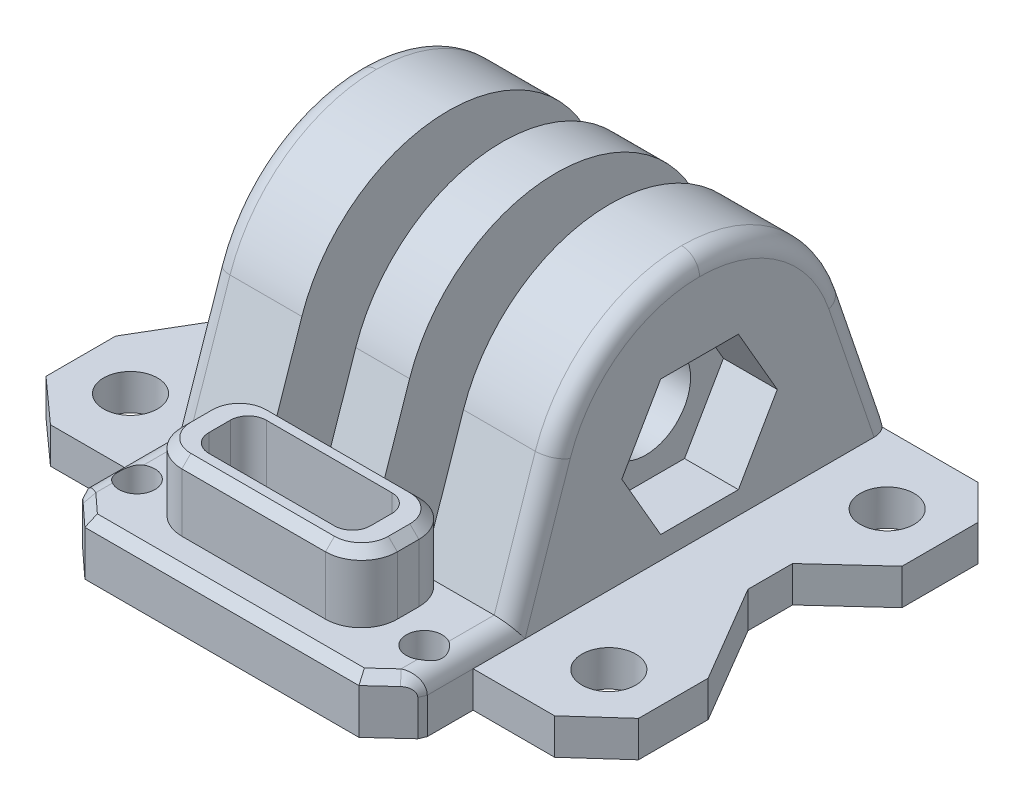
ISO-10303-21;
HEADER;
FILE_DESCRIPTION(('STEP AP214'),'2;1');
FILE_NAME('part.step','',(''),(''),'','','');
FILE_SCHEMA(('AUTOMOTIVE_DESIGN { 1 0 10303 214 1 1 1 1 }'));
ENDSEC;
DATA;
#1=APPLICATION_CONTEXT('core data for automotive mechanical design processes');
#2=APPLICATION_PROTOCOL_DEFINITION('international standard','automotive_design',2000,#1);
#3=PRODUCT_CONTEXT('',#1,'mechanical');
#4=PRODUCT('Part','Part','',(#3));
#5=PRODUCT_RELATED_PRODUCT_CATEGORY('part','',(#4));
#6=PRODUCT_DEFINITION_FORMATION('','',#4);
#7=PRODUCT_DEFINITION_CONTEXT('part definition',#1,'design');
#8=PRODUCT_DEFINITION('design','',#6,#7);
#9=PRODUCT_DEFINITION_SHAPE('','',#8);
#10=(LENGTH_UNIT() NAMED_UNIT(*) SI_UNIT(.MILLI.,.METRE.));
#11=(NAMED_UNIT(*) PLANE_ANGLE_UNIT() SI_UNIT($,.RADIAN.));
#12=(NAMED_UNIT(*) SI_UNIT($,.STERADIAN.) SOLID_ANGLE_UNIT());
#13=UNCERTAINTY_MEASURE_WITH_UNIT(LENGTH_MEASURE(1.E-05),#10,'distance_accuracy_value','');
#14=(GEOMETRIC_REPRESENTATION_CONTEXT(3) GLOBAL_UNCERTAINTY_ASSIGNED_CONTEXT((#13)) GLOBAL_UNIT_ASSIGNED_CONTEXT((#10,
#11,#12)) REPRESENTATION_CONTEXT('',''));
#15=CARTESIAN_POINT('',(0.,0.,0.));
#16=DIRECTION('',(0.,0.,1.));
#17=DIRECTION('',(1.,0.,0.));
#18=AXIS2_PLACEMENT_3D('',#15,#16,#17);
#19=CARTESIAN_POINT('',(0.,3.,0.));
#20=DIRECTION('',(0.,-1.,0.));
#21=DIRECTION('',(0.,0.,-1.));
#22=AXIS2_PLACEMENT_3D('',#19,#20,#21);
#23=PLANE('',#22);
#24=DIRECTION('',(1.,0.,0.));
#25=VECTOR('',#24,1.);
#26=CARTESIAN_POINT('',(1.5,3.,-12.0629078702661));
#27=LINE('',#26,#25);
#28=CARTESIAN_POINT('',(4.5,3.,-12.0629078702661));
#29=VERTEX_POINT('',#28);
#30=CARTESIAN_POINT('',(1.5,3.,-12.0629078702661));
#31=VERTEX_POINT('',#30);
#32=EDGE_CURVE('E737',#29,#31,#27,.F.);
#33=ORIENTED_EDGE('',*,*,#32,.F.);
#34=DIRECTION('',(0.,0.,-1.));
#35=VECTOR('',#34,1.);
#36=CARTESIAN_POINT('',(4.5,3.,1.93874468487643));
#37=LINE('',#36,#35);
#38=CARTESIAN_POINT('',(4.5,3.,-13.1404219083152));
#39=VERTEX_POINT('',#38);
#40=EDGE_CURVE('E749',#29,#39,#37,.T.);
#41=ORIENTED_EDGE('',*,*,#40,.T.);
#42=DIRECTION('',(1.,0.,0.));
#43=VECTOR('',#42,1.);
#44=CARTESIAN_POINT('',(24.8955379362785,3.,-13.1404219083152));
#45=LINE('',#44,#43);
#46=CARTESIAN_POINT('',(1.5,3.,-13.1404219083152));
#47=VERTEX_POINT('',#46);
#48=EDGE_CURVE('E761',#47,#39,#45,.T.);
#49=ORIENTED_EDGE('',*,*,#48,.F.);
#50=DIRECTION('',(0.,0.,1.));
#51=VECTOR('',#50,1.);
#52=CARTESIAN_POINT('',(1.5,3.,-11.6913393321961));
#53=LINE('',#52,#51);
#54=EDGE_CURVE('E751',#47,#31,#53,.T.);
#55=ORIENTED_EDGE('',*,*,#54,.T.);
#56=EDGE_LOOP('',(#33,#41,#49,#55));
#57=FACE_BOUND('',#56,.T.);
#58=ADVANCED_FACE('F51',(#57),#23,.F.);
#59=DIRECTION('',(1.,0.,0.));
#60=VECTOR('',#59,1.);
#61=CARTESIAN_POINT('',(1.5,3.,1.94039724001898));
#62=LINE('',#61,#60);
#63=CARTESIAN_POINT('',(1.5,3.,1.94039724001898));
#64=VERTEX_POINT('',#63);
#65=CARTESIAN_POINT('',(4.5,3.,1.94039724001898));
#66=VERTEX_POINT('',#65);
#67=EDGE_CURVE('E753',#64,#66,#62,.T.);
#68=ORIENTED_EDGE('',*,*,#67,.F.);
#69=CARTESIAN_POINT('',(1.5,3.,3.10274583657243));
#70=VERTEX_POINT('',#69);
#71=EDGE_CURVE('E777',#64,#70,#53,.T.);
#72=ORIENTED_EDGE('',*,*,#71,.T.);
#73=DIRECTION('',(-1.,0.,0.));
#74=VECTOR('',#73,1.);
#75=CARTESIAN_POINT('',(1.5,3.,3.10274583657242));
#76=LINE('',#75,#74);
#77=CARTESIAN_POINT('',(4.5,3.,3.10274583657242));
#78=VERTEX_POINT('',#77);
#79=EDGE_CURVE('E766',#78,#70,#76,.T.);
#80=ORIENTED_EDGE('',*,*,#79,.F.);
#81=EDGE_CURVE('E760',#78,#66,#37,.T.);
#82=ORIENTED_EDGE('',*,*,#81,.T.);
#83=EDGE_LOOP('',(#68,#72,#80,#82));
#84=FACE_BOUND('',#83,.T.);
#85=ADVANCED_FACE('F2271',(#84),#23,.F.);
#86=DIRECTION('',(1.,0.,0.));
#87=VECTOR('',#86,1.);
#88=CARTESIAN_POINT('',(-4.5,3.,-12.0629078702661));
#89=LINE('',#88,#87);
#90=CARTESIAN_POINT('',(-1.5,3.,-12.0629078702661));
#91=VERTEX_POINT('',#90);
#92=CARTESIAN_POINT('',(-4.5,3.,-12.0629078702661));
#93=VERTEX_POINT('',#92);
#94=EDGE_CURVE('E1136',#91,#93,#89,.F.);
#95=ORIENTED_EDGE('',*,*,#94,.F.);
#96=DIRECTION('',(0.,0.,-1.));
#97=VECTOR('',#96,1.);
#98=CARTESIAN_POINT('',(-1.5,3.,-11.6913393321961));
#99=LINE('',#98,#97);
#100=CARTESIAN_POINT('',(-1.5,3.,-13.1404219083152));
#101=VERTEX_POINT('',#100);
#102=EDGE_CURVE('E1289',#91,#101,#99,.T.);
#103=ORIENTED_EDGE('',*,*,#102,.T.);
#104=DIRECTION('',(-1.,0.,0.));
#105=VECTOR('',#104,1.);
#106=CARTESIAN_POINT('',(18.8955379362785,3.,-13.1404219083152));
#107=LINE('',#106,#105);
#108=CARTESIAN_POINT('',(-4.5,3.,-13.1404219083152));
#109=VERTEX_POINT('',#108);
#110=EDGE_CURVE('E789',#101,#109,#107,.T.);
#111=ORIENTED_EDGE('',*,*,#110,.T.);
#112=DIRECTION('',(0.,0.,1.));
#113=VECTOR('',#112,1.);
#114=CARTESIAN_POINT('',(-4.5,3.,1.93874468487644));
#115=LINE('',#114,#113);
#116=EDGE_CURVE('E782',#109,#93,#115,.T.);
#117=ORIENTED_EDGE('',*,*,#116,.T.);
#118=EDGE_LOOP('',(#95,#103,#111,#117));
#119=FACE_BOUND('',#118,.T.);
#120=ADVANCED_FACE('F1298',(#119),#23,.F.);
#121=DIRECTION('',(1.,0.,0.));
#122=VECTOR('',#121,1.);
#123=CARTESIAN_POINT('',(-4.5,3.,1.94039724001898));
#124=LINE('',#123,#122);
#125=CARTESIAN_POINT('',(-4.5,3.,1.94039724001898));
#126=VERTEX_POINT('',#125);
#127=CARTESIAN_POINT('',(-1.5,3.,1.94039724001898));
#128=VERTEX_POINT('',#127);
#129=EDGE_CURVE('E1133',#126,#128,#124,.T.);
#130=ORIENTED_EDGE('',*,*,#129,.F.);
#131=CARTESIAN_POINT('',(-4.5,3.,3.10274583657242));
#132=VERTEX_POINT('',#131);
#133=EDGE_CURVE('E1291',#126,#132,#115,.T.);
#134=ORIENTED_EDGE('',*,*,#133,.T.);
#135=DIRECTION('',(-1.,0.,0.));
#136=VECTOR('',#135,1.);
#137=CARTESIAN_POINT('',(-4.5,3.,3.10274583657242));
#138=LINE('',#137,#136);
#139=CARTESIAN_POINT('',(-1.5,3.,3.10274583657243));
#140=VERTEX_POINT('',#139);
#141=EDGE_CURVE('E3713',#140,#132,#138,.T.);
#142=ORIENTED_EDGE('',*,*,#141,.F.);
#143=EDGE_CURVE('E1290',#140,#128,#99,.T.);
#144=ORIENTED_EDGE('',*,*,#143,.T.);
#145=EDGE_LOOP('',(#130,#134,#142,#144));
#146=FACE_BOUND('',#145,.T.);
#147=ADVANCED_FACE('F2288',(#146),#23,.F.);
#148=CARTESIAN_POINT('',(16.5,10.,5.38258547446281));
#149=DIRECTION('',(1.,0.,0.));
#150=DIRECTION('',(0.,0.,-1.));
#151=AXIS2_PLACEMENT_3D('',#148,#149,#150);
#152=PLANE('',#151);
#153=DIRECTION('',(0.,1.,0.));
#154=VECTOR('',#153,1.);
#155=CARTESIAN_POINT('',(16.5,0.999975,1.45809229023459));
#156=LINE('',#155,#154);
#157=CARTESIAN_POINT('',(16.5,0.999999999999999,1.45809229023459));
#158=VERTEX_POINT('',#157);
#159=CARTESIAN_POINT('',(16.5,3.,1.45809229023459));
#160=VERTEX_POINT('',#159);
#161=EDGE_CURVE('E1138',#158,#160,#156,.T.);
#162=ORIENTED_EDGE('',*,*,#161,.T.);
#163=DIRECTION('',(0.,0.,-1.));
#164=VECTOR('',#163,1.);
#165=CARTESIAN_POINT('',(16.5,3.,0.));
#166=LINE('',#165,#164);
#167=CARTESIAN_POINT('',(16.5,3.,5.33746306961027));
#168=VERTEX_POINT('',#167);
#169=EDGE_CURVE('E1261',#168,#160,#166,.T.);
#170=ORIENTED_EDGE('',*,*,#169,.F.);
#171=DIRECTION('',(0.,1.,0.));
#172=VECTOR('',#171,1.);
#173=CARTESIAN_POINT('',(16.5,10.,5.33746306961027));
#174=LINE('',#173,#172);
#175=CARTESIAN_POINT('',(16.5,1.,5.33746306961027));
#176=VERTEX_POINT('',#175);
#177=EDGE_CURVE('E3002',#176,#168,#174,.T.);
#178=ORIENTED_EDGE('',*,*,#177,.F.);
#179=DIRECTION('',(0.,0.,1.));
#180=VECTOR('',#179,1.);
#181=CARTESIAN_POINT('',(16.5000000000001,1.,-13.5699999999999));
#182=LINE('',#181,#180);
#183=EDGE_CURVE('E1182',#158,#176,#182,.T.);
#184=ORIENTED_EDGE('',*,*,#183,.F.);
#185=EDGE_LOOP('',(#162,#170,#178,#184));
#186=FACE_BOUND('',#185,.T.);
#187=ADVANCED_FACE('F2676',(#186),#152,.T.);
#188=CARTESIAN_POINT('',(-16.5,10.,5.3825854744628));
#189=DIRECTION('',(-1.,0.,0.));
#190=DIRECTION('',(0.,0.,1.));
#191=AXIS2_PLACEMENT_3D('',#188,#189,#190);
#192=PLANE('',#191);
#193=DIRECTION('',(0.,1.,0.));
#194=VECTOR('',#193,1.);
#195=CARTESIAN_POINT('',(-16.5,0.999975,-9.33809229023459));
#196=LINE('',#195,#194);
#197=CARTESIAN_POINT('',(-16.5,0.999999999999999,-9.33809229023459));
#198=VERTEX_POINT('',#197);
#199=CARTESIAN_POINT('',(-16.5,3.,-9.33809229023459));
#200=VERTEX_POINT('',#199);
#201=EDGE_CURVE('E1148',#198,#200,#196,.T.);
#202=ORIENTED_EDGE('',*,*,#201,.T.);
#203=DIRECTION('',(0.,0.,1.));
#204=VECTOR('',#203,1.);
#205=CARTESIAN_POINT('',(-16.5,3.,0.));
#206=LINE('',#205,#204);
#207=CARTESIAN_POINT('',(-16.5,3.,-13.57));
#208=VERTEX_POINT('',#207);
#209=EDGE_CURVE('E1275',#208,#200,#206,.T.);
#210=ORIENTED_EDGE('',*,*,#209,.F.);
#211=DIRECTION('',(0.,1.,0.));
#212=VECTOR('',#211,1.);
#213=CARTESIAN_POINT('',(-16.5,2.,-13.57));
#214=LINE('',#213,#212);
#215=CARTESIAN_POINT('',(-16.5,1.,-13.57));
#216=VERTEX_POINT('',#215);
#217=EDGE_CURVE('E993',#216,#208,#214,.T.);
#218=ORIENTED_EDGE('',*,*,#217,.F.);
#219=DIRECTION('',(0.,0.,-1.));
#220=VECTOR('',#219,1.);
#221=CARTESIAN_POINT('',(-16.5,1.,5.33746306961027));
#222=LINE('',#221,#220);
#223=EDGE_CURVE('E1151',#198,#216,#222,.T.);
#224=ORIENTED_EDGE('',*,*,#223,.F.);
#225=EDGE_LOOP('',(#202,#210,#218,#224));
#226=FACE_BOUND('',#225,.T.);
#227=ADVANCED_FACE('F2162',(#226),#192,.T.);
#228=CARTESIAN_POINT('',(9.5,4.,-15.5));
#229=DIRECTION('',(-1.,0.,0.));
#230=DIRECTION('',(0.,1.,0.));
#231=AXIS2_PLACEMENT_3D('',#228,#229,#230);
#232=PLANE('',#231);
#233=DIRECTION('',(0.,0.,1.));
#234=VECTOR('',#233,1.);
#235=CARTESIAN_POINT('',(9.5,1.,7.55036174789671));
#236=LINE('',#235,#234);
#237=CARTESIAN_POINT('',(9.5,1.,7.55036174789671));
#238=VERTEX_POINT('',#237);
#239=CARTESIAN_POINT('',(9.5,1.,10.1024934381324));
#240=VERTEX_POINT('',#239);
#241=EDGE_CURVE('E1190',#238,#240,#236,.T.);
#242=ORIENTED_EDGE('',*,*,#241,.F.);
#243=DIRECTION('',(0.,1.,0.));
#244=VECTOR('',#243,1.);
#245=CARTESIAN_POINT('',(9.5,-8.,7.55036174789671));
#246=LINE('',#245,#244);
#247=CARTESIAN_POINT('',(9.5,3.,7.55036174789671));
#248=VERTEX_POINT('',#247);
#249=EDGE_CURVE('E3172',#238,#248,#246,.T.);
#250=ORIENTED_EDGE('',*,*,#249,.T.);
#251=DIRECTION('',(0.,0.,1.));
#252=VECTOR('',#251,1.);
#253=CARTESIAN_POINT('',(9.5,3.,11.54));
#254=LINE('',#253,#252);
#255=CARTESIAN_POINT('',(9.5,3.,10.1024934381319));
#256=VERTEX_POINT('',#255);
#257=EDGE_CURVE('E1351',#248,#256,#254,.T.);
#258=ORIENTED_EDGE('',*,*,#257,.T.);
#259=DIRECTION('',(0.,-1.,0.));
#260=VECTOR('',#259,1.);
#261=CARTESIAN_POINT('',(9.5,0.,10.1024934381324));
#262=LINE('',#261,#260);
#263=EDGE_CURVE('E1501',#256,#240,#262,.T.);
#264=ORIENTED_EDGE('',*,*,#263,.T.);
#265=EDGE_LOOP('',(#242,#250,#258,#264));
#266=FACE_BOUND('',#265,.T.);
#267=ADVANCED_FACE('F2010',(#266),#232,.F.);
#268=CARTESIAN_POINT('',(-9.5,4.,-15.5));
#269=DIRECTION('',(1.,0.,0.));
#270=DIRECTION('',(0.,0.,-1.));
#271=AXIS2_PLACEMENT_3D('',#268,#269,#270);
#272=PLANE('',#271);
#273=DIRECTION('',(0.,0.,-1.));
#274=VECTOR('',#273,1.);
#275=CARTESIAN_POINT('',(-9.5,1.,10.1024934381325));
#276=LINE('',#275,#274);
#277=CARTESIAN_POINT('',(-9.5,1.,10.1024934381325));
#278=VERTEX_POINT('',#277);
#279=CARTESIAN_POINT('',(-9.5,1.,7.5503617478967));
#280=VERTEX_POINT('',#279);
#281=EDGE_CURVE('E1202',#278,#280,#276,.T.);
#282=ORIENTED_EDGE('',*,*,#281,.F.);
#283=DIRECTION('',(0.,1.,0.));
#284=VECTOR('',#283,1.);
#285=CARTESIAN_POINT('',(-9.5,4.,10.1024934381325));
#286=LINE('',#285,#284);
#287=CARTESIAN_POINT('',(-9.5,3.,10.1024934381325));
#288=VERTEX_POINT('',#287);
#289=EDGE_CURVE('E1011',#278,#288,#286,.T.);
#290=ORIENTED_EDGE('',*,*,#289,.T.);
#291=DIRECTION('',(0.,0.,-1.));
#292=VECTOR('',#291,1.);
#293=CARTESIAN_POINT('',(-9.5,3.,3.80090776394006));
#294=LINE('',#293,#292);
#295=CARTESIAN_POINT('',(-9.5,3.,7.5503617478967));
#296=VERTEX_POINT('',#295);
#297=EDGE_CURVE('E1007',#288,#296,#294,.T.);
#298=ORIENTED_EDGE('',*,*,#297,.T.);
#299=DIRECTION('',(0.,1.,0.));
#300=VECTOR('',#299,1.);
#301=CARTESIAN_POINT('',(-9.5,-8.,7.5503617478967));
#302=LINE('',#301,#300);
#303=EDGE_CURVE('E1777',#280,#296,#302,.T.);
#304=ORIENTED_EDGE('',*,*,#303,.F.);
#305=EDGE_LOOP('',(#282,#290,#298,#304));
#306=FACE_BOUND('',#305,.T.);
#307=ADVANCED_FACE('F1934',(#306),#272,.F.);
#308=CARTESIAN_POINT('',(-9.,6.,12.04));
#309=DIRECTION('',(0.,0.,-1.));
#310=DIRECTION('',(-1.,0.,0.));
#311=AXIS2_PLACEMENT_3D('',#308,#309,#310);
#312=PLANE('',#311);
#313=DIRECTION('',(-1.,0.,0.));
#314=VECTOR('',#313,1.);
#315=CARTESIAN_POINT('',(7.63092706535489,1.,12.04));
#316=LINE('',#315,#314);
#317=CARTESIAN_POINT('',(7.63092706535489,1.,12.04));
#318=VERTEX_POINT('',#317);
#319=CARTESIAN_POINT('',(-7.63092706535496,1.,12.04));
#320=VERTEX_POINT('',#319);
#321=EDGE_CURVE('E1196',#318,#320,#316,.T.);
#322=ORIENTED_EDGE('',*,*,#321,.F.);
#323=DIRECTION('',(0.,-1.,0.));
#324=VECTOR('',#323,1.);
#325=CARTESIAN_POINT('',(7.63092706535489,6.,12.04));
#326=LINE('',#325,#324);
#327=CARTESIAN_POINT('',(7.63092706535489,3.5,12.04));
#328=VERTEX_POINT('',#327);
#329=EDGE_CURVE('E1385',#328,#318,#326,.T.);
#330=ORIENTED_EDGE('',*,*,#329,.F.);
#331=DIRECTION('',(-1.,0.,0.));
#332=VECTOR('',#331,1.);
#333=CARTESIAN_POINT('',(9.5,3.5,12.04));
#334=LINE('',#333,#332);
#335=CARTESIAN_POINT('',(-7.63092706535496,3.5,12.04));
#336=VERTEX_POINT('',#335);
#337=EDGE_CURVE('E1379',#328,#336,#334,.T.);
#338=ORIENTED_EDGE('',*,*,#337,.T.);
#339=DIRECTION('',(0.,-1.,0.));
#340=VECTOR('',#339,1.);
#341=CARTESIAN_POINT('',(-7.63092706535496,6.,12.04));
#342=LINE('',#341,#340);
#343=EDGE_CURVE('E1389',#336,#320,#342,.T.);
#344=ORIENTED_EDGE('',*,*,#343,.T.);
#345=EDGE_LOOP('',(#322,#330,#338,#344));
#346=FACE_BOUND('',#345,.T.);
#347=ADVANCED_FACE('F1485',(#346),#312,.F.);
#348=CARTESIAN_POINT('',(14.57,2.,-15.5));
#349=DIRECTION('',(0.707106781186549,0.,-0.707106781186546));
#350=DIRECTION('',(0.,1.,0.));
#351=AXIS2_PLACEMENT_3D('',#348,#349,#350);
#352=PLANE('',#351);
#353=DIRECTION('',(0.,-1.,0.));
#354=VECTOR('',#353,1.);
#355=CARTESIAN_POINT('',(16.5000000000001,2.,-13.5699999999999));
#356=LINE('',#355,#354);
#357=CARTESIAN_POINT('',(16.5000000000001,3.,-13.5699999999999));
#358=VERTEX_POINT('',#357);
#359=CARTESIAN_POINT('',(16.5000000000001,1.,-13.5699999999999));
#360=VERTEX_POINT('',#359);
#361=EDGE_CURVE('E1774',#358,#360,#356,.T.);
#362=ORIENTED_EDGE('',*,*,#361,.T.);
#363=DIRECTION('',(0.707106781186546,0.,0.707106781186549));
#364=VECTOR('',#363,1.);
#365=CARTESIAN_POINT('',(14.57,1.,-15.5));
#366=LINE('',#365,#364);
#367=CARTESIAN_POINT('',(14.57,1.,-15.5));
#368=VERTEX_POINT('',#367);
#369=EDGE_CURVE('E1180',#368,#360,#366,.T.);
#370=ORIENTED_EDGE('',*,*,#369,.F.);
#371=DIRECTION('',(0.,-1.,0.));
#372=VECTOR('',#371,1.);
#373=CARTESIAN_POINT('',(14.57,0.,-15.5));
#374=LINE('',#373,#372);
#375=CARTESIAN_POINT('',(14.57,3.,-15.5));
#376=VERTEX_POINT('',#375);
#377=EDGE_CURVE('E2995',#376,#368,#374,.T.);
#378=ORIENTED_EDGE('',*,*,#377,.F.);
#379=DIRECTION('',(-0.707106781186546,0.,-0.707106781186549));
#380=VECTOR('',#379,1.);
#381=CARTESIAN_POINT('',(15.035,3.,-15.035));
#382=LINE('',#381,#380);
#383=EDGE_CURVE('E1264',#358,#376,#382,.T.);
#384=ORIENTED_EDGE('',*,*,#383,.F.);
#385=EDGE_LOOP('',(#362,#370,#378,#384));
#386=FACE_BOUND('',#385,.T.);
#387=ADVANCED_FACE('F946',(#386),#352,.T.);
#388=CARTESIAN_POINT('',(-16.57,2.,-13.5));
#389=DIRECTION('',(-0.707106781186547,0.,-0.707106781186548));
#390=DIRECTION('',(0.,1.,0.));
#391=AXIS2_PLACEMENT_3D('',#388,#389,#390);
#392=PLANE('',#391);
#393=DIRECTION('',(0.,1.,0.));
#394=VECTOR('',#393,1.);
#395=CARTESIAN_POINT('',(-14.57,2.,-15.5));
#396=LINE('',#395,#394);
#397=CARTESIAN_POINT('',(-14.57,1.,-15.5));
#398=VERTEX_POINT('',#397);
#399=CARTESIAN_POINT('',(-14.57,3.,-15.5));
#400=VERTEX_POINT('',#399);
#401=EDGE_CURVE('E1770',#398,#400,#396,.T.);
#402=ORIENTED_EDGE('',*,*,#401,.F.);
#403=DIRECTION('',(0.707106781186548,0.,-0.707106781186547));
#404=VECTOR('',#403,1.);
#405=CARTESIAN_POINT('',(-16.5,1.,-13.57));
#406=LINE('',#405,#404);
#407=EDGE_CURVE('E1176',#216,#398,#406,.T.);
#408=ORIENTED_EDGE('',*,*,#407,.F.);
#409=ORIENTED_EDGE('',*,*,#217,.T.);
#410=DIRECTION('',(-0.707106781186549,0.,0.707106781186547));
#411=VECTOR('',#410,1.);
#412=CARTESIAN_POINT('',(-15.035,3.,-15.035));
#413=LINE('',#412,#411);
#414=EDGE_CURVE('E1270',#400,#208,#413,.T.);
#415=ORIENTED_EDGE('',*,*,#414,.F.);
#416=EDGE_LOOP('',(#402,#408,#409,#415));
#417=FACE_BOUND('',#416,.T.);
#418=ADVANCED_FACE('F1768',(#417),#392,.T.);
#419=CARTESIAN_POINT('',(3.5,-14.,7.07045388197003));
#420=DIRECTION('',(0.,-1.,0.));
#421=DIRECTION('',(0.,0.,-1.));
#422=AXIS2_PLACEMENT_3D('',#419,#420,#421);
#423=CYLINDRICAL_SURFACE('',#422,1.);
#424=CARTESIAN_POINT('',(3.5,0.999999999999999,7.07045388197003));
#425=DIRECTION('',(0.,-1.,0.));
#426=DIRECTION('',(0.,0.,-1.));
#427=AXIS2_PLACEMENT_3D('',#424,#425,#426);
#428=CIRCLE('',#427,1.);
#429=CARTESIAN_POINT('',(4.5,0.999999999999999,7.07045388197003));
#430=VERTEX_POINT('',#429);
#431=CARTESIAN_POINT('',(3.5,0.999999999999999,6.07045388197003));
#432=VERTEX_POINT('',#431);
#433=EDGE_CURVE('E1230',#430,#432,#428,.F.);
#434=ORIENTED_EDGE('',*,*,#433,.F.);
#435=DIRECTION('',(0.,-1.,0.));
#436=VECTOR('',#435,1.);
#437=CARTESIAN_POINT('',(4.5,0.,7.07045388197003));
#438=LINE('',#437,#436);
#439=CARTESIAN_POINT('',(4.5,7.75,7.07045388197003));
#440=VERTEX_POINT('',#439);
#441=EDGE_CURVE('E1802',#440,#430,#438,.T.);
#442=ORIENTED_EDGE('',*,*,#441,.F.);
#443=CARTESIAN_POINT('',(3.5,7.75,7.07045388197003));
#444=DIRECTION('',(0.,-1.,0.));
#445=DIRECTION('',(0.,0.,-1.));
#446=AXIS2_PLACEMENT_3D('',#443,#444,#445);
#447=CIRCLE('',#446,1.);
#448=CARTESIAN_POINT('',(3.5,7.75,6.07045388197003));
#449=VERTEX_POINT('',#448);
#450=EDGE_CURVE('E3154',#440,#449,#447,.F.);
#451=ORIENTED_EDGE('',*,*,#450,.T.);
#452=DIRECTION('',(0.,1.,0.));
#453=VECTOR('',#452,1.);
#454=CARTESIAN_POINT('',(3.5,9.,6.07045388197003));
#455=LINE('',#454,#453);
#456=EDGE_CURVE('E2094',#432,#449,#455,.T.);
#457=ORIENTED_EDGE('',*,*,#456,.F.);
#458=EDGE_LOOP('',(#434,#442,#451,#457));
#459=FACE_BOUND('',#458,.T.);
#460=ADVANCED_FACE('F2130',(#459),#423,.F.);
#461=CARTESIAN_POINT('',(3.5,-14.,8.27045388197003));
#462=DIRECTION('',(0.,-1.,0.));
#463=DIRECTION('',(0.,0.,-1.));
#464=AXIS2_PLACEMENT_3D('',#461,#462,#463);
#465=CYLINDRICAL_SURFACE('',#464,1.);
#466=CARTESIAN_POINT('',(3.5,0.999999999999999,8.27045388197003));
#467=DIRECTION('',(0.,-1.,0.));
#468=DIRECTION('',(0.,0.,-1.));
#469=AXIS2_PLACEMENT_3D('',#466,#467,#468);
#470=CIRCLE('',#469,1.);
#471=CARTESIAN_POINT('',(3.5,0.999999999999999,9.27045388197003));
#472=VERTEX_POINT('',#471);
#473=CARTESIAN_POINT('',(4.5,0.999999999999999,8.27045388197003));
#474=VERTEX_POINT('',#473);
#475=EDGE_CURVE('E1228',#472,#474,#470,.F.);
#476=ORIENTED_EDGE('',*,*,#475,.F.);
#477=DIRECTION('',(0.,-1.,0.));
#478=VECTOR('',#477,1.);
#479=CARTESIAN_POINT('',(3.5,0.,9.27045388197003));
#480=LINE('',#479,#478);
#481=CARTESIAN_POINT('',(3.5,7.75,9.27045388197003));
#482=VERTEX_POINT('',#481);
#483=EDGE_CURVE('E2067',#482,#472,#480,.T.);
#484=ORIENTED_EDGE('',*,*,#483,.F.);
#485=CARTESIAN_POINT('',(3.5,7.75,8.27045388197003));
#486=DIRECTION('',(0.,-1.,0.));
#487=DIRECTION('',(0.,0.,-1.));
#488=AXIS2_PLACEMENT_3D('',#485,#486,#487);
#489=CIRCLE('',#488,1.);
#490=CARTESIAN_POINT('',(4.5,7.75,8.27045388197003));
#491=VERTEX_POINT('',#490);
#492=EDGE_CURVE('E1454',#482,#491,#489,.F.);
#493=ORIENTED_EDGE('',*,*,#492,.T.);
#494=DIRECTION('',(0.,1.,0.));
#495=VECTOR('',#494,1.);
#496=CARTESIAN_POINT('',(4.5,9.,8.27045388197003));
#497=LINE('',#496,#495);
#498=EDGE_CURVE('E1799',#474,#491,#497,.T.);
#499=ORIENTED_EDGE('',*,*,#498,.F.);
#500=EDGE_LOOP('',(#476,#484,#493,#499));
#501=FACE_BOUND('',#500,.T.);
#502=ADVANCED_FACE('F2121',(#501),#465,.F.);
#503=CARTESIAN_POINT('',(-3.5,-14.,7.07045388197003));
#504=DIRECTION('',(0.,-1.,0.));
#505=DIRECTION('',(0.,0.,-1.));
#506=AXIS2_PLACEMENT_3D('',#503,#504,#505);
#507=CYLINDRICAL_SURFACE('',#506,1.);
#508=CARTESIAN_POINT('',(-3.5,0.999999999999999,7.07045388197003));
#509=DIRECTION('',(0.,-1.,0.));
#510=DIRECTION('',(0.,0.,-1.));
#511=AXIS2_PLACEMENT_3D('',#508,#509,#510);
#512=CIRCLE('',#511,1.);
#513=CARTESIAN_POINT('',(-3.5,0.999999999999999,6.07045388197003));
#514=VERTEX_POINT('',#513);
#515=CARTESIAN_POINT('',(-4.5,0.999999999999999,7.07045388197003));
#516=VERTEX_POINT('',#515);
#517=EDGE_CURVE('E1238',#514,#516,#512,.F.);
#518=ORIENTED_EDGE('',*,*,#517,.F.);
#519=DIRECTION('',(0.,-1.,0.));
#520=VECTOR('',#519,1.);
#521=CARTESIAN_POINT('',(-3.5,0.,6.07045388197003));
#522=LINE('',#521,#520);
#523=CARTESIAN_POINT('',(-3.5,7.75,6.07045388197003));
#524=VERTEX_POINT('',#523);
#525=EDGE_CURVE('E2082',#524,#514,#522,.T.);
#526=ORIENTED_EDGE('',*,*,#525,.F.);
#527=CARTESIAN_POINT('',(-3.5,7.75,7.07045388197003));
#528=DIRECTION('',(0.,-1.,0.));
#529=DIRECTION('',(0.,0.,-1.));
#530=AXIS2_PLACEMENT_3D('',#527,#528,#529);
#531=CIRCLE('',#530,1.);
#532=CARTESIAN_POINT('',(-4.5,7.75,7.07045388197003));
#533=VERTEX_POINT('',#532);
#534=EDGE_CURVE('E3166',#524,#533,#531,.F.);
#535=ORIENTED_EDGE('',*,*,#534,.T.);
#536=DIRECTION('',(0.,1.,0.));
#537=VECTOR('',#536,1.);
#538=CARTESIAN_POINT('',(-4.5,9.,7.07045388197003));
#539=LINE('',#538,#537);
#540=EDGE_CURVE('E2079',#516,#533,#539,.T.);
#541=ORIENTED_EDGE('',*,*,#540,.F.);
#542=EDGE_LOOP('',(#518,#526,#535,#541));
#543=FACE_BOUND('',#542,.T.);
#544=ADVANCED_FACE('F2111',(#543),#507,.F.);
#545=CARTESIAN_POINT('',(-3.5,-14.,8.27045388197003));
#546=DIRECTION('',(0.,-1.,0.));
#547=DIRECTION('',(0.,0.,-1.));
#548=AXIS2_PLACEMENT_3D('',#545,#546,#547);
#549=CYLINDRICAL_SURFACE('',#548,1.);
#550=CARTESIAN_POINT('',(-3.5,0.999999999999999,8.27045388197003));
#551=DIRECTION('',(0.,-1.,0.));
#552=DIRECTION('',(0.,0.,-1.));
#553=AXIS2_PLACEMENT_3D('',#550,#551,#552);
#554=CIRCLE('',#553,1.);
#555=CARTESIAN_POINT('',(-4.5,0.999999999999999,8.27045388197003));
#556=VERTEX_POINT('',#555);
#557=CARTESIAN_POINT('',(-3.5,0.999999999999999,9.27045388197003));
#558=VERTEX_POINT('',#557);
#559=EDGE_CURVE('E1236',#556,#558,#554,.F.);
#560=ORIENTED_EDGE('',*,*,#559,.F.);
#561=DIRECTION('',(0.,-1.,0.));
#562=VECTOR('',#561,1.);
#563=CARTESIAN_POINT('',(-4.5,0.,8.27045388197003));
#564=LINE('',#563,#562);
#565=CARTESIAN_POINT('',(-4.5,7.75,8.27045388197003));
#566=VERTEX_POINT('',#565);
#567=EDGE_CURVE('E2083',#566,#556,#564,.T.);
#568=ORIENTED_EDGE('',*,*,#567,.F.);
#569=CARTESIAN_POINT('',(-3.5,7.75,8.27045388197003));
#570=DIRECTION('',(0.,-1.,0.));
#571=DIRECTION('',(0.,0.,-1.));
#572=AXIS2_PLACEMENT_3D('',#569,#570,#571);
#573=CIRCLE('',#572,1.);
#574=CARTESIAN_POINT('',(-3.5,7.75,9.27045388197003));
#575=VERTEX_POINT('',#574);
#576=EDGE_CURVE('E3163',#566,#575,#573,.F.);
#577=ORIENTED_EDGE('',*,*,#576,.T.);
#578=DIRECTION('',(0.,1.,0.));
#579=VECTOR('',#578,1.);
#580=CARTESIAN_POINT('',(-3.5,9.,9.27045388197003));
#581=LINE('',#580,#579);
#582=EDGE_CURVE('E2064',#558,#575,#581,.T.);
#583=ORIENTED_EDGE('',*,*,#582,.F.);
#584=EDGE_LOOP('',(#560,#568,#577,#583));
#585=FACE_BOUND('',#584,.T.);
#586=ADVANCED_FACE('F2101',(#585),#549,.F.);
#587=CARTESIAN_POINT('',(-4.5,-14.,6.07045388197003));
#588=DIRECTION('',(0.,0.,-1.));
#589=DIRECTION('',(0.,-1.,0.));
#590=AXIS2_PLACEMENT_3D('',#587,#588,#589);
#591=PLANE('',#590);
#592=DIRECTION('',(-1.,0.,0.));
#593=VECTOR('',#592,1.);
#594=CARTESIAN_POINT('',(-4.5,0.999999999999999,6.07045388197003));
#595=LINE('',#594,#593);
#596=EDGE_CURVE('E1234',#432,#514,#595,.T.);
#597=ORIENTED_EDGE('',*,*,#596,.F.);
#598=ORIENTED_EDGE('',*,*,#456,.T.);
#599=DIRECTION('',(-1.,0.,0.));
#600=VECTOR('',#599,1.);
#601=CARTESIAN_POINT('',(-4.5,7.75,6.07045388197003));
#602=LINE('',#601,#600);
#603=EDGE_CURVE('E3160',#449,#524,#602,.T.);
#604=ORIENTED_EDGE('',*,*,#603,.T.);
#605=ORIENTED_EDGE('',*,*,#525,.T.);
#606=EDGE_LOOP('',(#597,#598,#604,#605));
#607=FACE_BOUND('',#606,.T.);
#608=ADVANCED_FACE('F2087',(#607),#591,.F.);
#609=CARTESIAN_POINT('',(-4.5,-14.,6.07045388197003));
#610=DIRECTION('',(-1.,0.,0.));
#611=DIRECTION('',(0.,1.,0.));
#612=AXIS2_PLACEMENT_3D('',#609,#610,#611);
#613=PLANE('',#612);
#614=DIRECTION('',(0.,0.,1.));
#615=VECTOR('',#614,1.);
#616=CARTESIAN_POINT('',(-4.5,0.999999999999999,6.07045388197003));
#617=LINE('',#616,#615);
#618=EDGE_CURVE('E1240',#516,#556,#617,.T.);
#619=ORIENTED_EDGE('',*,*,#618,.F.);
#620=ORIENTED_EDGE('',*,*,#540,.T.);
#621=DIRECTION('',(0.,0.,1.));
#622=VECTOR('',#621,1.);
#623=CARTESIAN_POINT('',(-4.5,7.75,6.07045388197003));
#624=LINE('',#623,#622);
#625=EDGE_CURVE('E3169',#533,#566,#624,.T.);
#626=ORIENTED_EDGE('',*,*,#625,.T.);
#627=ORIENTED_EDGE('',*,*,#567,.T.);
#628=EDGE_LOOP('',(#619,#620,#626,#627));
#629=FACE_BOUND('',#628,.T.);
#630=ADVANCED_FACE('F2071',(#629),#613,.F.);
#631=CARTESIAN_POINT('',(-4.5,-14.,9.27045388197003));
#632=DIRECTION('',(0.,0.,1.));
#633=DIRECTION('',(1.,0.,0.));
#634=AXIS2_PLACEMENT_3D('',#631,#632,#633);
#635=PLANE('',#634);
#636=DIRECTION('',(1.,0.,0.));
#637=VECTOR('',#636,1.);
#638=CARTESIAN_POINT('',(-4.5,0.999999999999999,9.27045388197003));
#639=LINE('',#638,#637);
#640=EDGE_CURVE('E1232',#558,#472,#639,.T.);
#641=ORIENTED_EDGE('',*,*,#640,.F.);
#642=ORIENTED_EDGE('',*,*,#582,.T.);
#643=DIRECTION('',(1.,0.,0.));
#644=VECTOR('',#643,1.);
#645=CARTESIAN_POINT('',(-4.5,7.75,9.27045388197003));
#646=LINE('',#645,#644);
#647=EDGE_CURVE('E3157',#575,#482,#646,.T.);
#648=ORIENTED_EDGE('',*,*,#647,.T.);
#649=ORIENTED_EDGE('',*,*,#483,.T.);
#650=EDGE_LOOP('',(#641,#642,#648,#649));
#651=FACE_BOUND('',#650,.T.);
#652=ADVANCED_FACE('F2056',(#651),#635,.F.);
#653=CARTESIAN_POINT('',(4.5,-14.,6.07045388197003));
#654=DIRECTION('',(1.,0.,0.));
#655=DIRECTION('',(0.,1.,0.));
#656=AXIS2_PLACEMENT_3D('',#653,#654,#655);
#657=PLANE('',#656);
#658=DIRECTION('',(0.,0.,-1.));
#659=VECTOR('',#658,1.);
#660=CARTESIAN_POINT('',(4.5,0.999999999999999,6.07045388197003));
#661=LINE('',#660,#659);
#662=EDGE_CURVE('E1226',#474,#430,#661,.T.);
#663=ORIENTED_EDGE('',*,*,#662,.F.);
#664=ORIENTED_EDGE('',*,*,#498,.T.);
#665=DIRECTION('',(0.,0.,-1.));
#666=VECTOR('',#665,1.);
#667=CARTESIAN_POINT('',(4.5,7.75,6.07045388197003));
#668=LINE('',#667,#666);
#669=EDGE_CURVE('E1392',#491,#440,#668,.T.);
#670=ORIENTED_EDGE('',*,*,#669,.T.);
#671=ORIENTED_EDGE('',*,*,#441,.T.);
#672=EDGE_LOOP('',(#663,#664,#670,#671));
#673=FACE_BOUND('',#672,.T.);
#674=ADVANCED_FACE('F2044',(#673),#657,.F.);
#675=CARTESIAN_POINT('',(-16.5,2.,-15.5));
#676=DIRECTION('',(0.,0.,1.));
#677=DIRECTION('',(1.,0.,0.));
#678=AXIS2_PLACEMENT_3D('',#675,#676,#677);
#679=PLANE('',#678);
#680=DIRECTION('',(1.,0.,0.));
#681=VECTOR('',#680,1.);
#682=CARTESIAN_POINT('',(-14.57,1.,-15.5));
#683=LINE('',#682,#681);
#684=EDGE_CURVE('E1178',#398,#368,#683,.T.);
#685=ORIENTED_EDGE('',*,*,#684,.F.);
#686=ORIENTED_EDGE('',*,*,#401,.T.);
#687=DIRECTION('',(-1.,0.,0.));
#688=VECTOR('',#687,1.);
#689=CARTESIAN_POINT('',(0.,3.,-15.5));
#690=LINE('',#689,#688);
#691=CARTESIAN_POINT('',(-9.23393165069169,3.,-15.5));
#692=VERTEX_POINT('',#691);
#693=EDGE_CURVE('E1267',#692,#400,#690,.T.);
#694=ORIENTED_EDGE('',*,*,#693,.F.);
#695=CARTESIAN_POINT('',(-11.0576619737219,-11.18640104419,-15.5));
#696=CARTESIAN_POINT('',(-10.5162913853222,-6.79093402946,-15.5));
#697=CARTESIAN_POINT('',(-9.97492079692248,-2.39546701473,-15.5));
#698=CARTESIAN_POINT('',(-9.43355020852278,2.,-15.5));
#699=CARTESIAN_POINT('',(-9.28023377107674,3.24479858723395,-15.5));
#700=CARTESIAN_POINT('',(-8.92772455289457,4.,-15.5));
#701=CARTESIAN_POINT('',(-8.5,4.,-15.5));
#702=(BOUNDED_CURVE() B_SPLINE_CURVE(3,(#695,#696,#697,#698,#699,#700,#701),.UNSPECIFIED.,.F.,
.F.) B_SPLINE_CURVE_WITH_KNOTS((4,3,4),(0.262220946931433,5.07899243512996,6.28318530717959),
.UNSPECIFIED.) CURVE() GEOMETRIC_REPRESENTATION_ITEM() RATIONAL_B_SPLINE_CURVE((1.,1.,1.,1.,
0.8827667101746,0.8827667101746,1.)) REPRESENTATION_ITEM(''));
#703=CARTESIAN_POINT('',(-8.5,4.,-15.5));
#704=VERTEX_POINT('',#703);
#705=EDGE_CURVE('E1363',#692,#704,#702,.T.);
#706=ORIENTED_EDGE('',*,*,#705,.T.);
#707=DIRECTION('',(1.,0.,0.));
#708=VECTOR('',#707,1.);
#709=CARTESIAN_POINT('',(0.,4.,-15.5));
#710=LINE('',#709,#708);
#711=CARTESIAN_POINT('',(-4.5,4.,-15.5));
#712=VERTEX_POINT('',#711);
#713=EDGE_CURVE('E1805',#704,#712,#710,.T.);
#714=ORIENTED_EDGE('',*,*,#713,.T.);
#715=DIRECTION('',(0.,-1.,0.));
#716=VECTOR('',#715,1.);
#717=CARTESIAN_POINT('',(-4.5,2.,-15.5));
#718=LINE('',#717,#716);
#719=CARTESIAN_POINT('',(-4.5,3.,-15.5));
#720=VERTEX_POINT('',#719);
#721=EDGE_CURVE('E1319',#712,#720,#718,.T.);
#722=ORIENTED_EDGE('',*,*,#721,.T.);
#723=CARTESIAN_POINT('',(-1.5,3.,-15.5));
#724=VERTEX_POINT('',#723);
#725=EDGE_CURVE('E1754',#724,#720,#690,.T.);
#726=ORIENTED_EDGE('',*,*,#725,.F.);
#727=DIRECTION('',(0.,1.,0.));
#728=VECTOR('',#727,1.);
#729=CARTESIAN_POINT('',(-1.5,2.,-15.5));
#730=LINE('',#729,#728);
#731=CARTESIAN_POINT('',(-1.5,4.,-15.5));
#732=VERTEX_POINT('',#731);
#733=EDGE_CURVE('E1316',#724,#732,#730,.T.);
#734=ORIENTED_EDGE('',*,*,#733,.T.);
#735=CARTESIAN_POINT('',(1.5,4.,-15.5));
#736=VERTEX_POINT('',#735);
#737=EDGE_CURVE('E1827',#732,#736,#710,.T.);
#738=ORIENTED_EDGE('',*,*,#737,.T.);
#739=DIRECTION('',(0.,-1.,0.));
#740=VECTOR('',#739,1.);
#741=CARTESIAN_POINT('',(1.5,2.,-15.5));
#742=LINE('',#741,#740);
#743=CARTESIAN_POINT('',(1.5,3.,-15.5));
#744=VERTEX_POINT('',#743);
#745=EDGE_CURVE('E1729',#736,#744,#742,.T.);
#746=ORIENTED_EDGE('',*,*,#745,.T.);
#747=CARTESIAN_POINT('',(4.5,3.,-15.5));
#748=VERTEX_POINT('',#747);
#749=EDGE_CURVE('E1271',#748,#744,#690,.T.);
#750=ORIENTED_EDGE('',*,*,#749,.F.);
#751=DIRECTION('',(0.,1.,0.));
#752=VECTOR('',#751,1.);
#753=CARTESIAN_POINT('',(4.5,2.,-15.5));
#754=LINE('',#753,#752);
#755=CARTESIAN_POINT('',(4.5,4.,-15.5));
#756=VERTEX_POINT('',#755);
#757=EDGE_CURVE('E1727',#748,#756,#754,.T.);
#758=ORIENTED_EDGE('',*,*,#757,.T.);
#759=CARTESIAN_POINT('',(8.5,4.,-15.5));
#760=VERTEX_POINT('',#759);
#761=EDGE_CURVE('E1367',#756,#760,#710,.T.);
#762=ORIENTED_EDGE('',*,*,#761,.T.);
#763=CARTESIAN_POINT('',(8.5,4.,-15.5));
#764=CARTESIAN_POINT('',(8.92772455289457,4.00000000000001,-15.5));
#765=CARTESIAN_POINT('',(9.28023377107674,3.24479858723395,-15.5));
#766=CARTESIAN_POINT('',(9.43355020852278,2.,-15.5));
#767=CARTESIAN_POINT('',(9.97492079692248,-2.39546701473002,-15.5));
#768=CARTESIAN_POINT('',(10.5162913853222,-6.79093402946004,-15.5));
#769=CARTESIAN_POINT('',(11.0576619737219,-11.1864010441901,-15.5));
#770=(BOUNDED_CURVE() B_SPLINE_CURVE(3,(#763,#764,#765,#766,#767,#768,#769),.UNSPECIFIED.,.F.,
.F.) B_SPLINE_CURVE_WITH_KNOTS((4,3,4),(0.,1.20419287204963,6.02096436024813),
.UNSPECIFIED.) CURVE() GEOMETRIC_REPRESENTATION_ITEM() RATIONAL_B_SPLINE_CURVE((1.,
0.8827667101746,0.8827667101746,1.,1.,1.,1.)) REPRESENTATION_ITEM(''));
#771=CARTESIAN_POINT('',(9.2339316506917,3.,-15.5));
#772=VERTEX_POINT('',#771);
#773=EDGE_CURVE('E1368',#760,#772,#770,.T.);
#774=ORIENTED_EDGE('',*,*,#773,.T.);
#775=EDGE_CURVE('E1268',#376,#772,#690,.T.);
#776=ORIENTED_EDGE('',*,*,#775,.F.);
#777=ORIENTED_EDGE('',*,*,#377,.T.);
#778=EDGE_LOOP('',(#685,#686,#694,#706,#714,#722,#726,#734,#738,#746,#750,#758,#762,#774,#776,#777));
#779=FACE_BOUND('',#778,.T.);
#780=ADVANCED_FACE('F1750',(#779),#679,.F.);
#781=CARTESIAN_POINT('',(8.,-1.,8.77045388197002));
#782=DIRECTION('',(0.,1.,0.));
#783=DIRECTION('',(0.,0.,1.));
#784=AXIS2_PLACEMENT_3D('',#781,#782,#783);
#785=CYLINDRICAL_SURFACE('',#784,1.);
#786=CARTESIAN_POINT('',(8.5,4.,9.63647928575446));
#787=CARTESIAN_POINT('',(8.54640051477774,4.00001815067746,9.60973856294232));
#788=CARTESIAN_POINT('',(8.59040467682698,3.99677727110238,9.57932242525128));
#789=CARTESIAN_POINT('',(8.67249187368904,3.98586884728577,9.51242147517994));
#790=CARTESIAN_POINT('',(8.71061000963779,3.97822894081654,9.47597555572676));
#791=CARTESIAN_POINT('',(8.78024273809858,3.96060151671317,9.39810812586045));
#792=CARTESIAN_POINT('',(8.81178539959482,3.95062438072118,9.3567090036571));
#793=CARTESIAN_POINT('',(8.86812569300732,3.93025863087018,9.26950918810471));
#794=CARTESIAN_POINT('',(8.8929077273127,3.91986912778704,9.22369864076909));
#795=CARTESIAN_POINT('',(8.93722092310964,3.89971657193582,9.12384069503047));
#796=CARTESIAN_POINT('',(8.95600714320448,3.89011267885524,9.06942551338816));
#797=CARTESIAN_POINT('',(8.98399703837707,3.87521791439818,8.95767544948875));
#798=CARTESIAN_POINT('',(8.99322046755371,3.86991815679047,8.90034684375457));
#799=CARTESIAN_POINT('',(9.00121346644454,3.86533441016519,8.78975416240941));
#800=CARTESIAN_POINT('',(9.00082376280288,3.8655665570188,8.7365710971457));
#801=CARTESIAN_POINT('',(8.99166522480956,3.87079907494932,8.63116728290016));
#802=CARTESIAN_POINT('',(8.9828932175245,3.87580125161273,8.57894690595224));
#803=CARTESIAN_POINT('',(8.95824974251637,3.88892295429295,8.48032313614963));
#804=CARTESIAN_POINT('',(8.94287552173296,3.8968193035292,8.4337621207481));
#805=CARTESIAN_POINT('',(8.90563738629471,3.91426485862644,8.34360125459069));
#806=CARTESIAN_POINT('',(8.883765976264,3.92381596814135,8.30000489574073));
#807=CARTESIAN_POINT('',(8.83055082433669,3.94427523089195,8.21077569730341));
#808=CARTESIAN_POINT('',(8.79832449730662,3.95519167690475,8.16566914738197));
#809=CARTESIAN_POINT('',(8.72660693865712,3.97469096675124,8.0811813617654));
#810=CARTESIAN_POINT('',(8.68713468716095,3.98327976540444,8.04178563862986));
#811=CARTESIAN_POINT('',(8.6220415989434,3.99278392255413,7.98691976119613));
#812=CARTESIAN_POINT('',(8.59873308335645,3.99540660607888,7.96896553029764));
#813=CARTESIAN_POINT('',(8.55051470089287,3.99901689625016,7.93510701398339));
#814=CARTESIAN_POINT('',(8.52560293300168,4.000002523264,7.91920523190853));
#815=CARTESIAN_POINT('',(8.5,4.,7.90442847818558));
#816=B_SPLINE_CURVE_WITH_KNOTS('',3,(#786,#787,#788,#789,#790,#791,#792,#793,#794,#795,#796,
#797,#798,#799,#800,#801,#802,#803,#804,#805,#806,#807,#808,#809,#810,#811,#812,#813,#814,#815),
.UNSPECIFIED.,.F.,.F.,(4,2,2,2,2,2,2,2,2,2,2,2,2,2,4),(0.,0.160051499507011,0.319108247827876,
0.477471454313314,0.636196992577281,0.810357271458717,0.984157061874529,1.14281558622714,
1.30153419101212,1.44996074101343,1.59855919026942,1.76731995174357,1.93564480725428,
2.02411641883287,2.11269493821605),.UNSPECIFIED.);
#817=CARTESIAN_POINT('',(8.5,4.,9.63647928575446));
#818=VERTEX_POINT('',#817);
#819=CARTESIAN_POINT('',(8.5,4.,7.90442847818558));
#820=VERTEX_POINT('',#819);
#821=EDGE_CURVE('E995',#818,#820,#816,.T.);
#822=ORIENTED_EDGE('',*,*,#821,.T.);
#823=CARTESIAN_POINT('',(8.,4.,8.77045388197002));
#824=DIRECTION('',(0.,1.,0.));
#825=DIRECTION('',(0.,0.,-1.));
#826=AXIS2_PLACEMENT_3D('',#823,#824,#825);
#827=CIRCLE('',#826,1.);
#828=EDGE_CURVE('E974',#820,#818,#827,.T.);
#829=ORIENTED_EDGE('',*,*,#828,.T.);
#830=EDGE_LOOP('',(#822,#829));
#831=FACE_BOUND('',#830,.T.);
#832=CARTESIAN_POINT('',(8.,1.,8.77045388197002));
#833=DIRECTION('',(0.,-1.,0.));
#834=DIRECTION('',(0.,0.,-1.));
#835=AXIS2_PLACEMENT_3D('',#832,#833,#834);
#836=CIRCLE('',#835,1.);
#837=CARTESIAN_POINT('',(8.,1.,7.77045388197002));
#838=VERTEX_POINT('',#837);
#839=EDGE_CURVE('E1223',#838,#838,#836,.F.);
#840=ORIENTED_EDGE('',*,*,#839,.F.);
#841=EDGE_LOOP('',(#840));
#842=FACE_BOUND('',#841,.T.);
#843=ADVANCED_FACE('F2021',(#831,#842),#785,.F.);
#844=CARTESIAN_POINT('',(-8.,-1.,8.77045388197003));
#845=DIRECTION('',(0.,1.,0.));
#846=DIRECTION('',(0.,0.,1.));
#847=AXIS2_PLACEMENT_3D('',#844,#845,#846);
#848=CYLINDRICAL_SURFACE('',#847,1.);
#849=CARTESIAN_POINT('',(-8.5,4.,7.90442847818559));
#850=CARTESIAN_POINT('',(-8.54640051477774,4.00001815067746,7.93116920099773));
#851=CARTESIAN_POINT('',(-8.59040467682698,3.99677727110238,7.96158533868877));
#852=CARTESIAN_POINT('',(-8.67249187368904,3.98586884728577,8.02848628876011));
#853=CARTESIAN_POINT('',(-8.71061000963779,3.97822894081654,8.06493220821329));
#854=CARTESIAN_POINT('',(-8.78024273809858,3.96060151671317,8.1427996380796));
#855=CARTESIAN_POINT('',(-8.81178539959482,3.95062438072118,8.18419876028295));
#856=CARTESIAN_POINT('',(-8.86812569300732,3.93025863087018,8.27139857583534));
#857=CARTESIAN_POINT('',(-8.8929077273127,3.91986912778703,8.31720912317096));
#858=CARTESIAN_POINT('',(-8.93722092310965,3.89971657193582,8.41706706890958));
#859=CARTESIAN_POINT('',(-8.95600714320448,3.89011267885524,8.47148225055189));
#860=CARTESIAN_POINT('',(-8.98399703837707,3.87521791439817,8.5832323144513));
#861=CARTESIAN_POINT('',(-8.99322046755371,3.86991815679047,8.64056092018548));
#862=CARTESIAN_POINT('',(-9.00121346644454,3.86533441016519,8.75115360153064));
#863=CARTESIAN_POINT('',(-9.00082376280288,3.8655665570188,8.80433666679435));
#864=CARTESIAN_POINT('',(-8.99166522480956,3.87079907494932,8.90974048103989));
#865=CARTESIAN_POINT('',(-8.9828932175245,3.87580125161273,8.96196085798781));
#866=CARTESIAN_POINT('',(-8.95824974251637,3.88892295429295,9.06058462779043));
#867=CARTESIAN_POINT('',(-8.94287552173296,3.8968193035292,9.10714564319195));
#868=CARTESIAN_POINT('',(-8.9056373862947,3.91426485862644,9.19730650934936));
#869=CARTESIAN_POINT('',(-8.883765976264,3.92381596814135,9.24090286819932));
#870=CARTESIAN_POINT('',(-8.83055082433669,3.94427523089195,9.33013206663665));
#871=CARTESIAN_POINT('',(-8.79832449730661,3.95519167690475,9.37523861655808));
#872=CARTESIAN_POINT('',(-8.72660693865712,3.97469096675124,9.45972640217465));
#873=CARTESIAN_POINT('',(-8.68713468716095,3.98327976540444,9.49912212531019));
#874=CARTESIAN_POINT('',(-8.6220415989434,3.99278392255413,9.55398800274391));
#875=CARTESIAN_POINT('',(-8.59873308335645,3.99540660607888,9.5719422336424));
#876=CARTESIAN_POINT('',(-8.55051470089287,3.99901689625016,9.60580074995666));
#877=CARTESIAN_POINT('',(-8.52560293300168,4.000002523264,9.62170253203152));
#878=CARTESIAN_POINT('',(-8.5,4.,9.63647928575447));
#879=B_SPLINE_CURVE_WITH_KNOTS('',3,(#849,#850,#851,#852,#853,#854,#855,#856,#857,#858,#859,
#860,#861,#862,#863,#864,#865,#866,#867,#868,#869,#870,#871,#872,#873,#874,#875,#876,#877,#878),
.UNSPECIFIED.,.F.,.F.,(4,2,2,2,2,2,2,2,2,2,2,2,2,2,4),(0.,0.160051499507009,0.319108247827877,
0.477471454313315,0.636196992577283,0.810357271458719,0.984157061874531,1.14281558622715,
1.30153419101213,1.44996074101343,1.59855919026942,1.76731995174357,1.93564480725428,
2.02411641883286,2.11269493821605),.UNSPECIFIED.);
#880=CARTESIAN_POINT('',(-8.5,4.,7.90442847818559));
#881=VERTEX_POINT('',#880);
#882=CARTESIAN_POINT('',(-8.5,4.,9.63647928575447));
#883=VERTEX_POINT('',#882);
#884=EDGE_CURVE('E950',#881,#883,#879,.T.);
#885=ORIENTED_EDGE('',*,*,#884,.T.);
#886=CARTESIAN_POINT('',(-8.,4.,8.77045388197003));
#887=DIRECTION('',(0.,1.,0.));
#888=DIRECTION('',(0.,0.,1.));
#889=AXIS2_PLACEMENT_3D('',#886,#887,#888);
#890=CIRCLE('',#889,1.);
#891=EDGE_CURVE('E989',#883,#881,#890,.T.);
#892=ORIENTED_EDGE('',*,*,#891,.T.);
#893=EDGE_LOOP('',(#885,#892));
#894=FACE_BOUND('',#893,.T.);
#895=CARTESIAN_POINT('',(-8.,1.,8.77045388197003));
#896=DIRECTION('',(0.,-1.,0.));
#897=DIRECTION('',(0.,0.,-1.));
#898=AXIS2_PLACEMENT_3D('',#895,#896,#897);
#899=CIRCLE('',#898,1.);
#900=CARTESIAN_POINT('',(-8.,1.,7.77045388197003));
#901=VERTEX_POINT('',#900);
#902=EDGE_CURVE('E1220',#901,#901,#899,.F.);
#903=ORIENTED_EDGE('',*,*,#902,.F.);
#904=EDGE_LOOP('',(#903));
#905=FACE_BOUND('',#904,.T.);
#906=ADVANCED_FACE('F2015',(#894,#905),#848,.F.);
#907=CARTESIAN_POINT('',(-13.32,0.,-11.69));
#908=DIRECTION('',(0.,1.,0.));
#909=DIRECTION('',(0.,0.,1.));
#910=AXIS2_PLACEMENT_3D('',#907,#908,#909);
#911=CYLINDRICAL_SURFACE('',#910,1.5);
#912=CARTESIAN_POINT('',(-13.32,3.,-11.69));
#913=DIRECTION('',(0.,1.,0.));
#914=DIRECTION('',(0.,0.,1.));
#915=AXIS2_PLACEMENT_3D('',#912,#913,#914);
#916=CIRCLE('',#915,1.5);
#917=CARTESIAN_POINT('',(-13.32,3.,-10.19));
#918=VERTEX_POINT('',#917);
#919=EDGE_CURVE('E1242',#918,#918,#916,.T.);
#920=ORIENTED_EDGE('',*,*,#919,.T.);
#921=EDGE_LOOP('',(#920));
#922=FACE_BOUND('',#921,.T.);
#923=CARTESIAN_POINT('',(-13.32,1.,-11.69));
#924=DIRECTION('',(0.,-1.,0.));
#925=DIRECTION('',(0.,0.,-1.));
#926=AXIS2_PLACEMENT_3D('',#923,#924,#925);
#927=CIRCLE('',#926,1.5);
#928=CARTESIAN_POINT('',(-13.32,1.,-13.19));
#929=VERTEX_POINT('',#928);
#930=EDGE_CURVE('E1217',#929,#929,#927,.F.);
#931=ORIENTED_EDGE('',*,*,#930,.F.);
#932=EDGE_LOOP('',(#931));
#933=FACE_BOUND('',#932,.T.);
#934=ADVANCED_FACE('F2020',(#922,#933),#911,.F.);
#935=CARTESIAN_POINT('',(-13.32,-1.99999999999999,3.81));
#936=DIRECTION('',(0.,1.,0.));
#937=DIRECTION('',(0.,0.,1.));
#938=AXIS2_PLACEMENT_3D('',#935,#936,#937);
#939=CYLINDRICAL_SURFACE('',#938,1.5);
#940=CARTESIAN_POINT('',(-13.32,3.,3.81));
#941=DIRECTION('',(0.,1.,0.));
#942=DIRECTION('',(0.,0.,1.));
#943=AXIS2_PLACEMENT_3D('',#940,#941,#942);
#944=CIRCLE('',#943,1.5);
#945=CARTESIAN_POINT('',(-13.32,3.,5.31));
#946=VERTEX_POINT('',#945);
#947=EDGE_CURVE('E1251',#946,#946,#944,.T.);
#948=ORIENTED_EDGE('',*,*,#947,.T.);
#949=EDGE_LOOP('',(#948));
#950=FACE_BOUND('',#949,.T.);
#951=CARTESIAN_POINT('',(-13.32,1.,3.81));
#952=DIRECTION('',(0.,-1.,0.));
#953=DIRECTION('',(0.,0.,-1.));
#954=AXIS2_PLACEMENT_3D('',#951,#952,#953);
#955=CIRCLE('',#954,1.5);
#956=CARTESIAN_POINT('',(-13.32,1.,2.31));
#957=VERTEX_POINT('',#956);
#958=EDGE_CURVE('E1214',#957,#957,#955,.F.);
#959=ORIENTED_EDGE('',*,*,#958,.F.);
#960=EDGE_LOOP('',(#959));
#961=FACE_BOUND('',#960,.T.);
#962=ADVANCED_FACE('F2907',(#950,#961),#939,.F.);
#963=CARTESIAN_POINT('',(13.32,-1.99999999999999,3.81));
#964=DIRECTION('',(0.,1.,0.));
#965=DIRECTION('',(0.,0.,1.));
#966=AXIS2_PLACEMENT_3D('',#963,#964,#965);
#967=CYLINDRICAL_SURFACE('',#966,1.5);
#968=CARTESIAN_POINT('',(13.32,3.,3.81));
#969=DIRECTION('',(0.,1.,0.));
#970=DIRECTION('',(0.,0.,1.));
#971=AXIS2_PLACEMENT_3D('',#968,#969,#970);
#972=CIRCLE('',#971,1.5);
#973=CARTESIAN_POINT('',(13.32,3.,5.31));
#974=VERTEX_POINT('',#973);
#975=EDGE_CURVE('E1248',#974,#974,#972,.T.);
#976=ORIENTED_EDGE('',*,*,#975,.T.);
#977=EDGE_LOOP('',(#976));
#978=FACE_BOUND('',#977,.T.);
#979=CARTESIAN_POINT('',(13.32,1.,3.81));
#980=DIRECTION('',(0.,-1.,0.));
#981=DIRECTION('',(0.,0.,-1.));
#982=AXIS2_PLACEMENT_3D('',#979,#980,#981);
#983=CIRCLE('',#982,1.5);
#984=CARTESIAN_POINT('',(13.32,1.,2.31));
#985=VERTEX_POINT('',#984);
#986=EDGE_CURVE('E1211',#985,#985,#983,.T.);
#987=ORIENTED_EDGE('',*,*,#986,.T.);
#988=EDGE_LOOP('',(#987));
#989=FACE_BOUND('',#988,.T.);
#990=ADVANCED_FACE('F2903',(#978,#989),#967,.F.);
#991=CARTESIAN_POINT('',(13.32,-1.99999999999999,-11.69));
#992=DIRECTION('',(0.,1.,0.));
#993=DIRECTION('',(0.,0.,1.));
#994=AXIS2_PLACEMENT_3D('',#991,#992,#993);
#995=CYLINDRICAL_SURFACE('',#994,1.5);
#996=CARTESIAN_POINT('',(13.32,3.,-11.69));
#997=DIRECTION('',(0.,1.,0.));
#998=DIRECTION('',(0.,0.,1.));
#999=AXIS2_PLACEMENT_3D('',#996,#997,#998);
#1000=CIRCLE('',#999,1.5);
#1001=CARTESIAN_POINT('',(13.32,3.,-10.19));
#1002=VERTEX_POINT('',#1001);
#1003=EDGE_CURVE('E1245',#1002,#1002,#1000,.T.);
#1004=ORIENTED_EDGE('',*,*,#1003,.T.);
#1005=EDGE_LOOP('',(#1004));
#1006=FACE_BOUND('',#1005,.T.);
#1007=CARTESIAN_POINT('',(13.32,1.,-11.69));
#1008=DIRECTION('',(0.,-1.,0.));
#1009=DIRECTION('',(0.,0.,-1.));
#1010=AXIS2_PLACEMENT_3D('',#1007,#1008,#1009);
#1011=CIRCLE('',#1010,1.5);
#1012=CARTESIAN_POINT('',(13.32,1.,-13.19));
#1013=VERTEX_POINT('',#1012);
#1014=EDGE_CURVE('E1208',#1013,#1013,#1011,.F.);
#1015=ORIENTED_EDGE('',*,*,#1014,.F.);
#1016=EDGE_LOOP('',(#1015));
#1017=FACE_BOUND('',#1016,.T.);
#1018=ADVANCED_FACE('F2774',(#1006,#1017),#995,.F.);
#1019=DIRECTION('',(0.,1.,0.));
#1020=VECTOR('',#1019,1.);
#1021=CARTESIAN_POINT('',(16.5,0.999975,-9.33809229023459));
#1022=LINE('',#1021,#1020);
#1023=CARTESIAN_POINT('',(16.5,0.999999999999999,-9.33809229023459));
#1024=VERTEX_POINT('',#1023);
#1025=CARTESIAN_POINT('',(16.5,3.,-9.33809229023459));
#1026=VERTEX_POINT('',#1025);
#1027=EDGE_CURVE('E1158',#1024,#1026,#1022,.T.);
#1028=ORIENTED_EDGE('',*,*,#1027,.F.);
#1029=EDGE_CURVE('E1183',#360,#1024,#182,.T.);
#1030=ORIENTED_EDGE('',*,*,#1029,.F.);
#1031=ORIENTED_EDGE('',*,*,#361,.F.);
#1032=EDGE_CURVE('E1260',#1026,#358,#166,.T.);
#1033=ORIENTED_EDGE('',*,*,#1032,.F.);
#1034=EDGE_LOOP('',(#1028,#1030,#1031,#1033));
#1035=FACE_BOUND('',#1034,.T.);
#1036=ADVANCED_FACE('F2738',(#1035),#152,.T.);
#1037=DIRECTION('',(0.,1.,0.));
#1038=VECTOR('',#1037,1.);
#1039=CARTESIAN_POINT('',(-16.5,0.999975,1.45809229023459));
#1040=LINE('',#1039,#1038);
#1041=CARTESIAN_POINT('',(-16.5,0.999999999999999,1.45809229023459));
#1042=VERTEX_POINT('',#1041);
#1043=CARTESIAN_POINT('',(-16.5,3.,1.45809229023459));
#1044=VERTEX_POINT('',#1043);
#1045=EDGE_CURVE('E1154',#1042,#1044,#1040,.T.);
#1046=ORIENTED_EDGE('',*,*,#1045,.F.);
#1047=CARTESIAN_POINT('',(-16.5,1.,5.33746306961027));
#1048=VERTEX_POINT('',#1047);
#1049=EDGE_CURVE('E1173',#1048,#1042,#222,.T.);
#1050=ORIENTED_EDGE('',*,*,#1049,.F.);
#1051=DIRECTION('',(0.,1.,0.));
#1052=VECTOR('',#1051,1.);
#1053=CARTESIAN_POINT('',(-16.5,10.,5.33746306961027));
#1054=LINE('',#1053,#1052);
#1055=CARTESIAN_POINT('',(-16.5,3.,5.33746306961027));
#1056=VERTEX_POINT('',#1055);
#1057=EDGE_CURVE('E2997',#1048,#1056,#1054,.T.);
#1058=ORIENTED_EDGE('',*,*,#1057,.T.);
#1059=EDGE_CURVE('E1274',#1044,#1056,#206,.T.);
#1060=ORIENTED_EDGE('',*,*,#1059,.F.);
#1061=EDGE_LOOP('',(#1046,#1050,#1058,#1060));
#1062=FACE_BOUND('',#1061,.T.);
#1063=ADVANCED_FACE('F2746',(#1062),#192,.T.);
#1064=CARTESIAN_POINT('',(-10.0297788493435,-8.,11.155015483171));
#1065=DIRECTION('',(-0.668606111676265,0.,0.743616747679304));
#1066=DIRECTION('',(0.743616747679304,0.,0.668606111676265));
#1067=AXIS2_PLACEMENT_3D('',#1064,#1065,#1066);
#1068=PLANE('',#1067);
#1069=ORIENTED_EDGE('',*,*,#1057,.F.);
#1070=DIRECTION('',(-0.743616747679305,0.,-0.668606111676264));
#1071=VECTOR('',#1070,1.);
#1072=CARTESIAN_POINT('',(-14.0388371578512,1.,7.5503617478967));
#1073=LINE('',#1072,#1071);
#1074=CARTESIAN_POINT('',(-14.0388371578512,1.,7.5503617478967));
#1075=VERTEX_POINT('',#1074);
#1076=EDGE_CURVE('E1206',#1075,#1048,#1073,.T.);
#1077=ORIENTED_EDGE('',*,*,#1076,.F.);
#1078=DIRECTION('',(0.,-1.,0.));
#1079=VECTOR('',#1078,1.);
#1080=CARTESIAN_POINT('',(-14.0388371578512,-8.,7.5503617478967));
#1081=LINE('',#1080,#1079);
#1082=CARTESIAN_POINT('',(-14.0388371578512,3.,7.5503617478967));
#1083=VERTEX_POINT('',#1082);
#1084=EDGE_CURVE('E3004',#1083,#1075,#1081,.T.);
#1085=ORIENTED_EDGE('',*,*,#1084,.F.);
#1086=DIRECTION('',(0.743616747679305,0.,0.668606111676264));
#1087=VECTOR('',#1086,1.);
#1088=CARTESIAN_POINT('',(-10.0297788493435,3.,11.155015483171));
#1089=LINE('',#1088,#1087);
#1090=EDGE_CURVE('E1278',#1056,#1083,#1089,.T.);
#1091=ORIENTED_EDGE('',*,*,#1090,.F.);
#1092=EDGE_LOOP('',(#1069,#1077,#1085,#1091));
#1093=FACE_BOUND('',#1092,.T.);
#1094=ADVANCED_FACE('F2781',(#1093),#1068,.T.);
#1095=CARTESIAN_POINT('',(10.0297788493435,-8.,11.155015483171));
#1096=DIRECTION('',(-0.668606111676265,0.,-0.743616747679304));
#1097=DIRECTION('',(-0.743616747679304,0.,0.668606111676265));
#1098=AXIS2_PLACEMENT_3D('',#1095,#1096,#1097);
#1099=PLANE('',#1098);
#1100=DIRECTION('',(-0.743616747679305,0.,0.668606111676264));
#1101=VECTOR('',#1100,1.);
#1102=CARTESIAN_POINT('',(16.5,1.,5.33746306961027));
#1103=LINE('',#1102,#1101);
#1104=CARTESIAN_POINT('',(14.0388371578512,1.,7.55036174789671));
#1105=VERTEX_POINT('',#1104);
#1106=EDGE_CURVE('E1186',#176,#1105,#1103,.T.);
#1107=ORIENTED_EDGE('',*,*,#1106,.F.);
#1108=ORIENTED_EDGE('',*,*,#177,.T.);
#1109=DIRECTION('',(0.743616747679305,0.,-0.668606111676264));
#1110=VECTOR('',#1109,1.);
#1111=CARTESIAN_POINT('',(10.0297788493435,3.,11.155015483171));
#1112=LINE('',#1111,#1110);
#1113=CARTESIAN_POINT('',(14.0388371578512,3.,7.55036174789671));
#1114=VERTEX_POINT('',#1113);
#1115=EDGE_CURVE('E1257',#1114,#168,#1112,.T.);
#1116=ORIENTED_EDGE('',*,*,#1115,.F.);
#1117=DIRECTION('',(0.,-1.,0.));
#1118=VECTOR('',#1117,1.);
#1119=CARTESIAN_POINT('',(14.0388371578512,-8.,7.55036174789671));
#1120=LINE('',#1119,#1118);
#1121=EDGE_CURVE('E3007',#1114,#1105,#1120,.T.);
#1122=ORIENTED_EDGE('',*,*,#1121,.T.);
#1123=EDGE_LOOP('',(#1107,#1108,#1116,#1122));
#1124=FACE_BOUND('',#1123,.T.);
#1125=ADVANCED_FACE('F2794',(#1124),#1099,.F.);
#1126=CARTESIAN_POINT('',(-14.0388371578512,-8.,7.5503617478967));
#1127=DIRECTION('',(0.,0.,-1.));
#1128=DIRECTION('',(-1.,0.,0.));
#1129=AXIS2_PLACEMENT_3D('',#1126,#1127,#1128);
#1130=PLANE('',#1129);
#1131=DIRECTION('',(-1.,0.,0.));
#1132=VECTOR('',#1131,1.);
#1133=CARTESIAN_POINT('',(-9.5,1.,7.5503617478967));
#1134=LINE('',#1133,#1132);
#1135=EDGE_CURVE('E1204',#280,#1075,#1134,.T.);
#1136=ORIENTED_EDGE('',*,*,#1135,.F.);
#1137=ORIENTED_EDGE('',*,*,#303,.T.);
#1138=DIRECTION('',(1.,0.,0.));
#1139=VECTOR('',#1138,1.);
#1140=CARTESIAN_POINT('',(0.,3.,7.5503617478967));
#1141=LINE('',#1140,#1139);
#1142=EDGE_CURVE('E1281',#1083,#296,#1141,.T.);
#1143=ORIENTED_EDGE('',*,*,#1142,.F.);
#1144=ORIENTED_EDGE('',*,*,#1084,.T.);
#1145=EDGE_LOOP('',(#1136,#1137,#1143,#1144));
#1146=FACE_BOUND('',#1145,.T.);
#1147=ADVANCED_FACE('F2807',(#1146),#1130,.F.);
#1148=CARTESIAN_POINT('',(14.0388371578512,-8.,7.55036174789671));
#1149=DIRECTION('',(0.,0.,-1.));
#1150=DIRECTION('',(-1.,0.,0.));
#1151=AXIS2_PLACEMENT_3D('',#1148,#1149,#1150);
#1152=PLANE('',#1151);
#1153=DIRECTION('',(-1.,0.,0.));
#1154=VECTOR('',#1153,1.);
#1155=CARTESIAN_POINT('',(14.0388371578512,1.,7.55036174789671));
#1156=LINE('',#1155,#1154);
#1157=EDGE_CURVE('E1188',#1105,#238,#1156,.T.);
#1158=ORIENTED_EDGE('',*,*,#1157,.F.);
#1159=ORIENTED_EDGE('',*,*,#1121,.F.);
#1160=DIRECTION('',(1.,0.,0.));
#1161=VECTOR('',#1160,1.);
#1162=CARTESIAN_POINT('',(0.,3.,7.55036174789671));
#1163=LINE('',#1162,#1161);
#1164=EDGE_CURVE('E1254',#248,#1114,#1163,.T.);
#1165=ORIENTED_EDGE('',*,*,#1164,.F.);
#1166=ORIENTED_EDGE('',*,*,#249,.F.);
#1167=EDGE_LOOP('',(#1158,#1159,#1165,#1166));
#1168=FACE_BOUND('',#1167,.T.);
#1169=ADVANCED_FACE('F1483',(#1168),#1152,.F.);
#1170=CARTESIAN_POINT('',(9.49322499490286,6.,10.328269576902));
#1171=DIRECTION('',(0.676717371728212,0.,0.736242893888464));
#1172=DIRECTION('',(0.736242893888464,0.,-0.676717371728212));
#1173=AXIS2_PLACEMENT_3D('',#1170,#1171,#1172);
#1174=PLANE('',#1173);
#1175=ORIENTED_EDGE('',*,*,#329,.T.);
#1176=DIRECTION('',(-0.736242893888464,0.,0.676717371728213));
#1177=VECTOR('',#1176,1.);
#1178=CARTESIAN_POINT('',(9.33835868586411,1.,10.4706148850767));
#1179=LINE('',#1178,#1177);
#1180=CARTESIAN_POINT('',(9.33835868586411,1.,10.4706148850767));
#1181=VERTEX_POINT('',#1180);
#1182=EDGE_CURVE('E1194',#1181,#318,#1179,.T.);
#1183=ORIENTED_EDGE('',*,*,#1182,.F.);
#1184=DIRECTION('',(0.,1.,0.));
#1185=VECTOR('',#1184,1.);
#1186=CARTESIAN_POINT('',(9.33835868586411,3.,10.4706148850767));
#1187=LINE('',#1186,#1185);
#1188=CARTESIAN_POINT('',(9.33835868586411,3.,10.4706148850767));
#1189=VERTEX_POINT('',#1188);
#1190=EDGE_CURVE('E1016',#1181,#1189,#1187,.T.);
#1191=ORIENTED_EDGE('',*,*,#1190,.T.);
#1192=CARTESIAN_POINT('',(8.8383586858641,3.50000000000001,10.9301896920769));
#1193=CARTESIAN_POINT('',(8.87108379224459,3.50000220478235,10.9001104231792));
#1194=CARTESIAN_POINT('',(8.90380754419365,3.49677699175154,10.8700323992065));
#1195=CARTESIAN_POINT('',(8.96800014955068,3.4840082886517,10.8110297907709));
#1196=CARTESIAN_POINT('',(8.99946634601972,3.47446312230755,10.7821076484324));
#1197=CARTESIAN_POINT('',(9.05993445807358,3.44941641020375,10.7265284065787));
#1198=CARTESIAN_POINT('',(9.08893387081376,3.43391590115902,10.6998736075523));
#1199=CARTESIAN_POINT('',(9.14335373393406,3.39755371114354,10.6498536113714));
#1200=CARTESIAN_POINT('',(9.1687719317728,3.37669353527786,10.6264904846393));
#1201=CARTESIAN_POINT('',(9.21505222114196,3.33041324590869,10.5839519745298));
#1202=CARTESIAN_POINT('',(9.23591239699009,3.30499504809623,10.564778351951));
#1203=CARTESIAN_POINT('',(9.27227458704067,3.25057518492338,10.5313560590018));
#1204=CARTESIAN_POINT('',(9.28777509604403,3.22157577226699,10.5171087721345));
#1205=CARTESIAN_POINT('',(9.31282180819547,3.16110766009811,10.4940870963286));
#1206=CARTESIAN_POINT('',(9.32236697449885,3.12964146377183,10.4853136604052));
#1207=CARTESIAN_POINT('',(9.3351356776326,3.0654488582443,10.4735773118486));
#1208=CARTESIAN_POINT('',(9.33836089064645,3.03272510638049,10.4706128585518));
#1209=CARTESIAN_POINT('',(9.33835868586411,3.,10.4706148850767));
#1210=B_SPLINE_CURVE_WITH_KNOTS('',3,(#1192,#1193,#1194,#1195,#1196,#1197,#1198,#1199,#1200,
#1201,#1202,#1203,#1204,#1205,#1206,#1207,#1208,#1209),.UNSPECIFIED.,.F.,.F.,(4,2,2,2,2,2,2,2,
4),(3.14159265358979,3.33794219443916,3.53429173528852,3.73064127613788,3.92699081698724,
4.12334035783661,4.31968989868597,4.51603943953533,4.71238898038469),.UNSPECIFIED.);
#1211=CARTESIAN_POINT('',(8.8383586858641,3.50000000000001,10.9301896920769));
#1212=VERTEX_POINT('',#1211);
#1213=EDGE_CURVE('E1500',#1189,#1212,#1210,.F.);
#1214=ORIENTED_EDGE('',*,*,#1213,.T.);
#1215=DIRECTION('',(-0.736242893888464,0.,0.676717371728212));
#1216=VECTOR('',#1215,1.);
#1217=CARTESIAN_POINT('',(9.49322499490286,3.50000000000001,10.328269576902));
#1218=LINE('',#1217,#1216);
#1219=EDGE_CURVE('E1493',#1212,#328,#1218,.T.);
#1220=ORIENTED_EDGE('',*,*,#1219,.T.);
#1221=EDGE_LOOP('',(#1175,#1183,#1191,#1214,#1220));
#1222=FACE_BOUND('',#1221,.T.);
#1223=ADVANCED_FACE('F1477',(#1222),#1174,.T.);
#1224=CARTESIAN_POINT('',(-9.49322499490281,6.,10.3282695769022));
#1225=DIRECTION('',(0.676717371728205,0.,-0.736242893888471));
#1226=DIRECTION('',(-0.736242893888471,0.,-0.676717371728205));
#1227=AXIS2_PLACEMENT_3D('',#1224,#1225,#1226);
#1228=PLANE('',#1227);
#1229=DIRECTION('',(-0.736242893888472,0.,-0.676717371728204));
#1230=VECTOR('',#1229,1.);
#1231=CARTESIAN_POINT('',(-7.63092706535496,1.,12.04));
#1232=LINE('',#1231,#1230);
#1233=CARTESIAN_POINT('',(-9.3383586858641,1.,10.4706148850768));
#1234=VERTEX_POINT('',#1233);
#1235=EDGE_CURVE('E1198',#320,#1234,#1232,.T.);
#1236=ORIENTED_EDGE('',*,*,#1235,.F.);
#1237=ORIENTED_EDGE('',*,*,#343,.F.);
#1238=DIRECTION('',(-0.736242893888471,0.,-0.676717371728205));
#1239=VECTOR('',#1238,1.);
#1240=CARTESIAN_POINT('',(-8.5,3.49999999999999,11.2411919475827));
#1241=LINE('',#1240,#1239);
#1242=CARTESIAN_POINT('',(-8.83835868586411,3.49999999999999,10.930189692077));
#1243=VERTEX_POINT('',#1242);
#1244=EDGE_CURVE('E1430',#336,#1243,#1241,.T.);
#1245=ORIENTED_EDGE('',*,*,#1244,.T.);
#1246=CARTESIAN_POINT('',(-9.3383586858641,3.,10.4706148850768));
#1247=CARTESIAN_POINT('',(-9.33836089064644,3.03272510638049,10.4706128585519));
#1248=CARTESIAN_POINT('',(-9.33513567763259,3.0654488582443,10.4735773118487));
#1249=CARTESIAN_POINT('',(-9.32236697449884,3.12964146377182,10.4853136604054));
#1250=CARTESIAN_POINT('',(-9.31282180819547,3.1611076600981,10.4940870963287));
#1251=CARTESIAN_POINT('',(-9.28777509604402,3.22157577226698,10.5171087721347));
#1252=CARTESIAN_POINT('',(-9.27227458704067,3.25057518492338,10.5313560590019));
#1253=CARTESIAN_POINT('',(-9.23591239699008,3.30499504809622,10.5647783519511));
#1254=CARTESIAN_POINT('',(-9.21505222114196,3.33041324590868,10.5839519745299));
#1255=CARTESIAN_POINT('',(-9.16877193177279,3.37669353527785,10.6264904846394));
#1256=CARTESIAN_POINT('',(-9.14335373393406,3.39755371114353,10.6498536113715));
#1257=CARTESIAN_POINT('',(-9.08893387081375,3.433915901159,10.6998736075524));
#1258=CARTESIAN_POINT('',(-9.05993445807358,3.44941641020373,10.7265284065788));
#1259=CARTESIAN_POINT('',(-8.99946634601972,3.47446312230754,10.7821076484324));
#1260=CARTESIAN_POINT('',(-8.96800014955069,3.48400828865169,10.811029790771));
#1261=CARTESIAN_POINT('',(-8.90380754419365,3.49677699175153,10.8700323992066));
#1262=CARTESIAN_POINT('',(-8.8710837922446,3.50000220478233,10.9001104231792));
#1263=CARTESIAN_POINT('',(-8.83835868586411,3.49999999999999,10.930189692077));
#1264=B_SPLINE_CURVE_WITH_KNOTS('',3,(#1246,#1247,#1248,#1249,#1250,#1251,#1252,#1253,#1254,
#1255,#1256,#1257,#1258,#1259,#1260,#1261,#1262,#1263),.UNSPECIFIED.,.F.,.F.,(4,2,2,2,2,2,2,2,
4),(0.,0.196349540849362,0.392699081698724,0.589048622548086,0.785398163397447,
0.981747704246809,1.17809724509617,1.37444678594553,1.57079632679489),.UNSPECIFIED.);
#1265=CARTESIAN_POINT('',(-9.3383586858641,3.,10.4706148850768));
#1266=VERTEX_POINT('',#1265);
#1267=EDGE_CURVE('E1459',#1243,#1266,#1264,.F.);
#1268=ORIENTED_EDGE('',*,*,#1267,.T.);
#1269=DIRECTION('',(0.,-1.,0.));
#1270=VECTOR('',#1269,1.);
#1271=CARTESIAN_POINT('',(-9.3383586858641,6.,10.4706148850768));
#1272=LINE('',#1271,#1270);
#1273=EDGE_CURVE('E1015',#1266,#1234,#1272,.T.);
#1274=ORIENTED_EDGE('',*,*,#1273,.T.);
#1275=EDGE_LOOP('',(#1236,#1237,#1245,#1268,#1274));
#1276=FACE_BOUND('',#1275,.T.);
#1277=ADVANCED_FACE('F1466',(#1276),#1228,.F.);
#1278=CARTESIAN_POINT('',(-9.3383586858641,6.,10.4706148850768));
#1279=DIRECTION('',(0.915619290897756,0.,-0.402046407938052));
#1280=DIRECTION('',(0.,-1.,0.));
#1281=AXIS2_PLACEMENT_3D('',#1278,#1279,#1280);
#1282=PLANE('',#1281);
#1283=ORIENTED_EDGE('',*,*,#289,.F.);
#1284=DIRECTION('',(-0.402046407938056,0.,-0.915619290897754));
#1285=VECTOR('',#1284,1.);
#1286=CARTESIAN_POINT('',(-9.3383586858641,1.,10.4706148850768));
#1287=LINE('',#1286,#1285);
#1288=EDGE_CURVE('E1200',#1234,#278,#1287,.T.);
#1289=ORIENTED_EDGE('',*,*,#1288,.F.);
#1290=ORIENTED_EDGE('',*,*,#1273,.F.);
#1291=CARTESIAN_POINT('',(-9.5,3.,10.1024934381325));
#1292=CARTESIAN_POINT('',(-9.3383586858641,3.,10.4706148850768));
#1293=B_SPLINE_CURVE_WITH_KNOTS('',1,(#1291,#1292),.UNSPECIFIED.,.F.,.F.,(2,2),(0.,1.),.UNSPECIFIED.);
#1294=EDGE_CURVE('E1526',#1266,#288,#1293,.F.);
#1295=ORIENTED_EDGE('',*,*,#1294,.T.);
#1296=EDGE_LOOP('',(#1283,#1289,#1290,#1295));
#1297=FACE_BOUND('',#1296,.T.);
#1298=ADVANCED_FACE('F1476',(#1297),#1282,.F.);
#1299=CARTESIAN_POINT('',(9.5,4.,10.1024934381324));
#1300=DIRECTION('',(0.915619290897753,0.,0.402046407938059));
#1301=DIRECTION('',(0.,1.,0.));
#1302=AXIS2_PLACEMENT_3D('',#1299,#1300,#1301);
#1303=PLANE('',#1302);
#1304=ORIENTED_EDGE('',*,*,#1190,.F.);
#1305=DIRECTION('',(-0.402046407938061,0.,0.915619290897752));
#1306=VECTOR('',#1305,1.);
#1307=CARTESIAN_POINT('',(9.5,1.,10.1024934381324));
#1308=LINE('',#1307,#1306);
#1309=EDGE_CURVE('E1192',#240,#1181,#1308,.T.);
#1310=ORIENTED_EDGE('',*,*,#1309,.F.);
#1311=ORIENTED_EDGE('',*,*,#263,.F.);
#1312=CARTESIAN_POINT('',(9.33835868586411,3.,10.4706148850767));
#1313=CARTESIAN_POINT('',(9.5,3.,10.1024934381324));
#1314=B_SPLINE_CURVE_WITH_KNOTS('',1,(#1312,#1313),.UNSPECIFIED.,.F.,.F.,(2,2),(0.,1.),.UNSPECIFIED.);
#1315=EDGE_CURVE('E1617',#256,#1189,#1314,.F.);
#1316=ORIENTED_EDGE('',*,*,#1315,.T.);
#1317=EDGE_LOOP('',(#1304,#1310,#1311,#1316));
#1318=FACE_BOUND('',#1317,.T.);
#1319=ADVANCED_FACE('F1547',(#1318),#1303,.T.);
#1320=CARTESIAN_POINT('',(24.8955379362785,2.,-10.7808438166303));
#1321=DIRECTION('',(0.,0.920726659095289,0.390208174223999));
#1322=DIRECTION('',(0.,-0.390208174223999,0.92072665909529));
#1323=AXIS2_PLACEMENT_3D('',#1320,#1321,#1322);
#1324=PLANE('',#1323);
#1325=DIRECTION('',(0.,0.390208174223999,-0.920726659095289));
#1326=VECTOR('',#1325,1.);
#1327=CARTESIAN_POINT('',(1.5,2.,-10.7808438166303));
#1328=LINE('',#1327,#1326);
#1329=CARTESIAN_POINT('',(1.5,3.58757638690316,-14.5268542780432));
#1330=VERTEX_POINT('',#1329);
#1331=EDGE_CURVE('E868',#47,#1330,#1328,.T.);
#1332=ORIENTED_EDGE('',*,*,#1331,.F.);
#1333=ORIENTED_EDGE('',*,*,#48,.T.);
#1334=DIRECTION('',(0.,0.390208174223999,-0.92072665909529));
#1335=VECTOR('',#1334,1.);
#1336=CARTESIAN_POINT('',(4.5,2.,-10.7808438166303));
#1337=LINE('',#1336,#1335);
#1338=CARTESIAN_POINT('',(4.5,3.58757638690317,-14.5268542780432));
#1339=VERTEX_POINT('',#1338);
#1340=EDGE_CURVE('E759',#39,#1339,#1337,.T.);
#1341=ORIENTED_EDGE('',*,*,#1340,.T.);
#1342=DIRECTION('',(-1.,0.,0.));
#1343=VECTOR('',#1342,1.);
#1344=CARTESIAN_POINT('',(1.5,3.58757638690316,-14.5268542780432));
#1345=LINE('',#1344,#1343);
#1346=EDGE_CURVE('E1724',#1339,#1330,#1345,.T.);
#1347=ORIENTED_EDGE('',*,*,#1346,.T.);
#1348=EDGE_LOOP('',(#1332,#1333,#1341,#1347));
#1349=FACE_BOUND('',#1348,.T.);
#1350=ADVANCED_FACE('F1635',(#1349),#1324,.T.);
#1351=CARTESIAN_POINT('',(1.5,2.,0.828002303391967));
#1352=DIRECTION('',(0.,0.915446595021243,-0.40243947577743));
#1353=DIRECTION('',(0.,0.40243947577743,0.915446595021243));
#1354=AXIS2_PLACEMENT_3D('',#1351,#1352,#1353);
#1355=PLANE('',#1354);
#1356=DIRECTION('',(0.,0.40243947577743,0.915446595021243));
#1357=VECTOR('',#1356,1.);
#1358=CARTESIAN_POINT('',(4.5,2.,0.828002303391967));
#1359=LINE('',#1358,#1357);
#1360=CARTESIAN_POINT('',(4.5,4.,5.37748936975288));
#1361=VERTEX_POINT('',#1360);
#1362=EDGE_CURVE('E796',#78,#1361,#1359,.T.);
#1363=ORIENTED_EDGE('',*,*,#1362,.F.);
#1364=ORIENTED_EDGE('',*,*,#79,.T.);
#1365=DIRECTION('',(0.,0.40243947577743,0.915446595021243));
#1366=VECTOR('',#1365,1.);
#1367=CARTESIAN_POINT('',(1.5,2.,0.828002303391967));
#1368=LINE('',#1367,#1366);
#1369=CARTESIAN_POINT('',(1.5,4.,5.37748936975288));
#1370=VERTEX_POINT('',#1369);
#1371=EDGE_CURVE('E797',#70,#1370,#1368,.T.);
#1372=ORIENTED_EDGE('',*,*,#1371,.T.);
#1373=DIRECTION('',(1.,0.,0.));
#1374=VECTOR('',#1373,1.);
#1375=CARTESIAN_POINT('',(1.5,4.,5.37748936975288));
#1376=LINE('',#1375,#1374);
#1377=EDGE_CURVE('E802',#1370,#1361,#1376,.T.);
#1378=ORIENTED_EDGE('',*,*,#1377,.T.);
#1379=EDGE_LOOP('',(#1363,#1364,#1372,#1378));
#1380=FACE_BOUND('',#1379,.T.);
#1381=ADVANCED_FACE('F2303',(#1380),#1355,.T.);
#1382=CARTESIAN_POINT('',(18.8955379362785,-1.96078135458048,-1.43507090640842));
#1383=DIRECTION('',(0.,-0.920726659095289,-0.390208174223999));
#1384=DIRECTION('',(0.,0.390208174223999,-0.92072665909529));
#1385=AXIS2_PLACEMENT_3D('',#1382,#1383,#1384);
#1386=PLANE('',#1385);
#1387=ORIENTED_EDGE('',*,*,#110,.F.);
#1388=DIRECTION('',(0.,-0.390208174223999,0.92072665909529));
#1389=VECTOR('',#1388,1.);
#1390=CARTESIAN_POINT('',(-1.5,-1.96078135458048,-1.43507090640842));
#1391=LINE('',#1390,#1389);
#1392=CARTESIAN_POINT('',(-1.5,3.58757638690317,-14.5268542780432));
#1393=VERTEX_POINT('',#1392);
#1394=EDGE_CURVE('E874',#1393,#101,#1391,.T.);
#1395=ORIENTED_EDGE('',*,*,#1394,.F.);
#1396=DIRECTION('',(-1.,0.,0.));
#1397=VECTOR('',#1396,1.);
#1398=CARTESIAN_POINT('',(18.8955379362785,3.58757638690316,-14.5268542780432));
#1399=LINE('',#1398,#1397);
#1400=CARTESIAN_POINT('',(-4.5,3.58757638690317,-14.5268542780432));
#1401=VERTEX_POINT('',#1400);
#1402=EDGE_CURVE('E1313',#1393,#1401,#1399,.T.);
#1403=ORIENTED_EDGE('',*,*,#1402,.T.);
#1404=DIRECTION('',(0.,-0.390208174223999,0.92072665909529));
#1405=VECTOR('',#1404,1.);
#1406=CARTESIAN_POINT('',(-4.5,-1.96078135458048,-1.43507090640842));
#1407=LINE('',#1406,#1405);
#1408=EDGE_CURVE('E871',#1401,#109,#1407,.T.);
#1409=ORIENTED_EDGE('',*,*,#1408,.T.);
#1410=EDGE_LOOP('',(#1387,#1395,#1403,#1409));
#1411=FACE_BOUND('',#1410,.T.);
#1412=ADVANCED_FACE('F913',(#1411),#1386,.F.);
#1413=CARTESIAN_POINT('',(-4.5,2.,0.828002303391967));
#1414=DIRECTION('',(0.,0.915446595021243,-0.40243947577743));
#1415=DIRECTION('',(0.,0.40243947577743,0.915446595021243));
#1416=AXIS2_PLACEMENT_3D('',#1413,#1414,#1415);
#1417=PLANE('',#1416);
#1418=DIRECTION('',(0.,0.40243947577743,0.915446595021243));
#1419=VECTOR('',#1418,1.);
#1420=CARTESIAN_POINT('',(-1.5,2.,0.828002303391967));
#1421=LINE('',#1420,#1419);
#1422=CARTESIAN_POINT('',(-1.5,4.,5.37748936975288));
#1423=VERTEX_POINT('',#1422);
#1424=EDGE_CURVE('E813',#140,#1423,#1421,.T.);
#1425=ORIENTED_EDGE('',*,*,#1424,.F.);
#1426=ORIENTED_EDGE('',*,*,#141,.T.);
#1427=DIRECTION('',(0.,0.40243947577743,0.915446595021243));
#1428=VECTOR('',#1427,1.);
#1429=CARTESIAN_POINT('',(-4.5,2.,0.828002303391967));
#1430=LINE('',#1429,#1428);
#1431=CARTESIAN_POINT('',(-4.5,4.,5.37748936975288));
#1432=VERTEX_POINT('',#1431);
#1433=EDGE_CURVE('E814',#132,#1432,#1430,.T.);
#1434=ORIENTED_EDGE('',*,*,#1433,.T.);
#1435=DIRECTION('',(1.,0.,0.));
#1436=VECTOR('',#1435,1.);
#1437=CARTESIAN_POINT('',(-4.5,4.,5.37748936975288));
#1438=LINE('',#1437,#1436);
#1439=EDGE_CURVE('E819',#1432,#1423,#1438,.T.);
#1440=ORIENTED_EDGE('',*,*,#1439,.T.);
#1441=EDGE_LOOP('',(#1425,#1426,#1434,#1440));
#1442=FACE_BOUND('',#1441,.T.);
#1443=ADVANCED_FACE('F2007',(#1442),#1417,.T.);
#1444=DIRECTION('',(0.,-0.86602540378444,0.499999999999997));
#1445=VECTOR('',#1444,1.);
#1446=CARTESIAN_POINT('',(9.5,11.7503670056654,-2.89619180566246));
#1447=LINE('',#1446,#1445);
#1448=CARTESIAN_POINT('',(9.5,11.7503670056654,-2.89619180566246));
#1449=VERTEX_POINT('',#1448);
#1450=CARTESIAN_POINT('',(9.5,8.00036700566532,-0.731128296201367));
#1451=VERTEX_POINT('',#1450);
#1452=EDGE_CURVE('E3110',#1449,#1451,#1447,.T.);
#1453=ORIENTED_EDGE('',*,*,#1452,.F.);
#1454=DIRECTION('',(0.,0.,1.));
#1455=VECTOR('',#1454,1.);
#1456=CARTESIAN_POINT('',(9.5,11.7503670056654,-7.22631882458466));
#1457=LINE('',#1456,#1455);
#1458=CARTESIAN_POINT('',(9.5,11.7503670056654,-7.22631882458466));
#1459=VERTEX_POINT('',#1458);
#1460=EDGE_CURVE('E3088',#1459,#1449,#1457,.T.);
#1461=ORIENTED_EDGE('',*,*,#1460,.F.);
#1462=DIRECTION('',(0.,0.86602540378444,0.499999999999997));
#1463=VECTOR('',#1462,1.);
#1464=CARTESIAN_POINT('',(9.5,8.00036700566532,-9.39138233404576));
#1465=LINE('',#1464,#1463);
#1466=CARTESIAN_POINT('',(9.5,8.00036700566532,-9.39138233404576));
#1467=VERTEX_POINT('',#1466);
#1468=EDGE_CURVE('E3093',#1467,#1459,#1465,.T.);
#1469=ORIENTED_EDGE('',*,*,#1468,.F.);
#1470=DIRECTION('',(0.,0.866025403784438,-0.5));
#1471=VECTOR('',#1470,1.);
#1472=CARTESIAN_POINT('',(9.5,4.25036700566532,-7.22631882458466));
#1473=LINE('',#1472,#1471);
#1474=CARTESIAN_POINT('',(9.5,4.25036700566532,-7.22631882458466));
#1475=VERTEX_POINT('',#1474);
#1476=EDGE_CURVE('E3119',#1475,#1467,#1473,.T.);
#1477=ORIENTED_EDGE('',*,*,#1476,.F.);
#1478=DIRECTION('',(0.,0.,-1.));
#1479=VECTOR('',#1478,1.);
#1480=CARTESIAN_POINT('',(9.5,4.25036700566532,-2.89619180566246));
#1481=LINE('',#1480,#1479);
#1482=CARTESIAN_POINT('',(9.5,4.25036700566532,-2.89619180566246));
#1483=VERTEX_POINT('',#1482);
#1484=EDGE_CURVE('E3116',#1483,#1475,#1481,.T.);
#1485=ORIENTED_EDGE('',*,*,#1484,.F.);
#1486=DIRECTION('',(0.,-0.866025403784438,-0.5));
#1487=VECTOR('',#1486,1.);
#1488=CARTESIAN_POINT('',(9.5,8.00036700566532,-0.731128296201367));
#1489=LINE('',#1488,#1487);
#1490=EDGE_CURVE('E3113',#1451,#1483,#1489,.T.);
#1491=ORIENTED_EDGE('',*,*,#1490,.F.);
#1492=EDGE_LOOP('',(#1453,#1461,#1469,#1477,#1485,#1491));
#1493=FACE_BOUND('',#1492,.T.);
#1494=DIRECTION('',(0.,0.,1.));
#1495=VECTOR('',#1494,1.);
#1496=CARTESIAN_POINT('',(9.5,3.,-15.5));
#1497=LINE('',#1496,#1495);
#1498=CARTESIAN_POINT('',(9.5,3.,-14.7828803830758));
#1499=VERTEX_POINT('',#1498);
#1500=CARTESIAN_POINT('',(9.5,3.,4.66036975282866));
#1501=VERTEX_POINT('',#1500);
#1502=EDGE_CURVE('E794',#1499,#1501,#1497,.T.);
#1503=ORIENTED_EDGE('',*,*,#1502,.F.);
#1504=DIRECTION('',(0.,0.947154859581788,0.32077666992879));
#1505=VECTOR('',#1504,1.);
#1506=CARTESIAN_POINT('',(9.5,14.9250270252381,-10.7441844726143));
#1507=LINE('',#1506,#1505);
#1508=CARTESIAN_POINT('',(9.5,10.4395153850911,-12.2633103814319));
#1509=VERTEX_POINT('',#1508);
#1510=EDGE_CURVE('E1362',#1499,#1509,#1507,.T.);
#1511=ORIENTED_EDGE('',*,*,#1510,.T.);
#1512=CARTESIAN_POINT('',(9.5,8.00036700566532,-5.06125531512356));
#1513=DIRECTION('',(-1.,0.,0.));
#1514=DIRECTION('',(0.,0.,1.));
#1515=AXIS2_PLACEMENT_3D('',#1512,#1513,#1514);
#1516=CIRCLE('',#1515,7.60388334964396);
#1517=CARTESIAN_POINT('',(9.5,15.6042503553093,-5.06125531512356));
#1518=VERTEX_POINT('',#1517);
#1519=EDGE_CURVE('E1721',#1509,#1518,#1516,.F.);
#1520=ORIENTED_EDGE('',*,*,#1519,.T.);
#1521=CARTESIAN_POINT('',(9.5,8.00036700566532,-5.06125531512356));
#1522=DIRECTION('',(-1.,0.,0.));
#1523=DIRECTION('',(0.,0.,1.));
#1524=AXIS2_PLACEMENT_3D('',#1521,#1522,#1523);
#1525=CIRCLE('',#1524,7.60388334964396);
#1526=CARTESIAN_POINT('',(9.5,10.4395153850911,2.14079975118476));
#1527=VERTEX_POINT('',#1526);
#1528=EDGE_CURVE('E1345',#1518,#1527,#1525,.F.);
#1529=ORIENTED_EDGE('',*,*,#1528,.T.);
#1530=DIRECTION('',(0.,-0.947154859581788,0.32077666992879));
#1531=VECTOR('',#1530,1.);
#1532=CARTESIAN_POINT('',(9.5,10.0223303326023,2.2820894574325));
#1533=LINE('',#1532,#1531);
#1534=EDGE_CURVE('E3024',#1527,#1501,#1533,.T.);
#1535=ORIENTED_EDGE('',*,*,#1534,.T.);
#1536=EDGE_LOOP('',(#1503,#1511,#1520,#1529,#1535));
#1537=FACE_BOUND('',#1536,.T.);
#1538=ADVANCED_FACE('F934',(#1493,#1537),#232,.F.);
#1539=CARTESIAN_POINT('',(-8.5,3.67922333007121,-14.5528451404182));
#1540=DIRECTION('',(0.,0.947154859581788,0.32077666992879));
#1541=DIRECTION('',(0.,-0.32077666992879,0.947154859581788));
#1542=AXIS2_PLACEMENT_3D('',#1539,#1540,#1541);
#1543=CYLINDRICAL_SURFACE('',#1542,1.);
#1544=ORIENTED_EDGE('',*,*,#705,.F.);
#1545=CARTESIAN_POINT('',(-8.5,3.,-14.7828803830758));
#1546=DIRECTION('',(0.,-1.,0.));
#1547=DIRECTION('',(0.,0.,1.));
#1548=AXIS2_PLACEMENT_3D('',#1545,#1546,#1547);
#1549=ELLIPSE('',#1548,1.05579355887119,1.);
#1550=CARTESIAN_POINT('',(-9.5,3.,-14.7828803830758));
#1551=VERTEX_POINT('',#1550);
#1552=EDGE_CURVE('E1764',#692,#1551,#1549,.F.);
#1553=ORIENTED_EDGE('',*,*,#1552,.T.);
#1554=DIRECTION('',(0.,-0.947154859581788,-0.32077666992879));
#1555=VECTOR('',#1554,1.);
#1556=CARTESIAN_POINT('',(-9.5,3.67922333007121,-14.5528451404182));
#1557=LINE('',#1556,#1555);
#1558=CARTESIAN_POINT('',(-9.5,10.4395153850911,-12.2633103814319));
#1559=VERTEX_POINT('',#1558);
#1560=EDGE_CURVE('E1813',#1559,#1551,#1557,.T.);
#1561=ORIENTED_EDGE('',*,*,#1560,.F.);
#1562=CARTESIAN_POINT('',(-8.5,10.4395153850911,-12.2633103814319));
#1563=DIRECTION('',(0.,0.947154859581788,0.32077666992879));
#1564=DIRECTION('',(0.,-0.32077666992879,0.947154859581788));
#1565=AXIS2_PLACEMENT_3D('',#1562,#1563,#1564);
#1566=CIRCLE('',#1565,1.);
#1567=CARTESIAN_POINT('',(-8.5,10.7602920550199,-13.2104652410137));
#1568=VERTEX_POINT('',#1567);
#1569=EDGE_CURVE('E1711',#1559,#1568,#1566,.F.);
#1570=ORIENTED_EDGE('',*,*,#1569,.T.);
#1571=CARTESIAN_POINT('',(-8.55116588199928,10.6176801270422,-13.257381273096));
#1572=CARTESIAN_POINT('',(-8.5361104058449,10.6597807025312,-13.2439370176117));
#1573=CARTESIAN_POINT('',(-8.52105051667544,10.7017723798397,-13.2301701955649));
#1574=CARTESIAN_POINT('',(-8.50399088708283,10.7492027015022,-13.2142146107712));
#1575=CARTESIAN_POINT('',(-8.50199548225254,10.7547483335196,-13.2123427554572));
#1576=CARTESIAN_POINT('',(-8.5,10.7602920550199,-13.2104652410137));
#1577=B_SPLINE_CURVE_WITH_KNOTS('',3,(#1571,#1572,#1573,#1574,#1575,#1576),.UNSPECIFIED.,.F.,
.F.,(4,2,4),(0.,0.140059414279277,0.158610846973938),.UNSPECIFIED.);
#1578=CARTESIAN_POINT('',(-8.55116588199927,10.6176801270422,-13.257381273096));
#1579=VERTEX_POINT('',#1578);
#1580=EDGE_CURVE('E919',#1568,#1579,#1577,.F.);
#1581=ORIENTED_EDGE('',*,*,#1580,.T.);
#1582=CARTESIAN_POINT('',(-8.5,8.13081048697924,-13.0452085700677));
#1583=DIRECTION('',(0.,-0.0850083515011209,-0.996380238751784));
#1584=DIRECTION('',(0.,0.996380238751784,-0.085008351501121));
#1585=AXIS2_PLACEMENT_3D('',#1582,#1583,#1584);
#1586=ELLIPSE('',#1585,2.49917771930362,1.);
#1587=CARTESIAN_POINT('',(-8.5,10.6209417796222,-13.257659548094));
#1588=VERTEX_POINT('',#1587);
#1589=EDGE_CURVE('E3075',#1588,#1579,#1586,.F.);
#1590=ORIENTED_EDGE('',*,*,#1589,.F.);
#1591=DIRECTION('',(0.,0.947154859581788,0.32077666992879));
#1592=VECTOR('',#1591,1.);
#1593=CARTESIAN_POINT('',(-8.5,15.2458036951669,-11.6913393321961));
#1594=LINE('',#1593,#1592);
#1595=EDGE_CURVE('E2940',#704,#1588,#1594,.T.);
#1596=ORIENTED_EDGE('',*,*,#1595,.F.);
#1597=EDGE_LOOP('',(#1544,#1553,#1561,#1570,#1581,#1590,#1596));
#1598=FACE_BOUND('',#1597,.T.);
#1599=ADVANCED_FACE('F929',(#1598),#1543,.T.);
#1600=CARTESIAN_POINT('',(8.5,3.67922333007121,-14.5528451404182));
#1601=DIRECTION('',(0.,0.947154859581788,0.32077666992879));
#1602=DIRECTION('',(0.,-0.32077666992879,0.947154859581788));
#1603=AXIS2_PLACEMENT_3D('',#1600,#1601,#1602);
#1604=CYLINDRICAL_SURFACE('',#1603,1.);
#1605=ORIENTED_EDGE('',*,*,#1510,.F.);
#1606=CARTESIAN_POINT('',(8.5,3.,-14.7828803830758));
#1607=DIRECTION('',(0.,-1.,0.));
#1608=DIRECTION('',(0.,0.,1.));
#1609=AXIS2_PLACEMENT_3D('',#1606,#1607,#1608);
#1610=ELLIPSE('',#1609,1.05579355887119,1.);
#1611=EDGE_CURVE('E765',#1499,#772,#1610,.F.);
#1612=ORIENTED_EDGE('',*,*,#1611,.T.);
#1613=ORIENTED_EDGE('',*,*,#773,.F.);
#1614=DIRECTION('',(0.,-0.947154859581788,-0.32077666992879));
#1615=VECTOR('',#1614,1.);
#1616=CARTESIAN_POINT('',(8.5,4.,-15.5));
#1617=LINE('',#1616,#1615);
#1618=CARTESIAN_POINT('',(8.5,10.6209417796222,-13.257659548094));
#1619=VERTEX_POINT('',#1618);
#1620=EDGE_CURVE('E1355',#1619,#760,#1617,.T.);
#1621=ORIENTED_EDGE('',*,*,#1620,.F.);
#1622=CARTESIAN_POINT('',(8.5,8.13081048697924,-13.0452085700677));
#1623=DIRECTION('',(0.,-0.0850083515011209,-0.996380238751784));
#1624=DIRECTION('',(0.,0.996380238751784,-0.085008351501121));
#1625=AXIS2_PLACEMENT_3D('',#1622,#1623,#1624);
#1626=ELLIPSE('',#1625,2.49917771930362,1.);
#1627=CARTESIAN_POINT('',(8.55116588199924,10.6176801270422,-13.257381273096));
#1628=VERTEX_POINT('',#1627);
#1629=EDGE_CURVE('E3086',#1628,#1619,#1626,.F.);
#1630=ORIENTED_EDGE('',*,*,#1629,.F.);
#1631=CARTESIAN_POINT('',(8.55116588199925,10.6176801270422,-13.257381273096));
#1632=CARTESIAN_POINT('',(8.53611040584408,10.6597807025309,-13.2439370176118));
#1633=CARTESIAN_POINT('',(8.52105051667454,10.7017723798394,-13.230170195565));
#1634=CARTESIAN_POINT('',(8.50399088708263,10.7492027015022,-13.2142146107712));
#1635=CARTESIAN_POINT('',(8.50199548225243,10.7547483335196,-13.2123427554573));
#1636=CARTESIAN_POINT('',(8.5,10.7602920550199,-13.2104652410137));
#1637=B_SPLINE_CURVE_WITH_KNOTS('',3,(#1631,#1632,#1633,#1634,#1635,#1636),.UNSPECIFIED.,.F.,
.F.,(4,2,4),(0.,0.140059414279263,0.158610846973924),.UNSPECIFIED.);
#1638=CARTESIAN_POINT('',(8.5,10.7602920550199,-13.2104652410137));
#1639=VERTEX_POINT('',#1638);
#1640=EDGE_CURVE('E887',#1628,#1639,#1637,.T.);
#1641=ORIENTED_EDGE('',*,*,#1640,.T.);
#1642=CARTESIAN_POINT('',(8.5,10.4395153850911,-12.2633103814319));
#1643=DIRECTION('',(0.,0.947154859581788,0.32077666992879));
#1644=DIRECTION('',(0.,-0.32077666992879,0.947154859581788));
#1645=AXIS2_PLACEMENT_3D('',#1642,#1643,#1644);
#1646=CIRCLE('',#1645,1.);
#1647=EDGE_CURVE('E1718',#1639,#1509,#1646,.F.);
#1648=ORIENTED_EDGE('',*,*,#1647,.T.);
#1649=EDGE_LOOP('',(#1605,#1612,#1613,#1621,#1630,#1641,#1648));
#1650=FACE_BOUND('',#1649,.T.);
#1651=ADVANCED_FACE('F899',(#1650),#1604,.T.);
#1652=CARTESIAN_POINT('',(4.5,6.,1.93874468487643));
#1653=DIRECTION('',(1.,0.,0.));
#1654=DIRECTION('',(0.,1.,0.));
#1655=AXIS2_PLACEMENT_3D('',#1652,#1653,#1654);
#1656=PLANE('',#1655);
#1657=CARTESIAN_POINT('',(4.5,8.00036700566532,-5.06125531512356));
#1658=DIRECTION('',(-1.,0.,0.));
#1659=DIRECTION('',(0.,0.,1.));
#1660=AXIS2_PLACEMENT_3D('',#1657,#1658,#1659);
#1661=CIRCLE('',#1660,8.60388334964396);
#1662=CARTESIAN_POINT('',(4.5,1.2,-10.3321012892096));
#1663=VERTEX_POINT('',#1662);
#1664=EDGE_CURVE('E733',#29,#1663,#1661,.T.);
#1665=ORIENTED_EDGE('',*,*,#1664,.T.);
#1666=DIRECTION('',(0.,0.,1.));
#1667=VECTOR('',#1666,1.);
#1668=CARTESIAN_POINT('',(4.5,1.2,-0.0590887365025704));
#1669=LINE('',#1668,#1667);
#1670=CARTESIAN_POINT('',(4.5,1.2,0.209590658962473));
#1671=VERTEX_POINT('',#1670);
#1672=EDGE_CURVE('E1065',#1663,#1671,#1669,.T.);
#1673=ORIENTED_EDGE('',*,*,#1672,.T.);
#1674=EDGE_CURVE('E744',#1671,#66,#1661,.T.);
#1675=ORIENTED_EDGE('',*,*,#1674,.T.);
#1676=ORIENTED_EDGE('',*,*,#81,.F.);
#1677=ORIENTED_EDGE('',*,*,#1362,.T.);
#1678=DIRECTION('',(0.,0.915446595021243,-0.40243947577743));
#1679=VECTOR('',#1678,1.);
#1680=CARTESIAN_POINT('',(4.5,4.,5.37748936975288));
#1681=LINE('',#1680,#1679);
#1682=CARTESIAN_POINT('',(4.5,4.5539618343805,5.13396220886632));
#1683=VERTEX_POINT('',#1682);
#1684=EDGE_CURVE('E800',#1361,#1683,#1681,.T.);
#1685=ORIENTED_EDGE('',*,*,#1684,.T.);
#1686=DIRECTION('',(0.,-1.,0.));
#1687=VECTOR('',#1686,1.);
#1688=CARTESIAN_POINT('',(4.5,9.,5.13396220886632));
#1689=LINE('',#1688,#1687);
#1690=CARTESIAN_POINT('',(4.5,4.71906081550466,5.13396220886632));
#1691=VERTEX_POINT('',#1690);
#1692=EDGE_CURVE('E838',#1683,#1691,#1689,.F.);
#1693=ORIENTED_EDGE('',*,*,#1692,.T.);
#1694=DIRECTION('',(0.,-0.947154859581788,0.32077666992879));
#1695=VECTOR('',#1694,1.);
#1696=CARTESIAN_POINT('',(4.5,2.04540737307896,6.03945895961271));
#1697=LINE('',#1696,#1695);
#1698=CARTESIAN_POINT('',(4.5,10.7602920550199,3.08795461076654));
#1699=VERTEX_POINT('',#1698);
#1700=EDGE_CURVE('E831',#1699,#1691,#1697,.T.);
#1701=ORIENTED_EDGE('',*,*,#1700,.F.);
#1702=CARTESIAN_POINT('',(4.5,8.00036700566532,-5.06125531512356));
#1703=DIRECTION('',(1.,0.,0.));
#1704=DIRECTION('',(0.,0.,-1.));
#1705=AXIS2_PLACEMENT_3D('',#1702,#1703,#1704);
#1706=CIRCLE('',#1705,8.60388334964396);
#1707=CARTESIAN_POINT('',(4.5,10.6176801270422,-13.257381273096));
#1708=VERTEX_POINT('',#1707);
#1709=EDGE_CURVE('E882',#1708,#1699,#1706,.T.);
#1710=ORIENTED_EDGE('',*,*,#1709,.F.);
#1711=DIRECTION('',(0.,0.996380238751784,-0.085008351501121));
#1712=VECTOR('',#1711,1.);
#1713=CARTESIAN_POINT('',(4.5,4.74624767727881,-12.7564472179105));
#1714=LINE('',#1713,#1712);
#1715=CARTESIAN_POINT('',(4.5,10.6209417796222,-13.257659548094));
#1716=VERTEX_POINT('',#1715);
#1717=EDGE_CURVE('E3084',#1708,#1716,#1714,.T.);
#1718=ORIENTED_EDGE('',*,*,#1717,.T.);
#1719=DIRECTION('',(0.,0.947154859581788,0.32077666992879));
#1720=VECTOR('',#1719,1.);
#1721=CARTESIAN_POINT('',(4.5,11.0925344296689,-13.0979434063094));
#1722=LINE('',#1721,#1720);
#1723=EDGE_CURVE('E1746',#756,#1716,#1722,.T.);
#1724=ORIENTED_EDGE('',*,*,#1723,.F.);
#1725=ORIENTED_EDGE('',*,*,#757,.F.);
#1726=CARTESIAN_POINT('',(4.5,3.,-15.4976809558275));
#1727=VERTEX_POINT('',#1726);
#1728=EDGE_CURVE('E763',#1727,#748,#37,.T.);
#1729=ORIENTED_EDGE('',*,*,#1728,.F.);
#1730=CARTESIAN_POINT('',(4.5,2.94306772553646,-14.8));
#1731=DIRECTION('',(1.,0.,0.));
#1732=DIRECTION('',(0.,0.,-1.));
#1733=AXIS2_PLACEMENT_3D('',#1730,#1731,#1732);
#1734=CIRCLE('',#1733,0.7);
#1735=EDGE_CURVE('E1317',#1727,#1339,#1734,.T.);
#1736=ORIENTED_EDGE('',*,*,#1735,.T.);
#1737=ORIENTED_EDGE('',*,*,#1340,.F.);
#1738=ORIENTED_EDGE('',*,*,#40,.F.);
#1739=EDGE_LOOP('',(#1665,#1673,#1675,#1676,#1677,#1685,#1693,#1701,#1710,#1718,#1724,#1725,
#1729,#1736,#1737,#1738));
#1740=FACE_BOUND('',#1739,.T.);
#1741=CARTESIAN_POINT('',(4.5,8.00036700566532,-5.06125531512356));
#1742=DIRECTION('',(1.,0.,0.));
#1743=DIRECTION('',(0.,0.,-1.));
#1744=AXIS2_PLACEMENT_3D('',#1741,#1742,#1743);
#1745=CIRCLE('',#1744,2.5);
#1746=CARTESIAN_POINT('',(4.5,8.00036700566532,-7.56125531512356));
#1747=VERTEX_POINT('',#1746);
#1748=EDGE_CURVE('E3143',#1747,#1747,#1745,.T.);
#1749=ORIENTED_EDGE('',*,*,#1748,.T.);
#1750=EDGE_LOOP('',(#1749));
#1751=FACE_BOUND('',#1750,.T.);
#1752=ADVANCED_FACE('F756',(#1740,#1751),#1656,.F.);
#1753=CARTESIAN_POINT('',(1.5,6.,-11.6913393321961));
#1754=DIRECTION('',(-1.,0.,0.));
#1755=DIRECTION('',(0.,0.,1.));
#1756=AXIS2_PLACEMENT_3D('',#1753,#1754,#1755);
#1757=PLANE('',#1756);
#1758=CARTESIAN_POINT('',(1.5,8.00036700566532,-5.06125531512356));
#1759=DIRECTION('',(-1.,0.,0.));
#1760=DIRECTION('',(0.,0.,1.));
#1761=AXIS2_PLACEMENT_3D('',#1758,#1759,#1760);
#1762=CIRCLE('',#1761,8.60388334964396);
#1763=CARTESIAN_POINT('',(1.5,1.2,0.20959065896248));
#1764=VERTEX_POINT('',#1763);
#1765=EDGE_CURVE('E743',#1764,#64,#1762,.T.);
#1766=ORIENTED_EDGE('',*,*,#1765,.F.);
#1767=DIRECTION('',(0.,0.,-1.));
#1768=VECTOR('',#1767,1.);
#1769=CARTESIAN_POINT('',(1.5,1.2,-10.0634218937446));
#1770=LINE('',#1769,#1768);
#1771=CARTESIAN_POINT('',(1.5,1.2,-10.3321012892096));
#1772=VERTEX_POINT('',#1771);
#1773=EDGE_CURVE('E1063',#1764,#1772,#1770,.T.);
#1774=ORIENTED_EDGE('',*,*,#1773,.T.);
#1775=EDGE_CURVE('E1126',#31,#1772,#1762,.T.);
#1776=ORIENTED_EDGE('',*,*,#1775,.F.);
#1777=ORIENTED_EDGE('',*,*,#54,.F.);
#1778=ORIENTED_EDGE('',*,*,#1331,.T.);
#1779=CARTESIAN_POINT('',(1.5,2.94306772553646,-14.8));
#1780=DIRECTION('',(-1.,0.,0.));
#1781=DIRECTION('',(0.,0.,1.));
#1782=AXIS2_PLACEMENT_3D('',#1779,#1780,#1781);
#1783=CIRCLE('',#1782,0.7);
#1784=CARTESIAN_POINT('',(1.5,3.,-15.4976809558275));
#1785=VERTEX_POINT('',#1784);
#1786=EDGE_CURVE('E1321',#1330,#1785,#1783,.T.);
#1787=ORIENTED_EDGE('',*,*,#1786,.T.);
#1788=EDGE_CURVE('E771',#744,#1785,#53,.T.);
#1789=ORIENTED_EDGE('',*,*,#1788,.F.);
#1790=ORIENTED_EDGE('',*,*,#745,.F.);
#1791=DIRECTION('',(0.,-0.947154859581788,-0.32077666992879));
#1792=VECTOR('',#1791,1.);
#1793=CARTESIAN_POINT('',(1.5,6.95137167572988,-14.5004473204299));
#1794=LINE('',#1793,#1792);
#1795=CARTESIAN_POINT('',(1.5,10.6209417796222,-13.257659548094));
#1796=VERTEX_POINT('',#1795);
#1797=EDGE_CURVE('E2946',#1796,#736,#1794,.T.);
#1798=ORIENTED_EDGE('',*,*,#1797,.F.);
#1799=DIRECTION('',(0.,-0.996380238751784,0.085008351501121));
#1800=VECTOR('',#1799,1.);
#1801=CARTESIAN_POINT('',(1.5,5.90072453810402,-12.8549439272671));
#1802=LINE('',#1801,#1800);
#1803=CARTESIAN_POINT('',(1.5,10.6176801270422,-13.257381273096));
#1804=VERTEX_POINT('',#1803);
#1805=EDGE_CURVE('E3079',#1796,#1804,#1802,.T.);
#1806=ORIENTED_EDGE('',*,*,#1805,.T.);
#1807=CARTESIAN_POINT('',(1.5,8.00036700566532,-5.06125531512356));
#1808=DIRECTION('',(-1.,0.,0.));
#1809=DIRECTION('',(0.,0.,1.));
#1810=AXIS2_PLACEMENT_3D('',#1807,#1808,#1809);
#1811=CIRCLE('',#1810,8.60388334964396);
#1812=CARTESIAN_POINT('',(1.5,10.7602920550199,3.08795461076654));
#1813=VERTEX_POINT('',#1812);
#1814=EDGE_CURVE('E896',#1813,#1804,#1811,.T.);
#1815=ORIENTED_EDGE('',*,*,#1814,.F.);
#1816=DIRECTION('',(0.,-0.947154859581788,0.32077666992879));
#1817=VECTOR('',#1816,1.);
#1818=CARTESIAN_POINT('',(1.5,2.04540737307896,6.03945895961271));
#1819=LINE('',#1818,#1817);
#1820=CARTESIAN_POINT('',(1.5,4.90658137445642,5.07045388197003));
#1821=VERTEX_POINT('',#1820);
#1822=EDGE_CURVE('E843',#1813,#1821,#1819,.T.);
#1823=ORIENTED_EDGE('',*,*,#1822,.T.);
#1824=DIRECTION('',(0.,-1.,0.));
#1825=VECTOR('',#1824,1.);
#1826=CARTESIAN_POINT('',(1.5,9.,5.07045388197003));
#1827=LINE('',#1826,#1825);
#1828=CARTESIAN_POINT('',(1.5,4.69842699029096,5.07045388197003));
#1829=VERTEX_POINT('',#1828);
#1830=EDGE_CURVE('E851',#1821,#1829,#1827,.T.);
#1831=ORIENTED_EDGE('',*,*,#1830,.T.);
#1832=DIRECTION('',(0.,0.915446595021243,-0.40243947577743));
#1833=VECTOR('',#1832,1.);
#1834=CARTESIAN_POINT('',(1.5,4.,5.37748936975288));
#1835=LINE('',#1834,#1833);
#1836=EDGE_CURVE('E799',#1370,#1829,#1835,.T.);
#1837=ORIENTED_EDGE('',*,*,#1836,.F.);
#1838=ORIENTED_EDGE('',*,*,#1371,.F.);
#1839=ORIENTED_EDGE('',*,*,#71,.F.);
#1840=EDGE_LOOP('',(#1766,#1774,#1776,#1777,#1778,#1787,#1789,#1790,#1798,#1806,#1815,#1823,
#1831,#1837,#1838,#1839));
#1841=FACE_BOUND('',#1840,.T.);
#1842=CARTESIAN_POINT('',(1.5,8.00036700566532,-5.06125531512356));
#1843=DIRECTION('',(-1.,0.,0.));
#1844=DIRECTION('',(0.,0.,1.));
#1845=AXIS2_PLACEMENT_3D('',#1842,#1843,#1844);
#1846=CIRCLE('',#1845,2.5);
#1847=CARTESIAN_POINT('',(1.5,8.00036700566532,-2.56125531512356));
#1848=VERTEX_POINT('',#1847);
#1849=EDGE_CURVE('E3140',#1848,#1848,#1846,.T.);
#1850=ORIENTED_EDGE('',*,*,#1849,.T.);
#1851=EDGE_LOOP('',(#1850));
#1852=FACE_BOUND('',#1851,.T.);
#1853=ADVANCED_FACE('F1735',(#1841,#1852),#1757,.F.);
#1854=CARTESIAN_POINT('',(-4.5,6.,1.93874468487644));
#1855=DIRECTION('',(-1.,0.,0.));
#1856=DIRECTION('',(0.,0.,1.));
#1857=AXIS2_PLACEMENT_3D('',#1854,#1855,#1856);
#1858=PLANE('',#1857);
#1859=CARTESIAN_POINT('',(-4.5,8.00036700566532,-5.06125531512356));
#1860=DIRECTION('',(-1.,0.,0.));
#1861=DIRECTION('',(0.,0.,1.));
#1862=AXIS2_PLACEMENT_3D('',#1859,#1860,#1861);
#1863=CIRCLE('',#1862,8.60388334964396);
#1864=CARTESIAN_POINT('',(-4.5,1.2,0.209590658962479));
#1865=VERTEX_POINT('',#1864);
#1866=EDGE_CURVE('E1128',#1865,#126,#1863,.T.);
#1867=ORIENTED_EDGE('',*,*,#1866,.F.);
#1868=DIRECTION('',(0.,0.,-1.));
#1869=VECTOR('',#1868,1.);
#1870=CARTESIAN_POINT('',(-4.5,1.2,-10.0634218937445));
#1871=LINE('',#1870,#1869);
#1872=CARTESIAN_POINT('',(-4.5,1.2,-10.3321012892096));
#1873=VERTEX_POINT('',#1872);
#1874=EDGE_CURVE('E1059',#1865,#1873,#1871,.T.);
#1875=ORIENTED_EDGE('',*,*,#1874,.T.);
#1876=EDGE_CURVE('E1130',#93,#1873,#1863,.T.);
#1877=ORIENTED_EDGE('',*,*,#1876,.F.);
#1878=ORIENTED_EDGE('',*,*,#116,.F.);
#1879=ORIENTED_EDGE('',*,*,#1408,.F.);
#1880=CARTESIAN_POINT('',(-4.5,2.94306772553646,-14.8));
#1881=DIRECTION('',(-1.,0.,0.));
#1882=DIRECTION('',(0.,0.,1.));
#1883=AXIS2_PLACEMENT_3D('',#1880,#1881,#1882);
#1884=CIRCLE('',#1883,0.7);
#1885=CARTESIAN_POINT('',(-4.5,3.,-15.4976809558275));
#1886=VERTEX_POINT('',#1885);
#1887=EDGE_CURVE('E1327',#1401,#1886,#1884,.T.);
#1888=ORIENTED_EDGE('',*,*,#1887,.T.);
#1889=EDGE_CURVE('E780',#720,#1886,#115,.T.);
#1890=ORIENTED_EDGE('',*,*,#1889,.F.);
#1891=ORIENTED_EDGE('',*,*,#721,.F.);
#1892=DIRECTION('',(0.,-0.947154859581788,-0.32077666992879));
#1893=VECTOR('',#1892,1.);
#1894=CARTESIAN_POINT('',(-4.5,11.0925344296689,-13.0979434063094));
#1895=LINE('',#1894,#1893);
#1896=CARTESIAN_POINT('',(-4.5,10.6209417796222,-13.257659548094));
#1897=VERTEX_POINT('',#1896);
#1898=EDGE_CURVE('E2935',#1897,#712,#1895,.T.);
#1899=ORIENTED_EDGE('',*,*,#1898,.F.);
#1900=DIRECTION('',(0.,-0.996380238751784,0.085008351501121));
#1901=VECTOR('',#1900,1.);
#1902=CARTESIAN_POINT('',(-4.5,4.74624767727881,-12.7564472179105));
#1903=LINE('',#1902,#1901);
#1904=CARTESIAN_POINT('',(-4.5,10.6176801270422,-13.257381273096));
#1905=VERTEX_POINT('',#1904);
#1906=EDGE_CURVE('E885',#1897,#1905,#1903,.T.);
#1907=ORIENTED_EDGE('',*,*,#1906,.T.);
#1908=CARTESIAN_POINT('',(-4.5,8.00036700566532,-5.06125531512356));
#1909=DIRECTION('',(-1.,0.,0.));
#1910=DIRECTION('',(0.,0.,1.));
#1911=AXIS2_PLACEMENT_3D('',#1908,#1909,#1910);
#1912=CIRCLE('',#1911,8.60388334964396);
#1913=CARTESIAN_POINT('',(-4.5,10.7602920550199,3.08795461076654));
#1914=VERTEX_POINT('',#1913);
#1915=EDGE_CURVE('E886',#1914,#1905,#1912,.T.);
#1916=ORIENTED_EDGE('',*,*,#1915,.F.);
#1917=DIRECTION('',(0.,-0.947154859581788,0.32077666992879));
#1918=VECTOR('',#1917,1.);
#1919=CARTESIAN_POINT('',(-4.5,2.04540737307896,6.03945895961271));
#1920=LINE('',#1919,#1918);
#1921=CARTESIAN_POINT('',(-4.5,4.71906081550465,5.13396220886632));
#1922=VERTEX_POINT('',#1921);
#1923=EDGE_CURVE('E857',#1914,#1922,#1920,.T.);
#1924=ORIENTED_EDGE('',*,*,#1923,.T.);
#1925=DIRECTION('',(0.,-1.,0.));
#1926=VECTOR('',#1925,1.);
#1927=CARTESIAN_POINT('',(-4.5,9.,5.13396220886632));
#1928=LINE('',#1927,#1926);
#1929=CARTESIAN_POINT('',(-4.5,4.55396183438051,5.13396220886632));
#1930=VERTEX_POINT('',#1929);
#1931=EDGE_CURVE('E864',#1930,#1922,#1928,.F.);
#1932=ORIENTED_EDGE('',*,*,#1931,.F.);
#1933=DIRECTION('',(0.,0.915446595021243,-0.40243947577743));
#1934=VECTOR('',#1933,1.);
#1935=CARTESIAN_POINT('',(-4.5,4.,5.37748936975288));
#1936=LINE('',#1935,#1934);
#1937=EDGE_CURVE('E816',#1432,#1930,#1936,.T.);
#1938=ORIENTED_EDGE('',*,*,#1937,.F.);
#1939=ORIENTED_EDGE('',*,*,#1433,.F.);
#1940=ORIENTED_EDGE('',*,*,#133,.F.);
#1941=EDGE_LOOP('',(#1867,#1875,#1877,#1878,#1879,#1888,#1890,#1891,#1899,#1907,#1916,#1924,
#1932,#1938,#1939,#1940));
#1942=FACE_BOUND('',#1941,.T.);
#1943=CARTESIAN_POINT('',(-4.5,8.00036700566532,-5.06125531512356));
#1944=DIRECTION('',(-1.,0.,0.));
#1945=DIRECTION('',(0.,0.,1.));
#1946=AXIS2_PLACEMENT_3D('',#1943,#1944,#1945);
#1947=CIRCLE('',#1946,2.5);
#1948=CARTESIAN_POINT('',(-4.5,8.00036700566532,-2.56125531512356));
#1949=VERTEX_POINT('',#1948);
#1950=EDGE_CURVE('E3137',#1949,#1949,#1947,.T.);
#1951=ORIENTED_EDGE('',*,*,#1950,.T.);
#1952=EDGE_LOOP('',(#1951));
#1953=FACE_BOUND('',#1952,.T.);
#1954=ADVANCED_FACE('F1305',(#1942,#1953),#1858,.F.);
#1955=CARTESIAN_POINT('',(-1.5,6.,-11.6913393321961));
#1956=DIRECTION('',(1.,0.,0.));
#1957=DIRECTION('',(0.,0.,1.));
#1958=AXIS2_PLACEMENT_3D('',#1955,#1956,#1957);
#1959=PLANE('',#1958);
#1960=CARTESIAN_POINT('',(-1.5,8.00036700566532,-5.06125531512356));
#1961=DIRECTION('',(-1.,0.,0.));
#1962=DIRECTION('',(0.,0.,1.));
#1963=AXIS2_PLACEMENT_3D('',#1960,#1961,#1962);
#1964=CIRCLE('',#1963,8.60388334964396);
#1965=CARTESIAN_POINT('',(-1.5,1.19999999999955,-10.332101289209));
#1966=VERTEX_POINT('',#1965);
#1967=EDGE_CURVE('E1131',#91,#1966,#1964,.T.);
#1968=ORIENTED_EDGE('',*,*,#1967,.T.);
#1969=DIRECTION('',(0.,0.,1.));
#1970=VECTOR('',#1969,1.);
#1971=CARTESIAN_POINT('',(-1.5,1.2,-0.0590887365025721));
#1972=LINE('',#1971,#1970);
#1973=CARTESIAN_POINT('',(-1.5,1.2,0.209590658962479));
#1974=VERTEX_POINT('',#1973);
#1975=EDGE_CURVE('E1061',#1966,#1974,#1972,.T.);
#1976=ORIENTED_EDGE('',*,*,#1975,.T.);
#1977=EDGE_CURVE('E752',#1974,#128,#1964,.T.);
#1978=ORIENTED_EDGE('',*,*,#1977,.T.);
#1979=ORIENTED_EDGE('',*,*,#143,.F.);
#1980=ORIENTED_EDGE('',*,*,#1424,.T.);
#1981=DIRECTION('',(0.,0.915446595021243,-0.40243947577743));
#1982=VECTOR('',#1981,1.);
#1983=CARTESIAN_POINT('',(-1.5,4.,5.37748936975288));
#1984=LINE('',#1983,#1982);
#1985=CARTESIAN_POINT('',(-1.5,4.69842699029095,5.07045388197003));
#1986=VERTEX_POINT('',#1985);
#1987=EDGE_CURVE('E817',#1423,#1986,#1984,.T.);
#1988=ORIENTED_EDGE('',*,*,#1987,.T.);
#1989=DIRECTION('',(0.,-1.,0.));
#1990=VECTOR('',#1989,1.);
#1991=CARTESIAN_POINT('',(-1.5,9.,5.07045388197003));
#1992=LINE('',#1991,#1990);
#1993=CARTESIAN_POINT('',(-1.5,4.90658137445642,5.07045388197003));
#1994=VERTEX_POINT('',#1993);
#1995=EDGE_CURVE('E854',#1994,#1986,#1992,.T.);
#1996=ORIENTED_EDGE('',*,*,#1995,.F.);
#1997=DIRECTION('',(0.,-0.947154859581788,0.32077666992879));
#1998=VECTOR('',#1997,1.);
#1999=CARTESIAN_POINT('',(-1.5,2.04540737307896,6.03945895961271));
#2000=LINE('',#1999,#1998);
#2001=CARTESIAN_POINT('',(-1.5,10.7602920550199,3.08795461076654));
#2002=VERTEX_POINT('',#2001);
#2003=EDGE_CURVE('E842',#2002,#1994,#2000,.T.);
#2004=ORIENTED_EDGE('',*,*,#2003,.F.);
#2005=CARTESIAN_POINT('',(-1.5,8.00036700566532,-5.06125531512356));
#2006=DIRECTION('',(1.,0.,0.));
#2007=DIRECTION('',(0.,0.,-1.));
#2008=AXIS2_PLACEMENT_3D('',#2005,#2006,#2007);
#2009=CIRCLE('',#2008,8.60388334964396);
#2010=CARTESIAN_POINT('',(-1.5,10.6176801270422,-13.257381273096));
#2011=VERTEX_POINT('',#2010);
#2012=EDGE_CURVE('E897',#2011,#2002,#2009,.T.);
#2013=ORIENTED_EDGE('',*,*,#2012,.F.);
#2014=DIRECTION('',(0.,0.996380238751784,-0.085008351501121));
#2015=VECTOR('',#2014,1.);
#2016=CARTESIAN_POINT('',(-1.5,5.90072453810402,-12.8549439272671));
#2017=LINE('',#2016,#2015);
#2018=CARTESIAN_POINT('',(-1.5,10.6209417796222,-13.257659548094));
#2019=VERTEX_POINT('',#2018);
#2020=EDGE_CURVE('E3077',#2011,#2019,#2017,.T.);
#2021=ORIENTED_EDGE('',*,*,#2020,.T.);
#2022=DIRECTION('',(0.,0.947154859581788,0.32077666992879));
#2023=VECTOR('',#2022,1.);
#2024=CARTESIAN_POINT('',(-1.5,6.95137167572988,-14.5004473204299));
#2025=LINE('',#2024,#2023);
#2026=EDGE_CURVE('E2939',#732,#2019,#2025,.T.);
#2027=ORIENTED_EDGE('',*,*,#2026,.F.);
#2028=ORIENTED_EDGE('',*,*,#733,.F.);
#2029=CARTESIAN_POINT('',(-1.5,3.,-15.4976809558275));
#2030=VERTEX_POINT('',#2029);
#2031=EDGE_CURVE('E1287',#2030,#724,#99,.T.);
#2032=ORIENTED_EDGE('',*,*,#2031,.F.);
#2033=CARTESIAN_POINT('',(-1.5,2.94306772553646,-14.8));
#2034=DIRECTION('',(1.,0.,0.));
#2035=DIRECTION('',(0.,0.,-1.));
#2036=AXIS2_PLACEMENT_3D('',#2033,#2034,#2035);
#2037=CIRCLE('',#2036,0.7);
#2038=EDGE_CURVE('E1329',#2030,#1393,#2037,.T.);
#2039=ORIENTED_EDGE('',*,*,#2038,.T.);
#2040=ORIENTED_EDGE('',*,*,#1394,.T.);
#2041=ORIENTED_EDGE('',*,*,#102,.F.);
#2042=EDGE_LOOP('',(#1968,#1976,#1978,#1979,#1980,#1988,#1996,#2004,#2013,#2021,#2027,#2028,
#2032,#2039,#2040,#2041));
#2043=FACE_BOUND('',#2042,.T.);
#2044=CARTESIAN_POINT('',(-1.5,8.00036700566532,-5.06125531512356));
#2045=DIRECTION('',(1.,0.,0.));
#2046=DIRECTION('',(0.,0.,-1.));
#2047=AXIS2_PLACEMENT_3D('',#2044,#2045,#2046);
#2048=CIRCLE('',#2047,2.5);
#2049=CARTESIAN_POINT('',(-1.5,8.00036700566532,-7.56125531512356));
#2050=VERTEX_POINT('',#2049);
#2051=EDGE_CURVE('E1692',#2050,#2050,#2048,.T.);
#2052=ORIENTED_EDGE('',*,*,#2051,.T.);
#2053=EDGE_LOOP('',(#2052));
#2054=FACE_BOUND('',#2053,.T.);
#2055=ADVANCED_FACE('F1931',(#2043,#2054),#1959,.F.);
#2056=CARTESIAN_POINT('',(-9.5,8.00036700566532,-5.06125531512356));
#2057=DIRECTION('',(-1.,0.,0.));
#2058=DIRECTION('',(0.,0.,1.));
#2059=AXIS2_PLACEMENT_3D('',#2056,#2057,#2058);
#2060=CIRCLE('',#2059,5.);
#2061=CARTESIAN_POINT('',(-9.5,8.00036700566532,-0.0612553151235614));
#2062=VERTEX_POINT('',#2061);
#2063=EDGE_CURVE('E3146',#2062,#2062,#2060,.T.);
#2064=ORIENTED_EDGE('',*,*,#2063,.F.);
#2065=EDGE_LOOP('',(#2064));
#2066=FACE_BOUND('',#2065,.T.);
#2067=DIRECTION('',(0.,0.,-1.));
#2068=VECTOR('',#2067,1.);
#2069=CARTESIAN_POINT('',(-9.5,3.,-15.5));
#2070=LINE('',#2069,#2068);
#2071=CARTESIAN_POINT('',(-9.49999999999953,3.,4.66036873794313));
#2072=VERTEX_POINT('',#2071);
#2073=EDGE_CURVE('E770',#2072,#1551,#2070,.T.);
#2074=ORIENTED_EDGE('',*,*,#2073,.F.);
#2075=DIRECTION('',(0.,-0.947154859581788,0.32077666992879));
#2076=VECTOR('',#2075,1.);
#2077=CARTESIAN_POINT('',(-9.5,10.0223303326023,2.2820894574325));
#2078=LINE('',#2077,#2076);
#2079=CARTESIAN_POINT('',(-9.5,10.4395153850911,2.14079975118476));
#2080=VERTEX_POINT('',#2079);
#2081=EDGE_CURVE('E3037',#2072,#2080,#2078,.F.);
#2082=ORIENTED_EDGE('',*,*,#2081,.T.);
#2083=CARTESIAN_POINT('',(-9.5,8.00036700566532,-5.06125531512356));
#2084=DIRECTION('',(1.,0.,0.));
#2085=DIRECTION('',(0.,0.,-1.));
#2086=AXIS2_PLACEMENT_3D('',#2083,#2084,#2085);
#2087=CIRCLE('',#2086,7.60388334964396);
#2088=CARTESIAN_POINT('',(-9.5,15.6042503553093,-5.06125531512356));
#2089=VERTEX_POINT('',#2088);
#2090=EDGE_CURVE('E3035',#2080,#2089,#2087,.F.);
#2091=ORIENTED_EDGE('',*,*,#2090,.T.);
#2092=CARTESIAN_POINT('',(-9.5,8.00036700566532,-5.06125531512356));
#2093=DIRECTION('',(1.,0.,0.));
#2094=DIRECTION('',(0.,0.,-1.));
#2095=AXIS2_PLACEMENT_3D('',#2092,#2093,#2094);
#2096=CIRCLE('',#2095,7.60388334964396);
#2097=EDGE_CURVE('E1709',#2089,#1559,#2096,.F.);
#2098=ORIENTED_EDGE('',*,*,#2097,.T.);
#2099=ORIENTED_EDGE('',*,*,#1560,.T.);
#2100=EDGE_LOOP('',(#2074,#2082,#2091,#2098,#2099));
#2101=FACE_BOUND('',#2100,.T.);
#2102=ADVANCED_FACE('F1925',(#2066,#2101),#272,.F.);
#2103=CARTESIAN_POINT('',(24.8955379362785,2.94306772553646,-14.8));
#2104=DIRECTION('',(1.,0.,0.));
#2105=DIRECTION('',(0.,1.,0.));
#2106=AXIS2_PLACEMENT_3D('',#2103,#2104,#2105);
#2107=CYLINDRICAL_SURFACE('',#2106,0.7);
#2108=ORIENTED_EDGE('',*,*,#1735,.F.);
#2109=DIRECTION('',(1.,0.,0.));
#2110=VECTOR('',#2109,1.);
#2111=CARTESIAN_POINT('',(24.8955379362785,3.,-15.4976809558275));
#2112=LINE('',#2111,#2110);
#2113=EDGE_CURVE('E776',#1727,#1785,#2112,.F.);
#2114=ORIENTED_EDGE('',*,*,#2113,.T.);
#2115=ORIENTED_EDGE('',*,*,#1786,.F.);
#2116=ORIENTED_EDGE('',*,*,#1346,.F.);
#2117=EDGE_LOOP('',(#2108,#2114,#2115,#2116));
#2118=FACE_BOUND('',#2117,.T.);
#2119=ADVANCED_FACE('F1741',(#2118),#2107,.T.);
#2120=CARTESIAN_POINT('',(18.8955379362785,2.94306772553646,-14.8));
#2121=DIRECTION('',(-1.,0.,0.));
#2122=DIRECTION('',(0.,-1.,0.));
#2123=AXIS2_PLACEMENT_3D('',#2120,#2121,#2122);
#2124=CYLINDRICAL_SURFACE('',#2123,0.7);
#2125=ORIENTED_EDGE('',*,*,#2038,.F.);
#2126=DIRECTION('',(-1.,0.,0.));
#2127=VECTOR('',#2126,1.);
#2128=CARTESIAN_POINT('',(18.8955379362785,3.,-15.4976809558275));
#2129=LINE('',#2128,#2127);
#2130=EDGE_CURVE('E1284',#2030,#1886,#2129,.T.);
#2131=ORIENTED_EDGE('',*,*,#2130,.T.);
#2132=ORIENTED_EDGE('',*,*,#1887,.F.);
#2133=ORIENTED_EDGE('',*,*,#1402,.F.);
#2134=EDGE_LOOP('',(#2125,#2131,#2132,#2133));
#2135=FACE_BOUND('',#2134,.T.);
#2136=ADVANCED_FACE('F1915',(#2135),#2124,.T.);
#2137=CARTESIAN_POINT('',(-6.,9.,5.07045388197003));
#2138=DIRECTION('',(0.,0.,1.));
#2139=DIRECTION('',(1.,0.,0.));
#2140=AXIS2_PLACEMENT_3D('',#2137,#2138,#2139);
#2141=PLANE('',#2140);
#2142=DIRECTION('',(1.,0.,0.));
#2143=VECTOR('',#2142,1.);
#2144=CARTESIAN_POINT('',(-6.,4.69842699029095,5.07045388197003));
#2145=LINE('',#2144,#2143);
#2146=CARTESIAN_POINT('',(4.,4.69842699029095,5.07045388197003));
#2147=VERTEX_POINT('',#2146);
#2148=EDGE_CURVE('E811',#1829,#2147,#2145,.T.);
#2149=ORIENTED_EDGE('',*,*,#2148,.F.);
#2150=ORIENTED_EDGE('',*,*,#1830,.F.);
#2151=DIRECTION('',(1.,0.,0.));
#2152=VECTOR('',#2151,1.);
#2153=CARTESIAN_POINT('',(-6.,4.90658137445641,5.07045388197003));
#2154=LINE('',#2153,#2152);
#2155=EDGE_CURVE('E1337',#1994,#1821,#2154,.T.);
#2156=ORIENTED_EDGE('',*,*,#2155,.F.);
#2157=ORIENTED_EDGE('',*,*,#1995,.T.);
#2158=DIRECTION('',(1.,0.,0.));
#2159=VECTOR('',#2158,1.);
#2160=CARTESIAN_POINT('',(-6.,4.69842699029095,5.07045388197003));
#2161=LINE('',#2160,#2159);
#2162=CARTESIAN_POINT('',(-4.,4.69842699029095,5.07045388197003));
#2163=VERTEX_POINT('',#2162);
#2164=EDGE_CURVE('E828',#2163,#1986,#2161,.T.);
#2165=ORIENTED_EDGE('',*,*,#2164,.F.);
#2166=DIRECTION('',(0.,1.,0.));
#2167=VECTOR('',#2166,1.);
#2168=CARTESIAN_POINT('',(-4.,9.,5.07045388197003));
#2169=LINE('',#2168,#2167);
#2170=CARTESIAN_POINT('',(-4.,7.24999999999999,5.07045388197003));
#2171=VERTEX_POINT('',#2170);
#2172=EDGE_CURVE('E1798',#2163,#2171,#2169,.T.);
#2173=ORIENTED_EDGE('',*,*,#2172,.T.);
#2174=DIRECTION('',(1.,0.,0.));
#2175=VECTOR('',#2174,1.);
#2176=CARTESIAN_POINT('',(-6.,7.24999999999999,5.07045388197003));
#2177=LINE('',#2176,#2175);
#2178=CARTESIAN_POINT('',(4.,7.24999999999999,5.07045388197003));
#2179=VERTEX_POINT('',#2178);
#2180=EDGE_CURVE('E1419',#2171,#2179,#2177,.T.);
#2181=ORIENTED_EDGE('',*,*,#2180,.T.);
#2182=DIRECTION('',(0.,-1.,0.));
#2183=VECTOR('',#2182,1.);
#2184=CARTESIAN_POINT('',(4.,9.,5.07045388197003));
#2185=LINE('',#2184,#2183);
#2186=EDGE_CURVE('E1890',#2179,#2147,#2185,.T.);
#2187=ORIENTED_EDGE('',*,*,#2186,.T.);
#2188=EDGE_LOOP('',(#2149,#2150,#2156,#2157,#2165,#2173,#2181,#2187));
#2189=FACE_BOUND('',#2188,.T.);
#2190=ADVANCED_FACE('F1907',(#2189),#2141,.F.);
#2191=CARTESIAN_POINT('',(4.,9.,7.07045388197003));
#2192=DIRECTION('',(0.,-1.,0.));
#2193=DIRECTION('',(0.,0.,-1.));
#2194=AXIS2_PLACEMENT_3D('',#2191,#2192,#2193);
#2195=CYLINDRICAL_SURFACE('',#2194,2.);
#2196=ORIENTED_EDGE('',*,*,#1692,.F.);
#2197=CARTESIAN_POINT('',(4.,0.148939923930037,7.07045388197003));
#2198=DIRECTION('',(0.,-0.40243947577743,-0.915446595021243));
#2199=DIRECTION('',(0.,-0.915446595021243,0.40243947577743));
#2200=AXIS2_PLACEMENT_3D('',#2197,#2198,#2199);
#2201=ELLIPSE('',#2200,4.96969139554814,2.);
#2202=EDGE_CURVE('E808',#1683,#2147,#2201,.F.);
#2203=ORIENTED_EDGE('',*,*,#2202,.T.);
#2204=ORIENTED_EDGE('',*,*,#2186,.F.);
#2205=CARTESIAN_POINT('',(4.,7.24999999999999,7.07045388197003));
#2206=DIRECTION('',(0.,-1.,0.));
#2207=DIRECTION('',(0.,0.,-1.));
#2208=AXIS2_PLACEMENT_3D('',#2205,#2206,#2207);
#2209=CIRCLE('',#2208,2.);
#2210=CARTESIAN_POINT('',(6.,7.24999999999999,7.07045388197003));
#2211=VERTEX_POINT('',#2210);
#2212=EDGE_CURVE('E1412',#2179,#2211,#2209,.T.);
#2213=ORIENTED_EDGE('',*,*,#2212,.T.);
#2214=DIRECTION('',(0.,1.,0.));
#2215=VECTOR('',#2214,1.);
#2216=CARTESIAN_POINT('',(6.,9.,7.07045388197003));
#2217=LINE('',#2216,#2215);
#2218=CARTESIAN_POINT('',(6.,4.,7.07045388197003));
#2219=VERTEX_POINT('',#2218);
#2220=EDGE_CURVE('E2097',#2219,#2211,#2217,.T.);
#2221=ORIENTED_EDGE('',*,*,#2220,.F.);
#2222=CARTESIAN_POINT('',(4.,4.,7.07045388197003));
#2223=DIRECTION('',(0.,-1.,0.));
#2224=DIRECTION('',(0.,0.,1.));
#2225=AXIS2_PLACEMENT_3D('',#2222,#2223,#2224);
#2226=CIRCLE('',#2225,2.);
#2227=CARTESIAN_POINT('',(5.06483386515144,4.,5.37748936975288));
#2228=VERTEX_POINT('',#2227);
#2229=EDGE_CURVE('E1004',#2228,#2219,#2226,.T.);
#2230=ORIENTED_EDGE('',*,*,#2229,.F.);
#2231=CARTESIAN_POINT('',(4.,-0.99880357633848,7.07045388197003));
#2232=DIRECTION('',(0.,-0.32077666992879,-0.947154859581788));
#2233=DIRECTION('',(0.,-0.947154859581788,0.32077666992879));
#2234=AXIS2_PLACEMENT_3D('',#2231,#2232,#2233);
#2235=ELLIPSE('',#2234,6.23486739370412,2.);
#2236=EDGE_CURVE('E1342',#2228,#1691,#2235,.F.);
#2237=ORIENTED_EDGE('',*,*,#2236,.T.);
#2238=EDGE_LOOP('',(#2196,#2203,#2204,#2213,#2221,#2230,#2237));
#2239=FACE_BOUND('',#2238,.T.);
#2240=ADVANCED_FACE('F1896',(#2239),#2195,.T.);
#2241=CARTESIAN_POINT('',(-4.,9.,7.07045388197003));
#2242=DIRECTION('',(0.,-1.,0.));
#2243=DIRECTION('',(0.,0.,-1.));
#2244=AXIS2_PLACEMENT_3D('',#2241,#2242,#2243);
#2245=CYLINDRICAL_SURFACE('',#2244,2.);
#2246=ORIENTED_EDGE('',*,*,#2172,.F.);
#2247=CARTESIAN_POINT('',(-4.,0.148939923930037,7.07045388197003));
#2248=DIRECTION('',(0.,-0.40243947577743,-0.915446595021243));
#2249=DIRECTION('',(0.,-0.915446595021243,0.40243947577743));
#2250=AXIS2_PLACEMENT_3D('',#2247,#2248,#2249);
#2251=ELLIPSE('',#2250,4.96969139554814,2.);
#2252=EDGE_CURVE('E825',#2163,#1930,#2251,.F.);
#2253=ORIENTED_EDGE('',*,*,#2252,.T.);
#2254=ORIENTED_EDGE('',*,*,#1931,.T.);
#2255=CARTESIAN_POINT('',(-4.,-0.998803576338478,7.07045388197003));
#2256=DIRECTION('',(0.,-0.32077666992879,-0.947154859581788));
#2257=DIRECTION('',(0.,-0.947154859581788,0.32077666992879));
#2258=AXIS2_PLACEMENT_3D('',#2255,#2256,#2257);
#2259=ELLIPSE('',#2258,6.23486739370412,2.);
#2260=CARTESIAN_POINT('',(-5.06483386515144,4.,5.37748936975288));
#2261=VERTEX_POINT('',#2260);
#2262=EDGE_CURVE('E1334',#1922,#2261,#2259,.F.);
#2263=ORIENTED_EDGE('',*,*,#2262,.T.);
#2264=CARTESIAN_POINT('',(-4.,4.,7.07045388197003));
#2265=DIRECTION('',(0.,-1.,0.));
#2266=DIRECTION('',(0.,0.,1.));
#2267=AXIS2_PLACEMENT_3D('',#2264,#2265,#2266);
#2268=CIRCLE('',#2267,2.);
#2269=CARTESIAN_POINT('',(-6.,4.,7.07045388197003));
#2270=VERTEX_POINT('',#2269);
#2271=EDGE_CURVE('E1784',#2270,#2261,#2268,.T.);
#2272=ORIENTED_EDGE('',*,*,#2271,.F.);
#2273=DIRECTION('',(0.,-1.,0.));
#2274=VECTOR('',#2273,1.);
#2275=CARTESIAN_POINT('',(-6.,9.,7.07045388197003));
#2276=LINE('',#2275,#2274);
#2277=CARTESIAN_POINT('',(-6.,7.24999999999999,7.07045388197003));
#2278=VERTEX_POINT('',#2277);
#2279=EDGE_CURVE('E1794',#2278,#2270,#2276,.T.);
#2280=ORIENTED_EDGE('',*,*,#2279,.F.);
#2281=CARTESIAN_POINT('',(-4.,7.24999999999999,7.07045388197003));
#2282=DIRECTION('',(0.,-1.,0.));
#2283=DIRECTION('',(0.,0.,-1.));
#2284=AXIS2_PLACEMENT_3D('',#2281,#2282,#2283);
#2285=CIRCLE('',#2284,2.);
#2286=EDGE_CURVE('E1421',#2278,#2171,#2285,.T.);
#2287=ORIENTED_EDGE('',*,*,#2286,.T.);
#2288=EDGE_LOOP('',(#2246,#2253,#2254,#2263,#2272,#2280,#2287));
#2289=FACE_BOUND('',#2288,.T.);
#2290=ADVANCED_FACE('F1882',(#2289),#2245,.T.);
#2291=CARTESIAN_POINT('',(0.,4.,0.));
#2292=DIRECTION('',(0.,1.,0.));
#2293=DIRECTION('',(1.,0.,0.));
#2294=AXIS2_PLACEMENT_3D('',#2291,#2292,#2293);
#2295=PLANE('',#2294);
#2296=DIRECTION('',(0.,0.,-1.));
#2297=VECTOR('',#2296,1.);
#2298=CARTESIAN_POINT('',(8.5,4.,3.80090776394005));
#2299=LINE('',#2298,#2297);
#2300=CARTESIAN_POINT('',(8.5,4.,5.37748936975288));
#2301=VERTEX_POINT('',#2300);
#2302=EDGE_CURVE('E973',#820,#2301,#2299,.T.);
#2303=ORIENTED_EDGE('',*,*,#2302,.T.);
#2304=DIRECTION('',(-1.,0.,0.));
#2305=VECTOR('',#2304,1.);
#2306=CARTESIAN_POINT('',(9.5,4.,5.37748936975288));
#2307=LINE('',#2306,#2305);
#2308=EDGE_CURVE('E834',#2301,#2228,#2307,.T.);
#2309=ORIENTED_EDGE('',*,*,#2308,.T.);
#2310=ORIENTED_EDGE('',*,*,#2229,.T.);
#2311=DIRECTION('',(0.,0.,-1.));
#2312=VECTOR('',#2311,1.);
#2313=CARTESIAN_POINT('',(6.,4.,5.07045388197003));
#2314=LINE('',#2313,#2312);
#2315=CARTESIAN_POINT('',(6.,4.,8.27045388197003));
#2316=VERTEX_POINT('',#2315);
#2317=EDGE_CURVE('E1812',#2316,#2219,#2314,.T.);
#2318=ORIENTED_EDGE('',*,*,#2317,.F.);
#2319=CARTESIAN_POINT('',(4.,4.,8.27045388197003));
#2320=DIRECTION('',(0.,-1.,0.));
#2321=DIRECTION('',(0.,0.,1.));
#2322=AXIS2_PLACEMENT_3D('',#2319,#2320,#2321);
#2323=CIRCLE('',#2322,2.);
#2324=CARTESIAN_POINT('',(4.,4.,10.27045388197));
#2325=VERTEX_POINT('',#2324);
#2326=EDGE_CURVE('E1809',#2316,#2325,#2323,.T.);
#2327=ORIENTED_EDGE('',*,*,#2326,.T.);
#2328=DIRECTION('',(1.,0.,0.));
#2329=VECTOR('',#2328,1.);
#2330=CARTESIAN_POINT('',(-6.,4.,10.27045388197));
#2331=LINE('',#2330,#2329);
#2332=CARTESIAN_POINT('',(-4.,4.,10.27045388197));
#2333=VERTEX_POINT('',#2332);
#2334=EDGE_CURVE('E1793',#2333,#2325,#2331,.T.);
#2335=ORIENTED_EDGE('',*,*,#2334,.F.);
#2336=CARTESIAN_POINT('',(-4.,4.,8.27045388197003));
#2337=DIRECTION('',(0.,-1.,0.));
#2338=DIRECTION('',(0.,0.,1.));
#2339=AXIS2_PLACEMENT_3D('',#2336,#2337,#2338);
#2340=CIRCLE('',#2339,2.);
#2341=CARTESIAN_POINT('',(-6.,4.,8.27045388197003));
#2342=VERTEX_POINT('',#2341);
#2343=EDGE_CURVE('E1789',#2333,#2342,#2340,.T.);
#2344=ORIENTED_EDGE('',*,*,#2343,.T.);
#2345=DIRECTION('',(0.,0.,1.));
#2346=VECTOR('',#2345,1.);
#2347=CARTESIAN_POINT('',(-6.,4.,5.07045388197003));
#2348=LINE('',#2347,#2346);
#2349=EDGE_CURVE('E1788',#2270,#2342,#2348,.T.);
#2350=ORIENTED_EDGE('',*,*,#2349,.F.);
#2351=ORIENTED_EDGE('',*,*,#2271,.T.);
#2352=DIRECTION('',(-1.,0.,0.));
#2353=VECTOR('',#2352,1.);
#2354=CARTESIAN_POINT('',(-4.5,4.,5.37748936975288));
#2355=LINE('',#2354,#2353);
#2356=CARTESIAN_POINT('',(-8.5,4.,5.37748936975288));
#2357=VERTEX_POINT('',#2356);
#2358=EDGE_CURVE('E861',#2261,#2357,#2355,.T.);
#2359=ORIENTED_EDGE('',*,*,#2358,.T.);
#2360=DIRECTION('',(0.,0.,1.));
#2361=VECTOR('',#2360,1.);
#2362=CARTESIAN_POINT('',(-8.5,4.,11.54));
#2363=LINE('',#2362,#2361);
#2364=EDGE_CURVE('E985',#2357,#881,#2363,.T.);
#2365=ORIENTED_EDGE('',*,*,#2364,.T.);
#2366=ORIENTED_EDGE('',*,*,#891,.F.);
#2367=DIRECTION('',(0.,0.,1.));
#2368=VECTOR('',#2367,1.);
#2369=CARTESIAN_POINT('',(-8.5,4.,11.54));
#2370=LINE('',#2369,#2368);
#2371=CARTESIAN_POINT('',(-8.5,4.,10.5620682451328));
#2372=VERTEX_POINT('',#2371);
#2373=EDGE_CURVE('E988',#883,#2372,#2370,.T.);
#2374=ORIENTED_EDGE('',*,*,#2373,.T.);
#2375=DIRECTION('',(0.736242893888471,0.,0.676717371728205));
#2376=VECTOR('',#2375,1.);
#2377=CARTESIAN_POINT('',(-7.83654945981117,4.,11.1718785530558));
#2378=LINE('',#2377,#2376);
#2379=CARTESIAN_POINT('',(-7.43604725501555,4.,11.54));
#2380=VERTEX_POINT('',#2379);
#2381=EDGE_CURVE('E3223',#2372,#2380,#2378,.T.);
#2382=ORIENTED_EDGE('',*,*,#2381,.T.);
#2383=DIRECTION('',(1.,0.,0.));
#2384=VECTOR('',#2383,1.);
#2385=CARTESIAN_POINT('',(8.5,4.,11.54));
#2386=LINE('',#2385,#2384);
#2387=CARTESIAN_POINT('',(7.43604725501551,4.,11.54));
#2388=VERTEX_POINT('',#2387);
#2389=EDGE_CURVE('E1386',#2380,#2388,#2386,.T.);
#2390=ORIENTED_EDGE('',*,*,#2389,.T.);
#2391=DIRECTION('',(0.736242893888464,0.,-0.676717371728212));
#2392=VECTOR('',#2391,1.);
#2393=CARTESIAN_POINT('',(9.15486630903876,4.,9.96014812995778));
#2394=LINE('',#2393,#2392);
#2395=CARTESIAN_POINT('',(8.5,4.,10.5620682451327));
#2396=VERTEX_POINT('',#2395);
#2397=EDGE_CURVE('E975',#2388,#2396,#2394,.T.);
#2398=ORIENTED_EDGE('',*,*,#2397,.T.);
#2399=DIRECTION('',(0.,0.,-1.));
#2400=VECTOR('',#2399,1.);
#2401=CARTESIAN_POINT('',(8.5,4.,3.80090776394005));
#2402=LINE('',#2401,#2400);
#2403=EDGE_CURVE('E964',#2396,#818,#2402,.T.);
#2404=ORIENTED_EDGE('',*,*,#2403,.T.);
#2405=ORIENTED_EDGE('',*,*,#828,.F.);
#2406=EDGE_LOOP('',(#2303,#2309,#2310,#2318,#2327,#2335,#2344,#2350,#2351,#2359,#2365,#2366,
#2374,#2382,#2390,#2398,#2404,#2405));
#2407=FACE_BOUND('',#2406,.T.);
#2408=ADVANCED_FACE('F1872',(#2407),#2295,.T.);
#2409=CARTESIAN_POINT('',(8.5,3.,0.));
#2410=DIRECTION('',(0.,0.,1.));
#2411=DIRECTION('',(1.,0.,0.));
#2412=AXIS2_PLACEMENT_3D('',#2409,#2410,#2411);
#2413=CYLINDRICAL_SURFACE('',#2412,1.);
#2414=CARTESIAN_POINT('',(9.5,3.,10.1024934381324));
#2415=CARTESIAN_POINT('',(9.50000440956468,3.06545021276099,10.1024914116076));
#2416=CARTESIAN_POINT('',(9.49355398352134,3.13089771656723,10.1054558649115));
#2417=CARTESIAN_POINT('',(9.46801657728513,3.25928292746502,10.1171922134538));
#2418=CARTESIAN_POINT('',(9.44892624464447,3.32221532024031,10.1259656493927));
#2419=CARTESIAN_POINT('',(9.39883282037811,3.44315154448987,10.1489873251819));
#2420=CARTESIAN_POINT('',(9.36783180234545,3.50115036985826,10.1632346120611));
#2421=CARTESIAN_POINT('',(9.29510742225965,3.60999009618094,10.1966569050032));
#2422=CARTESIAN_POINT('',(9.25338707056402,3.66082649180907,10.2158305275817));
#2423=CARTESIAN_POINT('',(9.16082649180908,3.75338707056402,10.2583690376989));
#2424=CARTESIAN_POINT('',(9.109990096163,3.79510742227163,10.2817321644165));
#2425=CARTESIAN_POINT('',(9.0011503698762,3.86783180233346,10.3317521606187));
#2426=CARTESIAN_POINT('',(8.9431515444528,3.89883282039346,10.3584069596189));
#2427=CARTESIAN_POINT('',(8.82221532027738,3.94892624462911,10.4139862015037));
#2428=CARTESIAN_POINT('',(8.75928292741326,3.96801657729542,10.4429083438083));
#2429=CARTESIAN_POINT('',(8.63089771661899,3.99355398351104,10.5019109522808));
#2430=CARTESIAN_POINT('',(8.56545021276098,4.00000440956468,10.5319889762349));
#2431=CARTESIAN_POINT('',(8.5,4.,10.5620682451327));
#2432=B_SPLINE_CURVE_WITH_KNOTS('',3,(#2414,#2415,#2416,#2417,#2418,#2419,#2420,#2421,#2422,
#2423,#2424,#2425,#2426,#2427,#2428,#2429,#2430,#2431),.UNSPECIFIED.,.F.,.F.,(4,2,2,2,2,2,2,2,
4),(3.14159265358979,3.33794219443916,3.53429173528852,3.73064127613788,3.92699081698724,
4.12334035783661,4.31968989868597,4.51603943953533,4.71238898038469),.UNSPECIFIED.);
#2433=EDGE_CURVE('E1511',#2396,#256,#2432,.F.);
#2434=ORIENTED_EDGE('',*,*,#2433,.T.);
#2435=ORIENTED_EDGE('',*,*,#257,.F.);
#2436=EDGE_CURVE('E1346',#1501,#248,#254,.T.);
#2437=ORIENTED_EDGE('',*,*,#2436,.F.);
#2438=CARTESIAN_POINT('',(8.5,3.,4.66036975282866));
#2439=DIRECTION('',(0.,-0.582762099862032,0.81264280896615));
#2440=DIRECTION('',(0.,-0.81264280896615,-0.582762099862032));
#2441=AXIS2_PLACEMENT_3D('',#2438,#2439,#2440);
#2442=ELLIPSE('',#2441,1.23055294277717,1.);
#2443=EDGE_CURVE('E3043',#1501,#2301,#2442,.T.);
#2444=ORIENTED_EDGE('',*,*,#2443,.T.);
#2445=ORIENTED_EDGE('',*,*,#2302,.F.);
#2446=ORIENTED_EDGE('',*,*,#821,.F.);
#2447=ORIENTED_EDGE('',*,*,#2403,.F.);
#2448=EDGE_LOOP('',(#2434,#2435,#2437,#2444,#2445,#2446,#2447));
#2449=FACE_BOUND('',#2448,.T.);
#2450=ADVANCED_FACE('F936',(#2449),#2413,.T.);
#2451=CARTESIAN_POINT('',(-8.5,3.,0.));
#2452=DIRECTION('',(0.,0.,-1.));
#2453=DIRECTION('',(-1.,0.,0.));
#2454=AXIS2_PLACEMENT_3D('',#2451,#2452,#2453);
#2455=CYLINDRICAL_SURFACE('',#2454,1.);
#2456=ORIENTED_EDGE('',*,*,#2364,.F.);
#2457=CARTESIAN_POINT('',(-8.5,3.,4.66036975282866));
#2458=DIRECTION('',(0.,-0.582762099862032,0.81264280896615));
#2459=DIRECTION('',(0.,-0.81264280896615,-0.582762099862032));
#2460=AXIS2_PLACEMENT_3D('',#2457,#2458,#2459);
#2461=ELLIPSE('',#2460,1.23055294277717,1.);
#2462=EDGE_CURVE('E1022',#2357,#2072,#2461,.T.);
#2463=ORIENTED_EDGE('',*,*,#2462,.T.);
#2464=EDGE_CURVE('E775',#296,#2072,#2070,.T.);
#2465=ORIENTED_EDGE('',*,*,#2464,.F.);
#2466=ORIENTED_EDGE('',*,*,#297,.F.);
#2467=CARTESIAN_POINT('',(-8.5,4.,10.5620682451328));
#2468=CARTESIAN_POINT('',(-8.56545021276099,4.00000440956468,10.531988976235));
#2469=CARTESIAN_POINT('',(-8.63089771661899,3.99355398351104,10.5019109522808));
#2470=CARTESIAN_POINT('',(-8.75928292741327,3.96801657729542,10.4429083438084));
#2471=CARTESIAN_POINT('',(-8.82221532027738,3.94892624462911,10.4139862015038));
#2472=CARTESIAN_POINT('',(-8.9431515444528,3.89883282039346,10.358406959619));
#2473=CARTESIAN_POINT('',(-9.0011503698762,3.86783180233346,10.3317521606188));
#2474=CARTESIAN_POINT('',(-9.109990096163,3.79510742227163,10.2817321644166));
#2475=CARTESIAN_POINT('',(-9.16082649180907,3.75338707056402,10.258369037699));
#2476=CARTESIAN_POINT('',(-9.25338707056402,3.66082649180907,10.2158305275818));
#2477=CARTESIAN_POINT('',(-9.29510742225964,3.60999009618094,10.1966569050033));
#2478=CARTESIAN_POINT('',(-9.36783180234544,3.50115036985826,10.1632346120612));
#2479=CARTESIAN_POINT('',(-9.39883282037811,3.44315154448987,10.148987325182));
#2480=CARTESIAN_POINT('',(-9.44892624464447,3.32221532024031,10.1259656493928));
#2481=CARTESIAN_POINT('',(-9.46801657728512,3.25928292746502,10.1171922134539));
#2482=CARTESIAN_POINT('',(-9.49355398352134,3.13089771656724,10.1054558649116));
#2483=CARTESIAN_POINT('',(-9.50000440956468,3.06545021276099,10.1024914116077));
#2484=CARTESIAN_POINT('',(-9.5,3.,10.1024934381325));
#2485=B_SPLINE_CURVE_WITH_KNOTS('',3,(#2467,#2468,#2469,#2470,#2471,#2472,#2473,#2474,#2475,
#2476,#2477,#2478,#2479,#2480,#2481,#2482,#2483,#2484),.UNSPECIFIED.,.F.,.F.,(4,2,2,2,2,2,2,2,
4),(0.,0.196349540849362,0.392699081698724,0.589048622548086,0.785398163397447,
0.981747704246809,1.17809724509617,1.37444678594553,1.57079632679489),.UNSPECIFIED.);
#2486=EDGE_CURVE('E1014',#288,#2372,#2485,.F.);
#2487=ORIENTED_EDGE('',*,*,#2486,.T.);
#2488=ORIENTED_EDGE('',*,*,#2373,.F.);
#2489=ORIENTED_EDGE('',*,*,#884,.F.);
#2490=EDGE_LOOP('',(#2456,#2463,#2465,#2466,#2487,#2488,#2489));
#2491=FACE_BOUND('',#2490,.T.);
#2492=ADVANCED_FACE('F939',(#2491),#2455,.T.);
#2493=CARTESIAN_POINT('',(16.5000000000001,8.00036700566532,-5.06125531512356));
#2494=DIRECTION('',(-1.,0.,0.));
#2495=DIRECTION('',(0.,0.,1.));
#2496=AXIS2_PLACEMENT_3D('',#2493,#2494,#2495);
#2497=CYLINDRICAL_SURFACE('',#2496,2.5);
#2498=ORIENTED_EDGE('',*,*,#2051,.F.);
#2499=EDGE_LOOP('',(#2498));
#2500=FACE_BOUND('',#2499,.T.);
#2501=ORIENTED_EDGE('',*,*,#1849,.F.);
#2502=EDGE_LOOP('',(#2501));
#2503=FACE_BOUND('',#2502,.T.);
#2504=ADVANCED_FACE('F943',(#2500,#2503),#2497,.F.);
#2505=CARTESIAN_POINT('',(9.5,4.,-15.5));
#2506=DIRECTION('',(0.,0.32077666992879,-0.947154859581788));
#2507=DIRECTION('',(-1.,0.,0.));
#2508=AXIS2_PLACEMENT_3D('',#2505,#2506,#2507);
#2509=PLANE('',#2508);
#2510=ORIENTED_EDGE('',*,*,#1797,.T.);
#2511=ORIENTED_EDGE('',*,*,#737,.F.);
#2512=ORIENTED_EDGE('',*,*,#2026,.T.);
#2513=DIRECTION('',(-1.,0.,0.));
#2514=VECTOR('',#2513,1.);
#2515=CARTESIAN_POINT('',(9.5,10.6209417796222,-13.257659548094));
#2516=LINE('',#2515,#2514);
#2517=EDGE_CURVE('E1707',#1796,#2019,#2516,.T.);
#2518=ORIENTED_EDGE('',*,*,#2517,.F.);
#2519=EDGE_LOOP('',(#2510,#2511,#2512,#2518));
#2520=FACE_BOUND('',#2519,.T.);
#2521=ADVANCED_FACE('F1843',(#2520),#2509,.T.);
#2522=CARTESIAN_POINT('',(6.5,8.00036700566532,-5.06125531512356));
#2523=DIRECTION('',(1.,0.,0.));
#2524=DIRECTION('',(0.,0.,-1.));
#2525=AXIS2_PLACEMENT_3D('',#2522,#2523,#2524);
#2526=CIRCLE('',#2525,2.5);
#2527=CARTESIAN_POINT('',(6.5,8.00036700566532,-7.56125531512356));
#2528=VERTEX_POINT('',#2527);
#2529=EDGE_CURVE('E1701',#2528,#2528,#2526,.F.);
#2530=ORIENTED_EDGE('',*,*,#2529,.F.);
#2531=EDGE_LOOP('',(#2530));
#2532=FACE_BOUND('',#2531,.T.);
#2533=ORIENTED_EDGE('',*,*,#1748,.F.);
#2534=EDGE_LOOP('',(#2533));
#2535=FACE_BOUND('',#2534,.T.);
#2536=ADVANCED_FACE('F1847',(#2532,#2535),#2497,.F.);
#2537=ORIENTED_EDGE('',*,*,#761,.F.);
#2538=ORIENTED_EDGE('',*,*,#1723,.T.);
#2539=EDGE_CURVE('E1708',#1619,#1716,#2516,.T.);
#2540=ORIENTED_EDGE('',*,*,#2539,.F.);
#2541=ORIENTED_EDGE('',*,*,#1620,.T.);
#2542=EDGE_LOOP('',(#2537,#2538,#2540,#2541));
#2543=FACE_BOUND('',#2542,.T.);
#2544=ADVANCED_FACE('F1839',(#2543),#2509,.T.);
#2545=CARTESIAN_POINT('',(-7.5,8.00036700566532,-5.06125531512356));
#2546=DIRECTION('',(-1.,0.,0.));
#2547=DIRECTION('',(0.,0.,1.));
#2548=AXIS2_PLACEMENT_3D('',#2545,#2546,#2547);
#2549=CIRCLE('',#2548,2.5);
#2550=CARTESIAN_POINT('',(-7.5,8.00036700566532,-2.56125531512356));
#2551=VERTEX_POINT('',#2550);
#2552=EDGE_CURVE('E1704',#2551,#2551,#2549,.T.);
#2553=ORIENTED_EDGE('',*,*,#2552,.T.);
#2554=EDGE_LOOP('',(#2553));
#2555=FACE_BOUND('',#2554,.T.);
#2556=ORIENTED_EDGE('',*,*,#1950,.F.);
#2557=EDGE_LOOP('',(#2556));
#2558=FACE_BOUND('',#2557,.T.);
#2559=ADVANCED_FACE('F2471',(#2555,#2558),#2497,.F.);
#2560=CARTESIAN_POINT('',(9.5,3.,12.54));
#2561=DIRECTION('',(0.,0.707106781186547,0.707106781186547));
#2562=DIRECTION('',(1.,0.,0.));
#2563=AXIS2_PLACEMENT_3D('',#2560,#2561,#2562);
#2564=PLANE('',#2563);
#2565=ORIENTED_EDGE('',*,*,#2389,.F.);
#2566=DIRECTION('',(-0.265695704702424,-0.681691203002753,0.681691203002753));
#2567=VECTOR('',#2566,1.);
#2568=CARTESIAN_POINT('',(-6.60270527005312,6.13809214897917,9.40190785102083));
#2569=LINE('',#2568,#2567);
#2570=EDGE_CURVE('E3222',#2380,#336,#2569,.T.);
#2571=ORIENTED_EDGE('',*,*,#2570,.T.);
#2572=ORIENTED_EDGE('',*,*,#337,.F.);
#2573=DIRECTION('',(0.265695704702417,-0.681691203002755,0.681691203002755));
#2574=VECTOR('',#2573,1.);
#2575=CARTESIAN_POINT('',(7.9439952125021,2.69676608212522,12.8432339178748));
#2576=LINE('',#2575,#2574);
#2577=EDGE_CURVE('E3217',#328,#2388,#2576,.F.);
#2578=ORIENTED_EDGE('',*,*,#2577,.T.);
#2579=EDGE_LOOP('',(#2565,#2571,#2572,#2578));
#2580=FACE_BOUND('',#2579,.T.);
#2581=ADVANCED_FACE('F3308',(#2580),#2564,.T.);
#2582=CARTESIAN_POINT('',(-4.,9.,8.27045388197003));
#2583=DIRECTION('',(0.,-1.,0.));
#2584=DIRECTION('',(0.,0.,-1.));
#2585=AXIS2_PLACEMENT_3D('',#2582,#2583,#2584);
#2586=CYLINDRICAL_SURFACE('',#2585,2.);
#2587=DIRECTION('',(0.,-1.,0.));
#2588=VECTOR('',#2587,1.);
#2589=CARTESIAN_POINT('',(-4.,9.,10.27045388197));
#2590=LINE('',#2589,#2588);
#2591=CARTESIAN_POINT('',(-4.,7.24999999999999,10.27045388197));
#2592=VERTEX_POINT('',#2591);
#2593=EDGE_CURVE('E980',#2592,#2333,#2590,.T.);
#2594=ORIENTED_EDGE('',*,*,#2593,.F.);
#2595=CARTESIAN_POINT('',(-4.,7.24999999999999,8.27045388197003));
#2596=DIRECTION('',(0.,-1.,0.));
#2597=DIRECTION('',(0.,0.,-1.));
#2598=AXIS2_PLACEMENT_3D('',#2595,#2596,#2597);
#2599=CIRCLE('',#2598,2.);
#2600=CARTESIAN_POINT('',(-6.,7.24999999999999,8.27045388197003));
#2601=VERTEX_POINT('',#2600);
#2602=EDGE_CURVE('E1426',#2592,#2601,#2599,.T.);
#2603=ORIENTED_EDGE('',*,*,#2602,.T.);
#2604=DIRECTION('',(0.,1.,0.));
#2605=VECTOR('',#2604,1.);
#2606=CARTESIAN_POINT('',(-6.,9.,8.27045388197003));
#2607=LINE('',#2606,#2605);
#2608=EDGE_CURVE('E1797',#2342,#2601,#2607,.T.);
#2609=ORIENTED_EDGE('',*,*,#2608,.F.);
#2610=ORIENTED_EDGE('',*,*,#2343,.F.);
#2611=EDGE_LOOP('',(#2594,#2603,#2609,#2610));
#2612=FACE_BOUND('',#2611,.T.);
#2613=ADVANCED_FACE('F2919',(#2612),#2586,.T.);
#2614=CARTESIAN_POINT('',(4.,9.,8.27045388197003));
#2615=DIRECTION('',(0.,-1.,0.));
#2616=DIRECTION('',(0.,0.,-1.));
#2617=AXIS2_PLACEMENT_3D('',#2614,#2615,#2616);
#2618=CYLINDRICAL_SURFACE('',#2617,2.);
#2619=DIRECTION('',(0.,-1.,0.));
#2620=VECTOR('',#2619,1.);
#2621=CARTESIAN_POINT('',(6.,9.,8.27045388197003));
#2622=LINE('',#2621,#2620);
#2623=CARTESIAN_POINT('',(6.,7.24999999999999,8.27045388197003));
#2624=VERTEX_POINT('',#2623);
#2625=EDGE_CURVE('E2965',#2624,#2316,#2622,.T.);
#2626=ORIENTED_EDGE('',*,*,#2625,.F.);
#2627=CARTESIAN_POINT('',(4.,7.24999999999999,8.27045388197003));
#2628=DIRECTION('',(0.,-1.,0.));
#2629=DIRECTION('',(0.,0.,-1.));
#2630=AXIS2_PLACEMENT_3D('',#2627,#2628,#2629);
#2631=CIRCLE('',#2630,2.);
#2632=CARTESIAN_POINT('',(4.,7.24999999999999,10.27045388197));
#2633=VERTEX_POINT('',#2632);
#2634=EDGE_CURVE('E1417',#2624,#2633,#2631,.T.);
#2635=ORIENTED_EDGE('',*,*,#2634,.T.);
#2636=DIRECTION('',(0.,1.,0.));
#2637=VECTOR('',#2636,1.);
#2638=CARTESIAN_POINT('',(4.,9.,10.27045388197));
#2639=LINE('',#2638,#2637);
#2640=EDGE_CURVE('E2976',#2325,#2633,#2639,.T.);
#2641=ORIENTED_EDGE('',*,*,#2640,.F.);
#2642=ORIENTED_EDGE('',*,*,#2326,.F.);
#2643=EDGE_LOOP('',(#2626,#2635,#2641,#2642));
#2644=FACE_BOUND('',#2643,.T.);
#2645=ADVANCED_FACE('F2916',(#2644),#2618,.T.);
#2646=CARTESIAN_POINT('',(-6.,9.,10.27045388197));
#2647=DIRECTION('',(0.,0.,-1.));
#2648=DIRECTION('',(0.,-1.,0.));
#2649=AXIS2_PLACEMENT_3D('',#2646,#2647,#2648);
#2650=PLANE('',#2649);
#2651=ORIENTED_EDGE('',*,*,#2640,.T.);
#2652=DIRECTION('',(-1.,0.,0.));
#2653=VECTOR('',#2652,1.);
#2654=CARTESIAN_POINT('',(-6.,7.24999999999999,10.27045388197));
#2655=LINE('',#2654,#2653);
#2656=EDGE_CURVE('E1428',#2633,#2592,#2655,.T.);
#2657=ORIENTED_EDGE('',*,*,#2656,.T.);
#2658=ORIENTED_EDGE('',*,*,#2593,.T.);
#2659=ORIENTED_EDGE('',*,*,#2334,.T.);
#2660=EDGE_LOOP('',(#2651,#2657,#2658,#2659));
#2661=FACE_BOUND('',#2660,.T.);
#2662=ADVANCED_FACE('F2918',(#2661),#2650,.F.);
#2663=CARTESIAN_POINT('',(-6.,9.,5.07045388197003));
#2664=DIRECTION('',(1.,0.,0.));
#2665=DIRECTION('',(0.,0.,-1.));
#2666=AXIS2_PLACEMENT_3D('',#2663,#2664,#2665);
#2667=PLANE('',#2666);
#2668=ORIENTED_EDGE('',*,*,#2608,.T.);
#2669=DIRECTION('',(0.,0.,-1.));
#2670=VECTOR('',#2669,1.);
#2671=CARTESIAN_POINT('',(-6.,7.24999999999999,5.07045388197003));
#2672=LINE('',#2671,#2670);
#2673=EDGE_CURVE('E1424',#2601,#2278,#2672,.T.);
#2674=ORIENTED_EDGE('',*,*,#2673,.T.);
#2675=ORIENTED_EDGE('',*,*,#2279,.T.);
#2676=ORIENTED_EDGE('',*,*,#2349,.T.);
#2677=EDGE_LOOP('',(#2668,#2674,#2675,#2676));
#2678=FACE_BOUND('',#2677,.T.);
#2679=ADVANCED_FACE('F2930',(#2678),#2667,.F.);
#2680=CARTESIAN_POINT('',(6.,9.,5.07045388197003));
#2681=DIRECTION('',(-1.,0.,0.));
#2682=DIRECTION('',(0.,1.,0.));
#2683=AXIS2_PLACEMENT_3D('',#2680,#2681,#2682);
#2684=PLANE('',#2683);
#2685=ORIENTED_EDGE('',*,*,#2220,.T.);
#2686=DIRECTION('',(0.,0.,1.));
#2687=VECTOR('',#2686,1.);
#2688=CARTESIAN_POINT('',(6.,7.24999999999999,5.07045388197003));
#2689=LINE('',#2688,#2687);
#2690=EDGE_CURVE('E1415',#2211,#2624,#2689,.T.);
#2691=ORIENTED_EDGE('',*,*,#2690,.T.);
#2692=ORIENTED_EDGE('',*,*,#2625,.T.);
#2693=ORIENTED_EDGE('',*,*,#2317,.T.);
#2694=EDGE_LOOP('',(#2685,#2691,#2692,#2693));
#2695=FACE_BOUND('',#2694,.T.);
#2696=ADVANCED_FACE('F2922',(#2695),#2684,.F.);
#2697=ORIENTED_EDGE('',*,*,#1898,.T.);
#2698=ORIENTED_EDGE('',*,*,#713,.F.);
#2699=ORIENTED_EDGE('',*,*,#1595,.T.);
#2700=EDGE_CURVE('E1700',#1897,#1588,#2516,.T.);
#2701=ORIENTED_EDGE('',*,*,#2700,.F.);
#2702=EDGE_LOOP('',(#2697,#2698,#2699,#2701));
#2703=FACE_BOUND('',#2702,.T.);
#2704=ADVANCED_FACE('F1850',(#2703),#2509,.T.);
#2705=CARTESIAN_POINT('',(-4.,7.75,4.27045388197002));
#2706=DIRECTION('',(0.,-1.,0.));
#2707=DIRECTION('',(0.,0.,-1.));
#2708=AXIS2_PLACEMENT_3D('',#2705,#2706,#2707);
#2709=PLANE('',#2708);
#2710=DIRECTION('',(0.,0.,-1.));
#2711=VECTOR('',#2710,1.);
#2712=CARTESIAN_POINT('',(5.49999999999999,7.75,4.27045388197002));
#2713=LINE('',#2712,#2711);
#2714=CARTESIAN_POINT('',(5.49999999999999,7.75,8.27045388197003));
#2715=VERTEX_POINT('',#2714);
#2716=CARTESIAN_POINT('',(5.49999999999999,7.75,7.07045388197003));
#2717=VERTEX_POINT('',#2716);
#2718=EDGE_CURVE('E1407',#2715,#2717,#2713,.T.);
#2719=ORIENTED_EDGE('',*,*,#2718,.T.);
#2720=CARTESIAN_POINT('',(4.,7.75,7.07045388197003));
#2721=DIRECTION('',(0.,-1.,0.));
#2722=DIRECTION('',(0.,0.,-1.));
#2723=AXIS2_PLACEMENT_3D('',#2720,#2721,#2722);
#2724=CIRCLE('',#2723,1.49999999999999);
#2725=CARTESIAN_POINT('',(4.,7.75,5.57045388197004));
#2726=VERTEX_POINT('',#2725);
#2727=EDGE_CURVE('E1409',#2717,#2726,#2724,.F.);
#2728=ORIENTED_EDGE('',*,*,#2727,.T.);
#2729=DIRECTION('',(-1.,0.,0.));
#2730=VECTOR('',#2729,1.);
#2731=CARTESIAN_POINT('',(-4.,7.75,5.57045388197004));
#2732=LINE('',#2731,#2730);
#2733=CARTESIAN_POINT('',(-4.,7.75,5.57045388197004));
#2734=VERTEX_POINT('',#2733);
#2735=EDGE_CURVE('E1403',#2726,#2734,#2732,.T.);
#2736=ORIENTED_EDGE('',*,*,#2735,.T.);
#2737=CARTESIAN_POINT('',(-4.,7.75,7.07045388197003));
#2738=DIRECTION('',(0.,-1.,0.));
#2739=DIRECTION('',(0.,0.,-1.));
#2740=AXIS2_PLACEMENT_3D('',#2737,#2738,#2739);
#2741=CIRCLE('',#2740,1.49999999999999);
#2742=CARTESIAN_POINT('',(-5.49999999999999,7.75,7.07045388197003));
#2743=VERTEX_POINT('',#2742);
#2744=EDGE_CURVE('E1401',#2734,#2743,#2741,.F.);
#2745=ORIENTED_EDGE('',*,*,#2744,.T.);
#2746=DIRECTION('',(0.,0.,1.));
#2747=VECTOR('',#2746,1.);
#2748=CARTESIAN_POINT('',(-5.49999999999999,7.75,4.27045388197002));
#2749=LINE('',#2748,#2747);
#2750=CARTESIAN_POINT('',(-5.49999999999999,7.75,8.27045388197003));
#2751=VERTEX_POINT('',#2750);
#2752=EDGE_CURVE('E1399',#2743,#2751,#2749,.T.);
#2753=ORIENTED_EDGE('',*,*,#2752,.T.);
#2754=CARTESIAN_POINT('',(-4.,7.75,8.27045388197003));
#2755=DIRECTION('',(0.,-1.,0.));
#2756=DIRECTION('',(0.,0.,-1.));
#2757=AXIS2_PLACEMENT_3D('',#2754,#2755,#2756);
#2758=CIRCLE('',#2757,1.49999999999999);
#2759=CARTESIAN_POINT('',(-4.,7.75,9.77045388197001));
#2760=VERTEX_POINT('',#2759);
#2761=EDGE_CURVE('E1397',#2751,#2760,#2758,.F.);
#2762=ORIENTED_EDGE('',*,*,#2761,.T.);
#2763=DIRECTION('',(1.,0.,0.));
#2764=VECTOR('',#2763,1.);
#2765=CARTESIAN_POINT('',(-4.,7.75,9.77045388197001));
#2766=LINE('',#2765,#2764);
#2767=CARTESIAN_POINT('',(4.,7.75,9.77045388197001));
#2768=VERTEX_POINT('',#2767);
#2769=EDGE_CURVE('E1395',#2760,#2768,#2766,.T.);
#2770=ORIENTED_EDGE('',*,*,#2769,.T.);
#2771=CARTESIAN_POINT('',(4.,7.75,8.27045388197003));
#2772=DIRECTION('',(0.,-1.,0.));
#2773=DIRECTION('',(0.,0.,-1.));
#2774=AXIS2_PLACEMENT_3D('',#2771,#2772,#2773);
#2775=CIRCLE('',#2774,1.49999999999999);
#2776=EDGE_CURVE('E1405',#2768,#2715,#2775,.F.);
#2777=ORIENTED_EDGE('',*,*,#2776,.T.);
#2778=EDGE_LOOP('',(#2719,#2728,#2736,#2745,#2753,#2762,#2770,#2777));
#2779=FACE_BOUND('',#2778,.T.);
#2780=ORIENTED_EDGE('',*,*,#534,.F.);
#2781=ORIENTED_EDGE('',*,*,#603,.F.);
#2782=ORIENTED_EDGE('',*,*,#450,.F.);
#2783=ORIENTED_EDGE('',*,*,#669,.F.);
#2784=ORIENTED_EDGE('',*,*,#492,.F.);
#2785=ORIENTED_EDGE('',*,*,#647,.F.);
#2786=ORIENTED_EDGE('',*,*,#576,.F.);
#2787=ORIENTED_EDGE('',*,*,#625,.F.);
#2788=EDGE_LOOP('',(#2780,#2781,#2782,#2783,#2784,#2785,#2786,#2787));
#2789=FACE_BOUND('',#2788,.T.);
#2790=ADVANCED_FACE('F1478',(#2779,#2789),#2709,.F.);
#2791=CARTESIAN_POINT('',(-4.,7.75,8.27045388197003));
#2792=DIRECTION('',(0.,-1.,0.));
#2793=DIRECTION('',(0.,0.,-1.));
#2794=AXIS2_PLACEMENT_3D('',#2791,#2792,#2793);
#2795=CONICAL_SURFACE('',#2794,1.49999999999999,0.785398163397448);
#2796=DIRECTION('',(0.707106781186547,0.707106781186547,0.));
#2797=VECTOR('',#2796,1.);
#2798=CARTESIAN_POINT('',(-6.,7.24999999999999,8.27045388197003));
#2799=LINE('',#2798,#2797);
#2800=EDGE_CURVE('E1448',#2601,#2751,#2799,.T.);
#2801=ORIENTED_EDGE('',*,*,#2800,.F.);
#2802=ORIENTED_EDGE('',*,*,#2602,.F.);
#2803=DIRECTION('',(0.,-0.707106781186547,0.707106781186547));
#2804=VECTOR('',#2803,1.);
#2805=CARTESIAN_POINT('',(-4.,7.75,9.77045388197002));
#2806=LINE('',#2805,#2804);
#2807=EDGE_CURVE('E1451',#2760,#2592,#2806,.T.);
#2808=ORIENTED_EDGE('',*,*,#2807,.F.);
#2809=ORIENTED_EDGE('',*,*,#2761,.F.);
#2810=EDGE_LOOP('',(#2801,#2802,#2808,#2809));
#2811=FACE_BOUND('',#2810,.T.);
#2812=ADVANCED_FACE('F1549',(#2811),#2795,.T.);
#2813=CARTESIAN_POINT('',(-4.,7.75,9.77045388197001));
#2814=DIRECTION('',(0.,-0.707106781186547,-0.707106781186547));
#2815=DIRECTION('',(1.,0.,0.));
#2816=AXIS2_PLACEMENT_3D('',#2813,#2814,#2815);
#2817=PLANE('',#2816);
#2818=ORIENTED_EDGE('',*,*,#2807,.T.);
#2819=ORIENTED_EDGE('',*,*,#2656,.F.);
#2820=DIRECTION('',(0.,-0.707106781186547,0.707106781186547));
#2821=VECTOR('',#2820,1.);
#2822=CARTESIAN_POINT('',(4.,7.75,9.77045388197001));
#2823=LINE('',#2822,#2821);
#2824=EDGE_CURVE('E1445',#2768,#2633,#2823,.T.);
#2825=ORIENTED_EDGE('',*,*,#2824,.F.);
#2826=ORIENTED_EDGE('',*,*,#2769,.F.);
#2827=EDGE_LOOP('',(#2818,#2819,#2825,#2826));
#2828=FACE_BOUND('',#2827,.T.);
#2829=ADVANCED_FACE('F3459',(#2828),#2817,.F.);
#2830=CARTESIAN_POINT('',(-6.,7.24999999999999,5.07045388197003));
#2831=DIRECTION('',(0.707106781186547,-0.707106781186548,0.));
#2832=DIRECTION('',(0.,0.,-1.));
#2833=AXIS2_PLACEMENT_3D('',#2830,#2831,#2832);
#2834=PLANE('',#2833);
#2835=ORIENTED_EDGE('',*,*,#2800,.T.);
#2836=ORIENTED_EDGE('',*,*,#2752,.F.);
#2837=DIRECTION('',(0.707106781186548,0.707106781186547,0.));
#2838=VECTOR('',#2837,1.);
#2839=CARTESIAN_POINT('',(-6.,7.24999999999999,7.07045388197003));
#2840=LINE('',#2839,#2838);
#2841=EDGE_CURVE('E1442',#2278,#2743,#2840,.T.);
#2842=ORIENTED_EDGE('',*,*,#2841,.F.);
#2843=ORIENTED_EDGE('',*,*,#2673,.F.);
#2844=EDGE_LOOP('',(#2835,#2836,#2842,#2843));
#2845=FACE_BOUND('',#2844,.T.);
#2846=ADVANCED_FACE('F3468',(#2845),#2834,.F.);
#2847=CARTESIAN_POINT('',(4.,7.75,8.27045388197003));
#2848=DIRECTION('',(0.,-1.,0.));
#2849=DIRECTION('',(0.,0.,-1.));
#2850=AXIS2_PLACEMENT_3D('',#2847,#2848,#2849);
#2851=CONICAL_SURFACE('',#2850,1.49999999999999,0.785398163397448);
#2852=ORIENTED_EDGE('',*,*,#2824,.T.);
#2853=ORIENTED_EDGE('',*,*,#2634,.F.);
#2854=DIRECTION('',(0.707106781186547,-0.707106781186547,0.));
#2855=VECTOR('',#2854,1.);
#2856=CARTESIAN_POINT('',(5.49999999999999,7.75,8.27045388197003));
#2857=LINE('',#2856,#2855);
#2858=EDGE_CURVE('E1439',#2715,#2624,#2857,.T.);
#2859=ORIENTED_EDGE('',*,*,#2858,.F.);
#2860=ORIENTED_EDGE('',*,*,#2776,.F.);
#2861=EDGE_LOOP('',(#2852,#2853,#2859,#2860));
#2862=FACE_BOUND('',#2861,.T.);
#2863=ADVANCED_FACE('F3477',(#2862),#2851,.T.);
#2864=CARTESIAN_POINT('',(-4.,7.75,7.07045388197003));
#2865=DIRECTION('',(0.,-1.,0.));
#2866=DIRECTION('',(0.,0.,-1.));
#2867=AXIS2_PLACEMENT_3D('',#2864,#2865,#2866);
#2868=CONICAL_SURFACE('',#2867,1.49999999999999,0.785398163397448);
#2869=ORIENTED_EDGE('',*,*,#2841,.T.);
#2870=ORIENTED_EDGE('',*,*,#2744,.F.);
#2871=DIRECTION('',(0.,0.707106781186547,0.707106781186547));
#2872=VECTOR('',#2871,1.);
#2873=CARTESIAN_POINT('',(-4.,7.24999999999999,5.07045388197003));
#2874=LINE('',#2873,#2872);
#2875=EDGE_CURVE('E1436',#2171,#2734,#2874,.T.);
#2876=ORIENTED_EDGE('',*,*,#2875,.F.);
#2877=ORIENTED_EDGE('',*,*,#2286,.F.);
#2878=EDGE_LOOP('',(#2869,#2870,#2876,#2877));
#2879=FACE_BOUND('',#2878,.T.);
#2880=ADVANCED_FACE('F3487',(#2879),#2868,.T.);
#2881=CARTESIAN_POINT('',(6.,7.24999999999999,5.07045388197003));
#2882=DIRECTION('',(-0.707106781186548,-0.707106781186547,0.));
#2883=DIRECTION('',(0.,0.,1.));
#2884=AXIS2_PLACEMENT_3D('',#2881,#2882,#2883);
#2885=PLANE('',#2884);
#2886=ORIENTED_EDGE('',*,*,#2858,.T.);
#2887=ORIENTED_EDGE('',*,*,#2690,.F.);
#2888=DIRECTION('',(0.707106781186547,-0.707106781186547,0.));
#2889=VECTOR('',#2888,1.);
#2890=CARTESIAN_POINT('',(5.49999999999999,7.75,7.07045388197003));
#2891=LINE('',#2890,#2889);
#2892=EDGE_CURVE('E1433',#2717,#2211,#2891,.T.);
#2893=ORIENTED_EDGE('',*,*,#2892,.F.);
#2894=ORIENTED_EDGE('',*,*,#2718,.F.);
#2895=EDGE_LOOP('',(#2886,#2887,#2893,#2894));
#2896=FACE_BOUND('',#2895,.T.);
#2897=ADVANCED_FACE('F3497',(#2896),#2885,.F.);
#2898=CARTESIAN_POINT('',(-6.,7.24999999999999,5.07045388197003));
#2899=DIRECTION('',(0.,-0.707106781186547,0.707106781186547));
#2900=DIRECTION('',(1.,0.,0.));
#2901=AXIS2_PLACEMENT_3D('',#2898,#2899,#2900);
#2902=PLANE('',#2901);
#2903=ORIENTED_EDGE('',*,*,#2875,.T.);
#2904=ORIENTED_EDGE('',*,*,#2735,.F.);
#2905=DIRECTION('',(0.,0.707106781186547,0.707106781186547));
#2906=VECTOR('',#2905,1.);
#2907=CARTESIAN_POINT('',(4.,7.24999999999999,5.07045388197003));
#2908=LINE('',#2907,#2906);
#2909=EDGE_CURVE('E1431',#2179,#2726,#2908,.T.);
#2910=ORIENTED_EDGE('',*,*,#2909,.F.);
#2911=ORIENTED_EDGE('',*,*,#2180,.F.);
#2912=EDGE_LOOP('',(#2903,#2904,#2910,#2911));
#2913=FACE_BOUND('',#2912,.T.);
#2914=ADVANCED_FACE('F3507',(#2913),#2902,.F.);
#2915=CARTESIAN_POINT('',(4.,7.75,7.07045388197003));
#2916=DIRECTION('',(0.,-1.,0.));
#2917=DIRECTION('',(0.,0.,-1.));
#2918=AXIS2_PLACEMENT_3D('',#2915,#2916,#2917);
#2919=CONICAL_SURFACE('',#2918,1.49999999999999,0.785398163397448);
#2920=ORIENTED_EDGE('',*,*,#2892,.T.);
#2921=ORIENTED_EDGE('',*,*,#2212,.F.);
#2922=ORIENTED_EDGE('',*,*,#2909,.T.);
#2923=ORIENTED_EDGE('',*,*,#2727,.F.);
#2924=EDGE_LOOP('',(#2920,#2921,#2922,#2923));
#2925=FACE_BOUND('',#2924,.T.);
#2926=ADVANCED_FACE('F3517',(#2925),#2919,.T.);
#2927=CARTESIAN_POINT('',(-9.49322499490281,3.49999999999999,10.3282695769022));
#2928=DIRECTION('',(-0.47851144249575,0.70710678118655,0.520602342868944));
#2929=DIRECTION('',(0.736242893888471,0.,0.676717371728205));
#2930=AXIS2_PLACEMENT_3D('',#2927,#2928,#2929);
#2931=PLANE('',#2930);
#2932=ORIENTED_EDGE('',*,*,#2570,.F.);
#2933=ORIENTED_EDGE('',*,*,#2381,.F.);
#2934=CARTESIAN_POINT('',(-8.83835868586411,3.49999999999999,10.930189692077));
#2935=CARTESIAN_POINT('',(-8.5,4.,10.5620682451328));
#2936=B_SPLINE_CURVE_WITH_KNOTS('',1,(#2934,#2935),.UNSPECIFIED.,.F.,.F.,(2,2),(0.,1.),.UNSPECIFIED.);
#2937=EDGE_CURVE('E1434',#1243,#2372,#2936,.T.);
#2938=ORIENTED_EDGE('',*,*,#2937,.F.);
#2939=ORIENTED_EDGE('',*,*,#1244,.F.);
#2940=EDGE_LOOP('',(#2932,#2933,#2938,#2939));
#2941=FACE_BOUND('',#2940,.T.);
#2942=ADVANCED_FACE('F1561',(#2941),#2931,.T.);
#2943=CARTESIAN_POINT('',(-9.5,3.,10.1024934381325));
#2944=CARTESIAN_POINT('',(-9.50000440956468,3.06545021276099,10.1024914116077));
#2945=CARTESIAN_POINT('',(-9.49355398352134,3.13089771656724,10.1054558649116));
#2946=CARTESIAN_POINT('',(-9.46801657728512,3.25928292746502,10.1171922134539));
#2947=CARTESIAN_POINT('',(-9.44892624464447,3.32221532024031,10.1259656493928));
#2948=CARTESIAN_POINT('',(-9.39883282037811,3.44315154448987,10.148987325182));
#2949=CARTESIAN_POINT('',(-9.36783180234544,3.50115036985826,10.1632346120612));
#2950=CARTESIAN_POINT('',(-9.29510742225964,3.60999009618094,10.1966569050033));
#2951=CARTESIAN_POINT('',(-9.25338707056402,3.66082649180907,10.2158305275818));
#2952=CARTESIAN_POINT('',(-9.16082649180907,3.75338707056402,10.258369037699));
#2953=CARTESIAN_POINT('',(-9.109990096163,3.79510742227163,10.2817321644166));
#2954=CARTESIAN_POINT('',(-9.0011503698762,3.86783180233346,10.3317521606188));
#2955=CARTESIAN_POINT('',(-8.9431515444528,3.89883282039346,10.358406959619));
#2956=CARTESIAN_POINT('',(-8.82221532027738,3.94892624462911,10.4139862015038));
#2957=CARTESIAN_POINT('',(-8.75928292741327,3.96801657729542,10.4429083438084));
#2958=CARTESIAN_POINT('',(-8.63089771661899,3.99355398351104,10.5019109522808));
#2959=CARTESIAN_POINT('',(-8.56545021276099,4.00000440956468,10.531988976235));
#2960=CARTESIAN_POINT('',(-8.5,4.,10.5620682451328));
#2961=CARTESIAN_POINT('',(-9.3383586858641,3.,10.4706148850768));
#2962=CARTESIAN_POINT('',(-9.33836089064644,3.03272510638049,10.4706128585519));
#2963=CARTESIAN_POINT('',(-9.33513567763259,3.0654488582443,10.4735773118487));
#2964=CARTESIAN_POINT('',(-9.32236697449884,3.12964146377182,10.4853136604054));
#2965=CARTESIAN_POINT('',(-9.31282180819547,3.1611076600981,10.4940870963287));
#2966=CARTESIAN_POINT('',(-9.28777509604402,3.22157577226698,10.5171087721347));
#2967=CARTESIAN_POINT('',(-9.27227458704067,3.25057518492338,10.5313560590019));
#2968=CARTESIAN_POINT('',(-9.23591239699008,3.30499504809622,10.5647783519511));
#2969=CARTESIAN_POINT('',(-9.21505222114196,3.33041324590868,10.5839519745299));
#2970=CARTESIAN_POINT('',(-9.16877193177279,3.37669353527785,10.6264904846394));
#2971=CARTESIAN_POINT('',(-9.14335373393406,3.39755371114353,10.6498536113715));
#2972=CARTESIAN_POINT('',(-9.08893387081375,3.433915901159,10.6998736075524));
#2973=CARTESIAN_POINT('',(-9.05993445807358,3.44941641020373,10.7265284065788));
#2974=CARTESIAN_POINT('',(-8.99946634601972,3.47446312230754,10.7821076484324));
#2975=CARTESIAN_POINT('',(-8.96800014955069,3.48400828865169,10.811029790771));
#2976=CARTESIAN_POINT('',(-8.90380754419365,3.49677699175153,10.8700323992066));
#2977=CARTESIAN_POINT('',(-8.8710837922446,3.50000220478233,10.9001104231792));
#2978=CARTESIAN_POINT('',(-8.83835868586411,3.49999999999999,10.930189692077));
#2979=B_SPLINE_SURFACE_WITH_KNOTS('',1,3,((#2943,#2944,#2945,#2946,#2947,#2948,#2949,#2950,
#2951,#2952,#2953,#2954,#2955,#2956,#2957,#2958,#2959,#2960),(#2961,#2962,#2963,#2964,#2965,
#2966,#2967,#2968,#2969,#2970,#2971,#2972,#2973,#2974,#2975,#2976,#2977,#2978)),.UNSPECIFIED.,
.F.,.F.,.F.,(2,2),(4,2,2,2,2,2,2,2,4),(0.,1.),(0.,0.196349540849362,0.392699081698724,
0.589048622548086,0.785398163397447,0.981747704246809,1.17809724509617,1.37444678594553,
1.57079632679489),.UNSPECIFIED.);
#2980=ORIENTED_EDGE('',*,*,#2937,.T.);
#2981=ORIENTED_EDGE('',*,*,#2486,.F.);
#2982=ORIENTED_EDGE('',*,*,#1294,.F.);
#2983=ORIENTED_EDGE('',*,*,#1267,.F.);
#2984=EDGE_LOOP('',(#2980,#2981,#2982,#2983));
#2985=FACE_BOUND('',#2984,.T.);
#2986=ADVANCED_FACE('F1551',(#2985),#2979,.T.);
#2987=CARTESIAN_POINT('',(9.15486630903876,4.,9.96014812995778));
#2988=DIRECTION('',(-0.478511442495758,-0.707106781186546,-0.520602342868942));
#2989=DIRECTION('',(0.736242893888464,0.,-0.676717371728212));
#2990=AXIS2_PLACEMENT_3D('',#2987,#2988,#2989);
#2991=PLANE('',#2990);
#2992=ORIENTED_EDGE('',*,*,#2577,.F.);
#2993=ORIENTED_EDGE('',*,*,#1219,.F.);
#2994=CARTESIAN_POINT('',(8.5,4.,10.5620682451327));
#2995=CARTESIAN_POINT('',(8.8383586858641,3.50000000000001,10.9301896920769));
#2996=B_SPLINE_CURVE_WITH_KNOTS('',1,(#2994,#2995),.UNSPECIFIED.,.F.,.F.,(2,2),(0.,1.),.UNSPECIFIED.);
#2997=EDGE_CURVE('E1679',#2396,#1212,#2996,.T.);
#2998=ORIENTED_EDGE('',*,*,#2997,.F.);
#2999=ORIENTED_EDGE('',*,*,#2397,.F.);
#3000=EDGE_LOOP('',(#2992,#2993,#2998,#2999));
#3001=FACE_BOUND('',#3000,.T.);
#3002=ADVANCED_FACE('F1560',(#3001),#2991,.F.);
#3003=CARTESIAN_POINT('',(9.33835868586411,3.,10.4706148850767));
#3004=CARTESIAN_POINT('',(9.33836089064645,3.03272510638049,10.4706128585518));
#3005=CARTESIAN_POINT('',(9.3351356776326,3.0654488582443,10.4735773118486));
#3006=CARTESIAN_POINT('',(9.32236697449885,3.12964146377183,10.4853136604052));
#3007=CARTESIAN_POINT('',(9.31282180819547,3.16110766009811,10.4940870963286));
#3008=CARTESIAN_POINT('',(9.28777509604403,3.22157577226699,10.5171087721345));
#3009=CARTESIAN_POINT('',(9.27227458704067,3.25057518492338,10.5313560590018));
#3010=CARTESIAN_POINT('',(9.23591239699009,3.30499504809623,10.564778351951));
#3011=CARTESIAN_POINT('',(9.21505222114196,3.33041324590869,10.5839519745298));
#3012=CARTESIAN_POINT('',(9.1687719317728,3.37669353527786,10.6264904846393));
#3013=CARTESIAN_POINT('',(9.14335373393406,3.39755371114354,10.6498536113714));
#3014=CARTESIAN_POINT('',(9.08893387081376,3.43391590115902,10.6998736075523));
#3015=CARTESIAN_POINT('',(9.05993445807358,3.44941641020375,10.7265284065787));
#3016=CARTESIAN_POINT('',(8.99946634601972,3.47446312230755,10.7821076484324));
#3017=CARTESIAN_POINT('',(8.96800014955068,3.4840082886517,10.8110297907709));
#3018=CARTESIAN_POINT('',(8.90380754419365,3.49677699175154,10.8700323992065));
#3019=CARTESIAN_POINT('',(8.87108379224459,3.50000220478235,10.9001104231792));
#3020=CARTESIAN_POINT('',(8.8383586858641,3.50000000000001,10.9301896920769));
#3021=CARTESIAN_POINT('',(9.5,3.,10.1024934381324));
#3022=CARTESIAN_POINT('',(9.50000440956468,3.06545021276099,10.1024914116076));
#3023=CARTESIAN_POINT('',(9.49355398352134,3.13089771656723,10.1054558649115));
#3024=CARTESIAN_POINT('',(9.46801657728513,3.25928292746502,10.1171922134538));
#3025=CARTESIAN_POINT('',(9.44892624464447,3.32221532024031,10.1259656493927));
#3026=CARTESIAN_POINT('',(9.39883282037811,3.44315154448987,10.1489873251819));
#3027=CARTESIAN_POINT('',(9.36783180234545,3.50115036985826,10.1632346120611));
#3028=CARTESIAN_POINT('',(9.29510742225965,3.60999009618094,10.1966569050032));
#3029=CARTESIAN_POINT('',(9.25338707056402,3.66082649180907,10.2158305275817));
#3030=CARTESIAN_POINT('',(9.16082649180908,3.75338707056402,10.2583690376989));
#3031=CARTESIAN_POINT('',(9.109990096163,3.79510742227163,10.2817321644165));
#3032=CARTESIAN_POINT('',(9.0011503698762,3.86783180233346,10.3317521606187));
#3033=CARTESIAN_POINT('',(8.9431515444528,3.89883282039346,10.3584069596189));
#3034=CARTESIAN_POINT('',(8.82221532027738,3.94892624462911,10.4139862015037));
#3035=CARTESIAN_POINT('',(8.75928292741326,3.96801657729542,10.4429083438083));
#3036=CARTESIAN_POINT('',(8.63089771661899,3.99355398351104,10.5019109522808));
#3037=CARTESIAN_POINT('',(8.56545021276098,4.00000440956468,10.5319889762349));
#3038=CARTESIAN_POINT('',(8.5,4.,10.5620682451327));
#3039=B_SPLINE_SURFACE_WITH_KNOTS('',1,3,((#3003,#3004,#3005,#3006,#3007,#3008,#3009,#3010,
#3011,#3012,#3013,#3014,#3015,#3016,#3017,#3018,#3019,#3020),(#3021,#3022,#3023,#3024,#3025,
#3026,#3027,#3028,#3029,#3030,#3031,#3032,#3033,#3034,#3035,#3036,#3037,#3038)),.UNSPECIFIED.,
.F.,.F.,.F.,(2,2),(4,2,2,2,2,2,2,2,4),(0.,1.),(3.14159265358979,3.33794219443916,
3.53429173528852,3.73064127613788,3.92699081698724,4.12334035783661,4.31968989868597,
4.51603943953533,4.71238898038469),.UNSPECIFIED.);
#3040=ORIENTED_EDGE('',*,*,#2997,.T.);
#3041=ORIENTED_EDGE('',*,*,#1213,.F.);
#3042=ORIENTED_EDGE('',*,*,#1315,.F.);
#3043=ORIENTED_EDGE('',*,*,#2433,.F.);
#3044=EDGE_LOOP('',(#3040,#3041,#3042,#3043));
#3045=FACE_BOUND('',#3044,.T.);
#3046=ADVANCED_FACE('F1636',(#3045),#3039,.T.);
#3047=CARTESIAN_POINT('',(-7.5,8.00036700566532,-5.06125531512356));
#3048=DIRECTION('',(-1.,0.,0.));
#3049=DIRECTION('',(0.,0.,1.));
#3050=AXIS2_PLACEMENT_3D('',#3047,#3048,#3049);
#3051=CYLINDRICAL_SURFACE('',#3050,5.);
#3052=CARTESIAN_POINT('',(-7.5,8.00036700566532,-5.06125531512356));
#3053=DIRECTION('',(-1.,0.,0.));
#3054=DIRECTION('',(0.,0.,1.));
#3055=AXIS2_PLACEMENT_3D('',#3052,#3053,#3054);
#3056=CIRCLE('',#3055,5.);
#3057=CARTESIAN_POINT('',(-7.5,8.00036700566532,-0.0612553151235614));
#3058=VERTEX_POINT('',#3057);
#3059=EDGE_CURVE('E3147',#3058,#3058,#3056,.T.);
#3060=ORIENTED_EDGE('',*,*,#3059,.F.);
#3061=EDGE_LOOP('',(#3060));
#3062=FACE_BOUND('',#3061,.T.);
#3063=ORIENTED_EDGE('',*,*,#2063,.T.);
#3064=EDGE_LOOP('',(#3063));
#3065=FACE_BOUND('',#3064,.T.);
#3066=ADVANCED_FACE('F1644',(#3062,#3065),#3051,.F.);
#3067=CARTESIAN_POINT('',(-7.5,8.00036700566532,-5.06125531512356));
#3068=DIRECTION('',(-1.,0.,0.));
#3069=DIRECTION('',(0.,0.,1.));
#3070=AXIS2_PLACEMENT_3D('',#3067,#3068,#3069);
#3071=PLANE('',#3070);
#3072=ORIENTED_EDGE('',*,*,#2552,.F.);
#3073=EDGE_LOOP('',(#3072));
#3074=FACE_BOUND('',#3073,.T.);
#3075=ORIENTED_EDGE('',*,*,#3059,.T.);
#3076=EDGE_LOOP('',(#3075));
#3077=FACE_BOUND('',#3076,.T.);
#3078=ADVANCED_FACE('F3551',(#3074,#3077),#3071,.T.);
#3079=CARTESIAN_POINT('',(6.5,0.,0.));
#3080=DIRECTION('',(1.,0.,0.));
#3081=DIRECTION('',(0.,0.,-1.));
#3082=AXIS2_PLACEMENT_3D('',#3079,#3080,#3081);
#3083=PLANE('',#3082);
#3084=DIRECTION('',(0.,0.,1.));
#3085=VECTOR('',#3084,1.);
#3086=CARTESIAN_POINT('',(6.5,11.7503670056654,-7.22631882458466));
#3087=LINE('',#3086,#3085);
#3088=CARTESIAN_POINT('',(6.5,11.7503670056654,-7.22631882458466));
#3089=VERTEX_POINT('',#3088);
#3090=CARTESIAN_POINT('',(6.5,11.7503670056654,-2.89619180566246));
#3091=VERTEX_POINT('',#3090);
#3092=EDGE_CURVE('E3089',#3089,#3091,#3087,.T.);
#3093=ORIENTED_EDGE('',*,*,#3092,.T.);
#3094=DIRECTION('',(0.,-0.86602540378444,0.499999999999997));
#3095=VECTOR('',#3094,1.);
#3096=CARTESIAN_POINT('',(6.5,11.7503670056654,-2.89619180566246));
#3097=LINE('',#3096,#3095);
#3098=CARTESIAN_POINT('',(6.5,8.00036700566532,-0.731128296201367));
#3099=VERTEX_POINT('',#3098);
#3100=EDGE_CURVE('E3092',#3091,#3099,#3097,.T.);
#3101=ORIENTED_EDGE('',*,*,#3100,.T.);
#3102=DIRECTION('',(0.,-0.866025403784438,-0.5));
#3103=VECTOR('',#3102,1.);
#3104=CARTESIAN_POINT('',(6.5,8.00036700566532,-0.731128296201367));
#3105=LINE('',#3104,#3103);
#3106=CARTESIAN_POINT('',(6.5,4.25036700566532,-2.89619180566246));
#3107=VERTEX_POINT('',#3106);
#3108=EDGE_CURVE('E3096',#3099,#3107,#3105,.T.);
#3109=ORIENTED_EDGE('',*,*,#3108,.T.);
#3110=DIRECTION('',(0.,0.,-1.));
#3111=VECTOR('',#3110,1.);
#3112=CARTESIAN_POINT('',(6.5,4.25036700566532,-2.89619180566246));
#3113=LINE('',#3112,#3111);
#3114=CARTESIAN_POINT('',(6.5,4.25036700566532,-7.22631882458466));
#3115=VERTEX_POINT('',#3114);
#3116=EDGE_CURVE('E3099',#3107,#3115,#3113,.T.);
#3117=ORIENTED_EDGE('',*,*,#3116,.T.);
#3118=DIRECTION('',(0.,0.866025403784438,-0.5));
#3119=VECTOR('',#3118,1.);
#3120=CARTESIAN_POINT('',(6.5,4.25036700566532,-7.22631882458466));
#3121=LINE('',#3120,#3119);
#3122=CARTESIAN_POINT('',(6.5,8.00036700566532,-9.39138233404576));
#3123=VERTEX_POINT('',#3122);
#3124=EDGE_CURVE('E3102',#3115,#3123,#3121,.T.);
#3125=ORIENTED_EDGE('',*,*,#3124,.T.);
#3126=DIRECTION('',(0.,0.86602540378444,0.499999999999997));
#3127=VECTOR('',#3126,1.);
#3128=CARTESIAN_POINT('',(6.5,8.00036700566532,-9.39138233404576));
#3129=LINE('',#3128,#3127);
#3130=EDGE_CURVE('E3105',#3123,#3089,#3129,.T.);
#3131=ORIENTED_EDGE('',*,*,#3130,.T.);
#3132=EDGE_LOOP('',(#3093,#3101,#3109,#3117,#3125,#3131));
#3133=FACE_BOUND('',#3132,.T.);
#3134=ORIENTED_EDGE('',*,*,#2529,.T.);
#3135=EDGE_LOOP('',(#3134));
#3136=FACE_BOUND('',#3135,.T.);
#3137=ADVANCED_FACE('F3559',(#3133,#3136),#3083,.T.);
#3138=CARTESIAN_POINT('',(6.5,11.7503670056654,-7.22631882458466));
#3139=DIRECTION('',(0.,1.,0.));
#3140=DIRECTION('',(0.,0.,1.));
#3141=AXIS2_PLACEMENT_3D('',#3138,#3139,#3140);
#3142=PLANE('',#3141);
#3143=ORIENTED_EDGE('',*,*,#1460,.T.);
#3144=DIRECTION('',(1.,0.,0.));
#3145=VECTOR('',#3144,1.);
#3146=CARTESIAN_POINT('',(6.5,11.7503670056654,-2.89619180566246));
#3147=LINE('',#3146,#3145);
#3148=EDGE_CURVE('E3108',#3091,#1449,#3147,.T.);
#3149=ORIENTED_EDGE('',*,*,#3148,.F.);
#3150=ORIENTED_EDGE('',*,*,#3092,.F.);
#3151=DIRECTION('',(1.,0.,0.));
#3152=VECTOR('',#3151,1.);
#3153=CARTESIAN_POINT('',(6.5,11.7503670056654,-7.22631882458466));
#3154=LINE('',#3153,#3152);
#3155=EDGE_CURVE('E1705',#3089,#1459,#3154,.T.);
#3156=ORIENTED_EDGE('',*,*,#3155,.T.);
#3157=EDGE_LOOP('',(#3143,#3149,#3150,#3156));
#3158=FACE_BOUND('',#3157,.T.);
#3159=ADVANCED_FACE('F3569',(#3158),#3142,.F.);
#3160=CARTESIAN_POINT('',(6.5,8.00036700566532,-9.39138233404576));
#3161=DIRECTION('',(0.,0.499999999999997,-0.86602540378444));
#3162=DIRECTION('',(0.,0.86602540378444,0.499999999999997));
#3163=AXIS2_PLACEMENT_3D('',#3160,#3161,#3162);
#3164=PLANE('',#3163);
#3165=ORIENTED_EDGE('',*,*,#1468,.T.);
#3166=ORIENTED_EDGE('',*,*,#3155,.F.);
#3167=ORIENTED_EDGE('',*,*,#3130,.F.);
#3168=DIRECTION('',(1.,0.,0.));
#3169=VECTOR('',#3168,1.);
#3170=CARTESIAN_POINT('',(6.5,8.00036700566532,-9.39138233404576));
#3171=LINE('',#3170,#3169);
#3172=EDGE_CURVE('E3125',#3123,#1467,#3171,.T.);
#3173=ORIENTED_EDGE('',*,*,#3172,.T.);
#3174=EDGE_LOOP('',(#3165,#3166,#3167,#3173));
#3175=FACE_BOUND('',#3174,.T.);
#3176=ADVANCED_FACE('F3577',(#3175),#3164,.F.);
#3177=CARTESIAN_POINT('',(6.5,4.25036700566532,-7.22631882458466));
#3178=DIRECTION('',(0.,-0.5,-0.866025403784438));
#3179=DIRECTION('',(0.,0.866025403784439,-0.5));
#3180=AXIS2_PLACEMENT_3D('',#3177,#3178,#3179);
#3181=PLANE('',#3180);
#3182=ORIENTED_EDGE('',*,*,#1476,.T.);
#3183=ORIENTED_EDGE('',*,*,#3172,.F.);
#3184=ORIENTED_EDGE('',*,*,#3124,.F.);
#3185=DIRECTION('',(1.,0.,0.));
#3186=VECTOR('',#3185,1.);
#3187=CARTESIAN_POINT('',(6.5,4.25036700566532,-7.22631882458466));
#3188=LINE('',#3187,#3186);
#3189=EDGE_CURVE('E3127',#3115,#1475,#3188,.T.);
#3190=ORIENTED_EDGE('',*,*,#3189,.T.);
#3191=EDGE_LOOP('',(#3182,#3183,#3184,#3190));
#3192=FACE_BOUND('',#3191,.T.);
#3193=ADVANCED_FACE('F3586',(#3192),#3181,.F.);
#3194=CARTESIAN_POINT('',(6.5,4.25036700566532,-2.89619180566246));
#3195=DIRECTION('',(0.,-1.,0.));
#3196=DIRECTION('',(0.,0.,-1.));
#3197=AXIS2_PLACEMENT_3D('',#3194,#3195,#3196);
#3198=PLANE('',#3197);
#3199=ORIENTED_EDGE('',*,*,#1484,.T.);
#3200=ORIENTED_EDGE('',*,*,#3189,.F.);
#3201=ORIENTED_EDGE('',*,*,#3116,.F.);
#3202=DIRECTION('',(1.,0.,0.));
#3203=VECTOR('',#3202,1.);
#3204=CARTESIAN_POINT('',(6.5,4.25036700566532,-2.89619180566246));
#3205=LINE('',#3204,#3203);
#3206=EDGE_CURVE('E3129',#3107,#1483,#3205,.T.);
#3207=ORIENTED_EDGE('',*,*,#3206,.T.);
#3208=EDGE_LOOP('',(#3199,#3200,#3201,#3207));
#3209=FACE_BOUND('',#3208,.T.);
#3210=ADVANCED_FACE('F3595',(#3209),#3198,.F.);
#3211=CARTESIAN_POINT('',(6.5,8.00036700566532,-0.731128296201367));
#3212=DIRECTION('',(0.,-0.5,0.866025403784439));
#3213=DIRECTION('',(0.,-0.866025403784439,-0.5));
#3214=AXIS2_PLACEMENT_3D('',#3211,#3212,#3213);
#3215=PLANE('',#3214);
#3216=ORIENTED_EDGE('',*,*,#1490,.T.);
#3217=ORIENTED_EDGE('',*,*,#3206,.F.);
#3218=ORIENTED_EDGE('',*,*,#3108,.F.);
#3219=DIRECTION('',(1.,0.,0.));
#3220=VECTOR('',#3219,1.);
#3221=CARTESIAN_POINT('',(6.5,8.00036700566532,-0.731128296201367));
#3222=LINE('',#3221,#3220);
#3223=EDGE_CURVE('E3131',#3099,#1451,#3222,.T.);
#3224=ORIENTED_EDGE('',*,*,#3223,.T.);
#3225=EDGE_LOOP('',(#3216,#3217,#3218,#3224));
#3226=FACE_BOUND('',#3225,.T.);
#3227=ADVANCED_FACE('F3604',(#3226),#3215,.F.);
#3228=CARTESIAN_POINT('',(6.5,11.7503670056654,-2.89619180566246));
#3229=DIRECTION('',(0.,0.499999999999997,0.86602540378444));
#3230=DIRECTION('',(0.,-0.86602540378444,0.499999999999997));
#3231=AXIS2_PLACEMENT_3D('',#3228,#3229,#3230);
#3232=PLANE('',#3231);
#3233=ORIENTED_EDGE('',*,*,#1452,.T.);
#3234=ORIENTED_EDGE('',*,*,#3223,.F.);
#3235=ORIENTED_EDGE('',*,*,#3100,.F.);
#3236=ORIENTED_EDGE('',*,*,#3148,.T.);
#3237=EDGE_LOOP('',(#3233,#3234,#3235,#3236));
#3238=FACE_BOUND('',#3237,.T.);
#3239=ADVANCED_FACE('F3613',(#3238),#3232,.F.);
#3240=CARTESIAN_POINT('',(16.5000000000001,-1.0461808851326,-12.2622535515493));
#3241=DIRECTION('',(0.,-0.0850083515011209,-0.996380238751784));
#3242=DIRECTION('',(0.,0.996380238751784,-0.085008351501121));
#3243=AXIS2_PLACEMENT_3D('',#3240,#3241,#3242);
#3244=PLANE('',#3243);
#3245=ORIENTED_EDGE('',*,*,#1629,.T.);
#3246=ORIENTED_EDGE('',*,*,#2539,.T.);
#3247=ORIENTED_EDGE('',*,*,#1717,.F.);
#3248=DIRECTION('',(-1.,0.,0.));
#3249=VECTOR('',#3248,1.);
#3250=CARTESIAN_POINT('',(16.5000000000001,10.6176801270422,-13.257381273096));
#3251=LINE('',#3250,#3249);
#3252=EDGE_CURVE('E881',#1628,#1708,#3251,.T.);
#3253=ORIENTED_EDGE('',*,*,#3252,.F.);
#3254=EDGE_LOOP('',(#3245,#3246,#3247,#3253));
#3255=FACE_BOUND('',#3254,.T.);
#3256=ADVANCED_FACE('F909',(#3255),#3244,.F.);
#3257=CARTESIAN_POINT('',(16.5000000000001,8.00036700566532,-5.06125531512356));
#3258=DIRECTION('',(-1.,0.,0.));
#3259=DIRECTION('',(0.,0.,1.));
#3260=AXIS2_PLACEMENT_3D('',#3257,#3258,#3259);
#3261=CYLINDRICAL_SURFACE('',#3260,8.60388334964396);
#3262=DIRECTION('',(-1.,0.,0.));
#3263=VECTOR('',#3262,1.);
#3264=CARTESIAN_POINT('',(9.5,10.7602920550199,3.08795461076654));
#3265=LINE('',#3264,#3263);
#3266=CARTESIAN_POINT('',(8.5,10.7602920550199,3.08795461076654));
#3267=VERTEX_POINT('',#3266);
#3268=EDGE_CURVE('E836',#3267,#1699,#3265,.T.);
#3269=ORIENTED_EDGE('',*,*,#3268,.F.);
#3270=CARTESIAN_POINT('',(8.5,8.00036700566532,-5.06125531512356));
#3271=DIRECTION('',(-1.,0.,0.));
#3272=DIRECTION('',(0.,0.,1.));
#3273=AXIS2_PLACEMENT_3D('',#3270,#3271,#3272);
#3274=CIRCLE('',#3273,8.60388334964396);
#3275=CARTESIAN_POINT('',(8.5,16.6042503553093,-5.06125531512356));
#3276=VERTEX_POINT('',#3275);
#3277=EDGE_CURVE('E3039',#3267,#3276,#3274,.T.);
#3278=ORIENTED_EDGE('',*,*,#3277,.T.);
#3279=CARTESIAN_POINT('',(8.5,8.00036700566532,-5.06125531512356));
#3280=DIRECTION('',(-1.,0.,0.));
#3281=DIRECTION('',(0.,0.,1.));
#3282=AXIS2_PLACEMENT_3D('',#3279,#3280,#3281);
#3283=CIRCLE('',#3282,8.60388334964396);
#3284=EDGE_CURVE('E1716',#3276,#1639,#3283,.T.);
#3285=ORIENTED_EDGE('',*,*,#3284,.T.);
#3286=ORIENTED_EDGE('',*,*,#1640,.F.);
#3287=ORIENTED_EDGE('',*,*,#3252,.T.);
#3288=ORIENTED_EDGE('',*,*,#1709,.T.);
#3289=EDGE_LOOP('',(#3269,#3278,#3285,#3286,#3287,#3288));
#3290=FACE_BOUND('',#3289,.T.);
#3291=ADVANCED_FACE('F903',(#3290),#3261,.T.);
#3292=ORIENTED_EDGE('',*,*,#2517,.T.);
#3293=ORIENTED_EDGE('',*,*,#2020,.F.);
#3294=EDGE_CURVE('E880',#1804,#2011,#3251,.T.);
#3295=ORIENTED_EDGE('',*,*,#3294,.F.);
#3296=ORIENTED_EDGE('',*,*,#1805,.F.);
#3297=EDGE_LOOP('',(#3292,#3293,#3295,#3296));
#3298=FACE_BOUND('',#3297,.T.);
#3299=ADVANCED_FACE('F908',(#3298),#3244,.F.);
#3300=ORIENTED_EDGE('',*,*,#2012,.T.);
#3301=DIRECTION('',(-1.,0.,0.));
#3302=VECTOR('',#3301,1.);
#3303=CARTESIAN_POINT('',(1.5,10.7602920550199,3.08795461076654));
#3304=LINE('',#3303,#3302);
#3305=EDGE_CURVE('E846',#1813,#2002,#3304,.T.);
#3306=ORIENTED_EDGE('',*,*,#3305,.F.);
#3307=ORIENTED_EDGE('',*,*,#1814,.T.);
#3308=ORIENTED_EDGE('',*,*,#3294,.T.);
#3309=EDGE_LOOP('',(#3300,#3306,#3307,#3308));
#3310=FACE_BOUND('',#3309,.T.);
#3311=ADVANCED_FACE('F912',(#3310),#3261,.T.);
#3312=CARTESIAN_POINT('',(-8.5,8.00036700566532,-5.06125531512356));
#3313=DIRECTION('',(1.,0.,0.));
#3314=DIRECTION('',(0.,0.,-1.));
#3315=AXIS2_PLACEMENT_3D('',#3312,#3313,#3314);
#3316=CIRCLE('',#3315,8.60388334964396);
#3317=CARTESIAN_POINT('',(-8.5,16.6042503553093,-5.06125531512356));
#3318=VERTEX_POINT('',#3317);
#3319=EDGE_CURVE('E1713',#1568,#3318,#3316,.T.);
#3320=ORIENTED_EDGE('',*,*,#3319,.T.);
#3321=CARTESIAN_POINT('',(-8.5,8.00036700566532,-5.06125531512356));
#3322=DIRECTION('',(1.,0.,0.));
#3323=DIRECTION('',(0.,0.,-1.));
#3324=AXIS2_PLACEMENT_3D('',#3321,#3322,#3323);
#3325=CIRCLE('',#3324,8.60388334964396);
#3326=CARTESIAN_POINT('',(-8.5,10.7602920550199,3.08795461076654));
#3327=VERTEX_POINT('',#3326);
#3328=EDGE_CURVE('E3041',#3318,#3327,#3325,.T.);
#3329=ORIENTED_EDGE('',*,*,#3328,.T.);
#3330=DIRECTION('',(-1.,0.,0.));
#3331=VECTOR('',#3330,1.);
#3332=CARTESIAN_POINT('',(-4.5,10.7602920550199,3.08795461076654));
#3333=LINE('',#3332,#3331);
#3334=EDGE_CURVE('E860',#1914,#3327,#3333,.T.);
#3335=ORIENTED_EDGE('',*,*,#3334,.F.);
#3336=ORIENTED_EDGE('',*,*,#1915,.T.);
#3337=EDGE_CURVE('E877',#1905,#1579,#3251,.T.);
#3338=ORIENTED_EDGE('',*,*,#3337,.T.);
#3339=ORIENTED_EDGE('',*,*,#1580,.F.);
#3340=EDGE_LOOP('',(#3320,#3329,#3335,#3336,#3338,#3339));
#3341=FACE_BOUND('',#3340,.T.);
#3342=ADVANCED_FACE('F911',(#3341),#3261,.T.);
#3343=ORIENTED_EDGE('',*,*,#1589,.T.);
#3344=ORIENTED_EDGE('',*,*,#3337,.F.);
#3345=ORIENTED_EDGE('',*,*,#1906,.F.);
#3346=ORIENTED_EDGE('',*,*,#2700,.T.);
#3347=EDGE_LOOP('',(#3343,#3344,#3345,#3346));
#3348=FACE_BOUND('',#3347,.T.);
#3349=ADVANCED_FACE('F915',(#3348),#3244,.F.);
#3350=CARTESIAN_POINT('',(-8.5,8.00036700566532,-5.06125531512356));
#3351=DIRECTION('',(1.,0.,0.));
#3352=DIRECTION('',(0.,0.,-1.));
#3353=AXIS2_PLACEMENT_3D('',#3350,#3351,#3352);
#3354=TOROIDAL_SURFACE('',#3353,7.60388334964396,1.);
#3355=CARTESIAN_POINT('',(-8.5,15.6042503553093,-5.06125531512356));
#3356=DIRECTION('',(0.,0.,-1.));
#3357=DIRECTION('',(-1.,0.,0.));
#3358=AXIS2_PLACEMENT_3D('',#3355,#3356,#3357);
#3359=CIRCLE('',#3358,1.);
#3360=EDGE_CURVE('E1331',#3318,#2089,#3359,.F.);
#3361=ORIENTED_EDGE('',*,*,#3360,.F.);
#3362=ORIENTED_EDGE('',*,*,#3319,.F.);
#3363=ORIENTED_EDGE('',*,*,#1569,.F.);
#3364=ORIENTED_EDGE('',*,*,#2097,.F.);
#3365=EDGE_LOOP('',(#3361,#3362,#3363,#3364));
#3366=FACE_BOUND('',#3365,.T.);
#3367=ADVANCED_FACE('F2428',(#3366),#3354,.T.);
#3368=CARTESIAN_POINT('',(8.5,8.00036700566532,-5.06125531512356));
#3369=DIRECTION('',(-1.,0.,0.));
#3370=DIRECTION('',(0.,0.,1.));
#3371=AXIS2_PLACEMENT_3D('',#3368,#3369,#3370);
#3372=TOROIDAL_SURFACE('',#3371,7.60388334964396,1.);
#3373=CARTESIAN_POINT('',(8.5,15.6042503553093,-5.06125531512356));
#3374=DIRECTION('',(0.,0.,-1.));
#3375=DIRECTION('',(-1.,0.,0.));
#3376=AXIS2_PLACEMENT_3D('',#3373,#3374,#3375);
#3377=CIRCLE('',#3376,1.);
#3378=EDGE_CURVE('E1339',#1518,#3276,#3377,.F.);
#3379=ORIENTED_EDGE('',*,*,#3378,.F.);
#3380=ORIENTED_EDGE('',*,*,#1519,.F.);
#3381=ORIENTED_EDGE('',*,*,#1647,.F.);
#3382=ORIENTED_EDGE('',*,*,#3284,.F.);
#3383=EDGE_LOOP('',(#3379,#3380,#3381,#3382));
#3384=FACE_BOUND('',#3383,.T.);
#3385=ADVANCED_FACE('F2320',(#3384),#3372,.T.);
#3386=CARTESIAN_POINT('',(-4.5,2.04540737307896,6.03945895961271));
#3387=DIRECTION('',(0.,-0.32077666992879,-0.947154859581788));
#3388=DIRECTION('',(0.,0.947154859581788,-0.32077666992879));
#3389=AXIS2_PLACEMENT_3D('',#3386,#3387,#3388);
#3390=PLANE('',#3389);
#3391=ORIENTED_EDGE('',*,*,#3334,.T.);
#3392=DIRECTION('',(0.,-0.947154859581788,0.32077666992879));
#3393=VECTOR('',#3392,1.);
#3394=CARTESIAN_POINT('',(-8.5,2.04540737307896,6.03945895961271));
#3395=LINE('',#3394,#3393);
#3396=EDGE_CURVE('E3030',#3327,#2357,#3395,.T.);
#3397=ORIENTED_EDGE('',*,*,#3396,.T.);
#3398=ORIENTED_EDGE('',*,*,#2358,.F.);
#3399=ORIENTED_EDGE('',*,*,#2262,.F.);
#3400=ORIENTED_EDGE('',*,*,#1923,.F.);
#3401=EDGE_LOOP('',(#3391,#3397,#3398,#3399,#3400));
#3402=FACE_BOUND('',#3401,.T.);
#3403=ADVANCED_FACE('F2317',(#3402),#3390,.F.);
#3404=CARTESIAN_POINT('',(1.5,2.04540737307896,6.03945895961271));
#3405=DIRECTION('',(0.,-0.32077666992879,-0.947154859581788));
#3406=DIRECTION('',(0.,0.947154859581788,-0.32077666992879));
#3407=AXIS2_PLACEMENT_3D('',#3404,#3405,#3406);
#3408=PLANE('',#3407);
#3409=ORIENTED_EDGE('',*,*,#2003,.T.);
#3410=ORIENTED_EDGE('',*,*,#2155,.T.);
#3411=ORIENTED_EDGE('',*,*,#1822,.F.);
#3412=ORIENTED_EDGE('',*,*,#3305,.T.);
#3413=EDGE_LOOP('',(#3409,#3410,#3411,#3412));
#3414=FACE_BOUND('',#3413,.T.);
#3415=ADVANCED_FACE('F2313',(#3414),#3408,.F.);
#3416=CARTESIAN_POINT('',(9.5,2.04540737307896,6.03945895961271));
#3417=DIRECTION('',(0.,-0.32077666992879,-0.947154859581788));
#3418=DIRECTION('',(0.,0.947154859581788,-0.32077666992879));
#3419=AXIS2_PLACEMENT_3D('',#3416,#3417,#3418);
#3420=PLANE('',#3419);
#3421=ORIENTED_EDGE('',*,*,#2308,.F.);
#3422=DIRECTION('',(0.,-0.947154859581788,0.32077666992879));
#3423=VECTOR('',#3422,1.);
#3424=CARTESIAN_POINT('',(8.5,2.04540737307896,6.03945895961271));
#3425=LINE('',#3424,#3423);
#3426=EDGE_CURVE('E3029',#2301,#3267,#3425,.F.);
#3427=ORIENTED_EDGE('',*,*,#3426,.T.);
#3428=ORIENTED_EDGE('',*,*,#3268,.T.);
#3429=ORIENTED_EDGE('',*,*,#1700,.T.);
#3430=ORIENTED_EDGE('',*,*,#2236,.F.);
#3431=EDGE_LOOP('',(#3421,#3427,#3428,#3429,#3430));
#3432=FACE_BOUND('',#3431,.T.);
#3433=ADVANCED_FACE('F2309',(#3432),#3420,.F.);
#3434=CARTESIAN_POINT('',(8.5,8.00036700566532,-5.06125531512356));
#3435=DIRECTION('',(-1.,0.,0.));
#3436=DIRECTION('',(0.,0.,1.));
#3437=AXIS2_PLACEMENT_3D('',#3434,#3435,#3436);
#3438=TOROIDAL_SURFACE('',#3437,7.60388334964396,1.);
#3439=ORIENTED_EDGE('',*,*,#3378,.T.);
#3440=ORIENTED_EDGE('',*,*,#3277,.F.);
#3441=CARTESIAN_POINT('',(8.5,10.4395153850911,2.14079975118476));
#3442=DIRECTION('',(0.,-0.947154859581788,0.320776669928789));
#3443=DIRECTION('',(0.,-0.320776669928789,-0.947154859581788));
#3444=AXIS2_PLACEMENT_3D('',#3441,#3442,#3443);
#3445=CIRCLE('',#3444,1.);
#3446=EDGE_CURVE('E835',#1527,#3267,#3445,.T.);
#3447=ORIENTED_EDGE('',*,*,#3446,.F.);
#3448=ORIENTED_EDGE('',*,*,#1528,.F.);
#3449=EDGE_LOOP('',(#3439,#3440,#3447,#3448));
#3450=FACE_BOUND('',#3449,.T.);
#3451=ADVANCED_FACE('F2312',(#3450),#3438,.T.);
#3452=CARTESIAN_POINT('',(8.5,10.0223303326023,2.2820894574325));
#3453=DIRECTION('',(0.,-0.947154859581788,0.32077666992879));
#3454=DIRECTION('',(0.,-0.32077666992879,-0.947154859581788));
#3455=AXIS2_PLACEMENT_3D('',#3452,#3453,#3454);
#3456=CYLINDRICAL_SURFACE('',#3455,1.);
#3457=ORIENTED_EDGE('',*,*,#3446,.T.);
#3458=ORIENTED_EDGE('',*,*,#3426,.F.);
#3459=ORIENTED_EDGE('',*,*,#2443,.F.);
#3460=ORIENTED_EDGE('',*,*,#1534,.F.);
#3461=EDGE_LOOP('',(#3457,#3458,#3459,#3460));
#3462=FACE_BOUND('',#3461,.T.);
#3463=ADVANCED_FACE('F2398',(#3462),#3456,.T.);
#3464=CARTESIAN_POINT('',(-8.5,8.00036700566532,-5.06125531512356));
#3465=DIRECTION('',(1.,0.,0.));
#3466=DIRECTION('',(0.,0.,-1.));
#3467=AXIS2_PLACEMENT_3D('',#3464,#3465,#3466);
#3468=TOROIDAL_SURFACE('',#3467,7.60388334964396,1.);
#3469=ORIENTED_EDGE('',*,*,#3360,.T.);
#3470=ORIENTED_EDGE('',*,*,#2090,.F.);
#3471=CARTESIAN_POINT('',(-8.5,10.4395153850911,2.14079975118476));
#3472=DIRECTION('',(0.,-0.947154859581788,0.32077666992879));
#3473=DIRECTION('',(0.,-0.32077666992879,-0.947154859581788));
#3474=AXIS2_PLACEMENT_3D('',#3471,#3472,#3473);
#3475=CIRCLE('',#3474,1.);
#3476=EDGE_CURVE('E830',#3327,#2080,#3475,.T.);
#3477=ORIENTED_EDGE('',*,*,#3476,.F.);
#3478=ORIENTED_EDGE('',*,*,#3328,.F.);
#3479=EDGE_LOOP('',(#3469,#3470,#3477,#3478));
#3480=FACE_BOUND('',#3479,.T.);
#3481=ADVANCED_FACE('F2394',(#3480),#3468,.T.);
#3482=CARTESIAN_POINT('',(-8.5,1.72463070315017,5.09230410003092));
#3483=DIRECTION('',(0.,-0.947154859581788,0.32077666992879));
#3484=DIRECTION('',(0.,-0.32077666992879,-0.947154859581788));
#3485=AXIS2_PLACEMENT_3D('',#3482,#3483,#3484);
#3486=CYLINDRICAL_SURFACE('',#3485,1.);
#3487=ORIENTED_EDGE('',*,*,#3476,.T.);
#3488=ORIENTED_EDGE('',*,*,#2081,.F.);
#3489=ORIENTED_EDGE('',*,*,#2462,.F.);
#3490=ORIENTED_EDGE('',*,*,#3396,.F.);
#3491=EDGE_LOOP('',(#3487,#3488,#3489,#3490));
#3492=FACE_BOUND('',#3491,.T.);
#3493=ADVANCED_FACE('F2299',(#3492),#3486,.T.);
#3494=CARTESIAN_POINT('',(-4.5,4.,5.37748936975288));
#3495=DIRECTION('',(0.,-0.40243947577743,-0.915446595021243));
#3496=DIRECTION('',(0.,0.915446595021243,-0.40243947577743));
#3497=AXIS2_PLACEMENT_3D('',#3494,#3495,#3496);
#3498=PLANE('',#3497);
#3499=ORIENTED_EDGE('',*,*,#2164,.T.);
#3500=ORIENTED_EDGE('',*,*,#1987,.F.);
#3501=ORIENTED_EDGE('',*,*,#1439,.F.);
#3502=ORIENTED_EDGE('',*,*,#1937,.T.);
#3503=ORIENTED_EDGE('',*,*,#2252,.F.);
#3504=EDGE_LOOP('',(#3499,#3500,#3501,#3502,#3503));
#3505=FACE_BOUND('',#3504,.T.);
#3506=ADVANCED_FACE('F2294',(#3505),#3498,.T.);
#3507=CARTESIAN_POINT('',(1.5,4.,5.37748936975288));
#3508=DIRECTION('',(0.,-0.40243947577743,-0.915446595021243));
#3509=DIRECTION('',(0.,0.915446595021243,-0.40243947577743));
#3510=AXIS2_PLACEMENT_3D('',#3507,#3508,#3509);
#3511=PLANE('',#3510);
#3512=ORIENTED_EDGE('',*,*,#2148,.T.);
#3513=ORIENTED_EDGE('',*,*,#2202,.F.);
#3514=ORIENTED_EDGE('',*,*,#1684,.F.);
#3515=ORIENTED_EDGE('',*,*,#1377,.F.);
#3516=ORIENTED_EDGE('',*,*,#1836,.T.);
#3517=EDGE_LOOP('',(#3512,#3513,#3514,#3515,#3516));
#3518=FACE_BOUND('',#3517,.T.);
#3519=ADVANCED_FACE('F2289',(#3518),#3511,.T.);
#3520=ORIENTED_EDGE('',*,*,#725,.T.);
#3521=ORIENTED_EDGE('',*,*,#1889,.T.);
#3522=ORIENTED_EDGE('',*,*,#2130,.F.);
#3523=ORIENTED_EDGE('',*,*,#2031,.T.);
#3524=EDGE_LOOP('',(#3520,#3521,#3522,#3523));
#3525=FACE_BOUND('',#3524,.T.);
#3526=ADVANCED_FACE('F2282',(#3525),#23,.F.);
#3527=ORIENTED_EDGE('',*,*,#2113,.F.);
#3528=ORIENTED_EDGE('',*,*,#1728,.T.);
#3529=ORIENTED_EDGE('',*,*,#749,.T.);
#3530=ORIENTED_EDGE('',*,*,#1788,.T.);
#3531=EDGE_LOOP('',(#3527,#3528,#3529,#3530));
#3532=FACE_BOUND('',#3531,.T.);
#3533=ADVANCED_FACE('F2169',(#3532),#23,.F.);
#3534=ORIENTED_EDGE('',*,*,#209,.T.);
#3535=DIRECTION('',(-0.736905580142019,0.,-0.675995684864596));
#3536=VECTOR('',#3535,1.);
#3537=CARTESIAN_POINT('',(-13.32,3.,-6.42093935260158));
#3538=LINE('',#3537,#3536);
#3539=CARTESIAN_POINT('',(-13.32,3.,-6.42093935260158));
#3540=VERTEX_POINT('',#3539);
#3541=EDGE_CURVE('E1139',#3540,#200,#3538,.T.);
#3542=ORIENTED_EDGE('',*,*,#3541,.F.);
#3543=DIRECTION('',(0.,0.,-1.));
#3544=VECTOR('',#3543,1.);
#3545=CARTESIAN_POINT('',(-13.32,3.,-6.42093935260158));
#3546=LINE('',#3545,#3544);
#3547=CARTESIAN_POINT('',(-13.32,3.,-3.94));
#3548=VERTEX_POINT('',#3547);
#3549=EDGE_CURVE('E1145',#3548,#3540,#3546,.T.);
#3550=ORIENTED_EDGE('',*,*,#3549,.F.);
#3551=DIRECTION('',(0.507571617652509,0.,-0.861609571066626));
#3552=VECTOR('',#3551,1.);
#3553=CARTESIAN_POINT('',(-16.5,3.,1.45809229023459));
#3554=LINE('',#3553,#3552);
#3555=EDGE_CURVE('E1141',#1044,#3548,#3554,.T.);
#3556=ORIENTED_EDGE('',*,*,#3555,.F.);
#3557=ORIENTED_EDGE('',*,*,#1059,.T.);
#3558=ORIENTED_EDGE('',*,*,#1090,.T.);
#3559=ORIENTED_EDGE('',*,*,#1142,.T.);
#3560=ORIENTED_EDGE('',*,*,#2464,.T.);
#3561=ORIENTED_EDGE('',*,*,#2073,.T.);
#3562=ORIENTED_EDGE('',*,*,#1552,.F.);
#3563=ORIENTED_EDGE('',*,*,#693,.T.);
#3564=ORIENTED_EDGE('',*,*,#414,.T.);
#3565=EDGE_LOOP('',(#3534,#3542,#3550,#3556,#3557,#3558,#3559,#3560,#3561,#3562,#3563,#3564));
#3566=FACE_BOUND('',#3565,.T.);
#3567=ORIENTED_EDGE('',*,*,#919,.F.);
#3568=EDGE_LOOP('',(#3567));
#3569=FACE_BOUND('',#3568,.T.);
#3570=ORIENTED_EDGE('',*,*,#947,.F.);
#3571=EDGE_LOOP('',(#3570));
#3572=FACE_BOUND('',#3571,.T.);
#3573=ADVANCED_FACE('F1760',(#3566,#3569,#3572),#23,.F.);
#3574=ORIENTED_EDGE('',*,*,#169,.T.);
#3575=DIRECTION('',(0.507571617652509,0.,0.861609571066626));
#3576=VECTOR('',#3575,1.);
#3577=CARTESIAN_POINT('',(16.5,3.,1.45809229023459));
#3578=LINE('',#3577,#3576);
#3579=CARTESIAN_POINT('',(13.32,3.,-3.94));
#3580=VERTEX_POINT('',#3579);
#3581=EDGE_CURVE('E1160',#3580,#160,#3578,.T.);
#3582=ORIENTED_EDGE('',*,*,#3581,.F.);
#3583=DIRECTION('',(0.,0.,1.));
#3584=VECTOR('',#3583,1.);
#3585=CARTESIAN_POINT('',(13.32,3.,-6.42093935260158));
#3586=LINE('',#3585,#3584);
#3587=CARTESIAN_POINT('',(13.32,3.,-6.42093935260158));
#3588=VERTEX_POINT('',#3587);
#3589=EDGE_CURVE('E1168',#3588,#3580,#3586,.T.);
#3590=ORIENTED_EDGE('',*,*,#3589,.F.);
#3591=DIRECTION('',(-0.736905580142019,0.,0.675995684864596));
#3592=VECTOR('',#3591,1.);
#3593=CARTESIAN_POINT('',(13.32,3.,-6.42093935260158));
#3594=LINE('',#3593,#3592);
#3595=EDGE_CURVE('E1142',#1026,#3588,#3594,.T.);
#3596=ORIENTED_EDGE('',*,*,#3595,.F.);
#3597=ORIENTED_EDGE('',*,*,#1032,.T.);
#3598=ORIENTED_EDGE('',*,*,#383,.T.);
#3599=ORIENTED_EDGE('',*,*,#775,.T.);
#3600=ORIENTED_EDGE('',*,*,#1611,.F.);
#3601=ORIENTED_EDGE('',*,*,#1502,.T.);
#3602=ORIENTED_EDGE('',*,*,#2436,.T.);
#3603=ORIENTED_EDGE('',*,*,#1164,.T.);
#3604=ORIENTED_EDGE('',*,*,#1115,.T.);
#3605=EDGE_LOOP('',(#3574,#3582,#3590,#3596,#3597,#3598,#3599,#3600,#3601,#3602,#3603,#3604));
#3606=FACE_BOUND('',#3605,.T.);
#3607=ORIENTED_EDGE('',*,*,#975,.F.);
#3608=EDGE_LOOP('',(#3607));
#3609=FACE_BOUND('',#3608,.T.);
#3610=ORIENTED_EDGE('',*,*,#1003,.F.);
#3611=EDGE_LOOP('',(#3610));
#3612=FACE_BOUND('',#3611,.T.);
#3613=ADVANCED_FACE('F2281',(#3606,#3609,#3612),#23,.F.);
#3614=CARTESIAN_POINT('',(0.,0.999999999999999,0.));
#3615=DIRECTION('',(0.,-1.,0.));
#3616=DIRECTION('',(0.,0.,-1.));
#3617=AXIS2_PLACEMENT_3D('',#3614,#3615,#3616);
#3618=PLANE('',#3617);
#3619=DIRECTION('',(-1.,0.,0.));
#3620=VECTOR('',#3619,1.);
#3621=CARTESIAN_POINT('',(0.,0.999999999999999,-10.2067896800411));
#3622=LINE('',#3621,#3620);
#3623=CARTESIAN_POINT('',(-1.3,0.999999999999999,-10.2067896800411));
#3624=VERTEX_POINT('',#3623);
#3625=CARTESIAN_POINT('',(-4.70000000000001,0.999999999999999,-10.2067896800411));
#3626=VERTEX_POINT('',#3625);
#3627=EDGE_CURVE('E1047',#3624,#3626,#3622,.T.);
#3628=ORIENTED_EDGE('',*,*,#3627,.T.);
#3629=DIRECTION('',(0.,0.,1.));
#3630=VECTOR('',#3629,1.);
#3631=CARTESIAN_POINT('',(-4.70000000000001,0.999999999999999,-0.0590887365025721));
#3632=LINE('',#3631,#3630);
#3633=CARTESIAN_POINT('',(-4.70000000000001,0.999999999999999,0.0842790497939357));
#3634=VERTEX_POINT('',#3633);
#3635=EDGE_CURVE('E1050',#3626,#3634,#3632,.T.);
#3636=ORIENTED_EDGE('',*,*,#3635,.T.);
#3637=DIRECTION('',(1.,0.,0.));
#3638=VECTOR('',#3637,1.);
#3639=CARTESIAN_POINT('',(0.,0.999999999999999,0.0842790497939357));
#3640=LINE('',#3639,#3638);
#3641=CARTESIAN_POINT('',(-1.3,0.999999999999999,0.0842790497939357));
#3642=VERTEX_POINT('',#3641);
#3643=EDGE_CURVE('E1045',#3634,#3642,#3640,.T.);
#3644=ORIENTED_EDGE('',*,*,#3643,.T.);
#3645=DIRECTION('',(0.,0.,-1.));
#3646=VECTOR('',#3645,1.);
#3647=CARTESIAN_POINT('',(-1.3,0.999999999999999,-10.0634218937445));
#3648=LINE('',#3647,#3646);
#3649=EDGE_CURVE('E1043',#3642,#3624,#3648,.T.);
#3650=ORIENTED_EDGE('',*,*,#3649,.T.);
#3651=EDGE_LOOP('',(#3628,#3636,#3644,#3650));
#3652=FACE_BOUND('',#3651,.T.);
#3653=DIRECTION('',(-1.,0.,0.));
#3654=VECTOR('',#3653,1.);
#3655=CARTESIAN_POINT('',(0.,0.999999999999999,-10.2067896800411));
#3656=LINE('',#3655,#3654);
#3657=CARTESIAN_POINT('',(4.7,0.999999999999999,-10.2067896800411));
#3658=VERTEX_POINT('',#3657);
#3659=CARTESIAN_POINT('',(1.29999999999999,0.999999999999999,-10.2067896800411));
#3660=VERTEX_POINT('',#3659);
#3661=EDGE_CURVE('E1036',#3658,#3660,#3656,.T.);
#3662=ORIENTED_EDGE('',*,*,#3661,.T.);
#3663=DIRECTION('',(0.,0.,1.));
#3664=VECTOR('',#3663,1.);
#3665=CARTESIAN_POINT('',(1.29999999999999,0.999999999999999,-0.0590887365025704));
#3666=LINE('',#3665,#3664);
#3667=CARTESIAN_POINT('',(1.29999999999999,0.999999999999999,0.0842790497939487));
#3668=VERTEX_POINT('',#3667);
#3669=EDGE_CURVE('E1041',#3660,#3668,#3666,.T.);
#3670=ORIENTED_EDGE('',*,*,#3669,.T.);
#3671=DIRECTION('',(1.,0.,0.));
#3672=VECTOR('',#3671,1.);
#3673=CARTESIAN_POINT('',(0.,0.999999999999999,0.0842790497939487));
#3674=LINE('',#3673,#3672);
#3675=CARTESIAN_POINT('',(4.7,0.999999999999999,0.0842790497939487));
#3676=VERTEX_POINT('',#3675);
#3677=EDGE_CURVE('E1038',#3668,#3676,#3674,.T.);
#3678=ORIENTED_EDGE('',*,*,#3677,.T.);
#3679=DIRECTION('',(0.,0.,-1.));
#3680=VECTOR('',#3679,1.);
#3681=CARTESIAN_POINT('',(4.7,0.999999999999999,-10.0634218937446));
#3682=LINE('',#3681,#3680);
#3683=EDGE_CURVE('E1034',#3676,#3658,#3682,.T.);
#3684=ORIENTED_EDGE('',*,*,#3683,.T.);
#3685=EDGE_LOOP('',(#3662,#3670,#3678,#3684));
#3686=FACE_BOUND('',#3685,.T.);
#3687=DIRECTION('',(0.736905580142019,0.,0.675995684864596));
#3688=VECTOR('',#3687,1.);
#3689=CARTESIAN_POINT('',(-2.88828382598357,0.999999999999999,3.14852966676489));
#3690=LINE('',#3689,#3688);
#3691=CARTESIAN_POINT('',(-13.32,0.999999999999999,-6.42093935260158));
#3692=VERTEX_POINT('',#3691);
#3693=EDGE_CURVE('E1032',#198,#3692,#3690,.T.);
#3694=ORIENTED_EDGE('',*,*,#3693,.F.);
#3695=ORIENTED_EDGE('',*,*,#223,.T.);
#3696=ORIENTED_EDGE('',*,*,#407,.T.);
#3697=ORIENTED_EDGE('',*,*,#684,.T.);
#3698=ORIENTED_EDGE('',*,*,#369,.T.);
#3699=ORIENTED_EDGE('',*,*,#1029,.T.);
#3700=DIRECTION('',(0.736905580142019,0.,-0.675995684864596));
#3701=VECTOR('',#3700,1.);
#3702=CARTESIAN_POINT('',(2.88828382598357,0.999999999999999,3.14852966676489));
#3703=LINE('',#3702,#3701);
#3704=CARTESIAN_POINT('',(13.32,0.999999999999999,-6.42093935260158));
#3705=VERTEX_POINT('',#3704);
#3706=EDGE_CURVE('E1019',#3705,#1024,#3703,.T.);
#3707=ORIENTED_EDGE('',*,*,#3706,.F.);
#3708=DIRECTION('',(0.,0.,-1.));
#3709=VECTOR('',#3708,1.);
#3710=CARTESIAN_POINT('',(13.32,0.999999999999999,0.));
#3711=LINE('',#3710,#3709);
#3712=CARTESIAN_POINT('',(13.32,0.999999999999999,-3.94));
#3713=VERTEX_POINT('',#3712);
#3714=EDGE_CURVE('E1021',#3713,#3705,#3711,.T.);
#3715=ORIENTED_EDGE('',*,*,#3714,.F.);
#3716=DIRECTION('',(-0.507571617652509,0.,-0.861609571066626));
#3717=VECTOR('',#3716,1.);
#3718=CARTESIAN_POINT('',(11.6114569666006,0.999999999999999,-6.84027452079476));
#3719=LINE('',#3718,#3717);
#3720=EDGE_CURVE('E1025',#158,#3713,#3719,.T.);
#3721=ORIENTED_EDGE('',*,*,#3720,.F.);
#3722=ORIENTED_EDGE('',*,*,#183,.T.);
#3723=ORIENTED_EDGE('',*,*,#1106,.T.);
#3724=ORIENTED_EDGE('',*,*,#1157,.T.);
#3725=ORIENTED_EDGE('',*,*,#241,.T.);
#3726=ORIENTED_EDGE('',*,*,#1309,.T.);
#3727=ORIENTED_EDGE('',*,*,#1182,.T.);
#3728=ORIENTED_EDGE('',*,*,#321,.T.);
#3729=ORIENTED_EDGE('',*,*,#1235,.T.);
#3730=ORIENTED_EDGE('',*,*,#1288,.T.);
#3731=ORIENTED_EDGE('',*,*,#281,.T.);
#3732=ORIENTED_EDGE('',*,*,#1135,.T.);
#3733=ORIENTED_EDGE('',*,*,#1076,.T.);
#3734=ORIENTED_EDGE('',*,*,#1049,.T.);
#3735=DIRECTION('',(-0.507571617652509,0.,0.861609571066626));
#3736=VECTOR('',#3735,1.);
#3737=CARTESIAN_POINT('',(-11.6114569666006,0.999999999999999,-6.84027452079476));
#3738=LINE('',#3737,#3736);
#3739=CARTESIAN_POINT('',(-13.32,0.999999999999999,-3.94));
#3740=VERTEX_POINT('',#3739);
#3741=EDGE_CURVE('E1027',#3740,#1042,#3738,.T.);
#3742=ORIENTED_EDGE('',*,*,#3741,.F.);
#3743=DIRECTION('',(0.,0.,1.));
#3744=VECTOR('',#3743,1.);
#3745=CARTESIAN_POINT('',(-13.32,0.999999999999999,0.));
#3746=LINE('',#3745,#3744);
#3747=EDGE_CURVE('E1029',#3692,#3740,#3746,.T.);
#3748=ORIENTED_EDGE('',*,*,#3747,.F.);
#3749=EDGE_LOOP('',(#3694,#3695,#3696,#3697,#3698,#3699,#3707,#3715,#3721,#3722,#3723,#3724,
#3725,#3726,#3727,#3728,#3729,#3730,#3731,#3732,#3733,#3734,#3742,#3748));
#3750=FACE_BOUND('',#3749,.T.);
#3751=ORIENTED_EDGE('',*,*,#839,.T.);
#3752=EDGE_LOOP('',(#3751));
#3753=FACE_BOUND('',#3752,.T.);
#3754=ORIENTED_EDGE('',*,*,#902,.T.);
#3755=EDGE_LOOP('',(#3754));
#3756=FACE_BOUND('',#3755,.T.);
#3757=ORIENTED_EDGE('',*,*,#930,.T.);
#3758=EDGE_LOOP('',(#3757));
#3759=FACE_BOUND('',#3758,.T.);
#3760=ORIENTED_EDGE('',*,*,#958,.T.);
#3761=EDGE_LOOP('',(#3760));
#3762=FACE_BOUND('',#3761,.T.);
#3763=ORIENTED_EDGE('',*,*,#1014,.T.);
#3764=EDGE_LOOP('',(#3763));
#3765=FACE_BOUND('',#3764,.T.);
#3766=ORIENTED_EDGE('',*,*,#986,.F.);
#3767=EDGE_LOOP('',(#3766));
#3768=FACE_BOUND('',#3767,.T.);
#3769=ORIENTED_EDGE('',*,*,#618,.T.);
#3770=ORIENTED_EDGE('',*,*,#559,.T.);
#3771=ORIENTED_EDGE('',*,*,#640,.T.);
#3772=ORIENTED_EDGE('',*,*,#475,.T.);
#3773=ORIENTED_EDGE('',*,*,#662,.T.);
#3774=ORIENTED_EDGE('',*,*,#433,.T.);
#3775=ORIENTED_EDGE('',*,*,#596,.T.);
#3776=ORIENTED_EDGE('',*,*,#517,.T.);
#3777=EDGE_LOOP('',(#3769,#3770,#3771,#3772,#3773,#3774,#3775,#3776));
#3778=FACE_BOUND('',#3777,.T.);
#3779=ADVANCED_FACE('F1110',(#3652,#3686,#3750,#3753,#3756,#3759,#3762,#3765,#3768,#3778),#3618,.T.);
#3780=CARTESIAN_POINT('',(16.5,0.999975,1.45809229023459));
#3781=DIRECTION('',(-0.861609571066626,0.,0.507571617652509));
#3782=DIRECTION('',(0.507571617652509,0.,0.861609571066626));
#3783=AXIS2_PLACEMENT_3D('',#3780,#3781,#3782);
#3784=PLANE('',#3783);
#3785=ORIENTED_EDGE('',*,*,#3720,.T.);
#3786=DIRECTION('',(0.,1.,0.));
#3787=VECTOR('',#3786,1.);
#3788=CARTESIAN_POINT('',(13.32,0.999975,-3.94));
#3789=LINE('',#3788,#3787);
#3790=EDGE_CURVE('E1163',#3713,#3580,#3789,.T.);
#3791=ORIENTED_EDGE('',*,*,#3790,.T.);
#3792=ORIENTED_EDGE('',*,*,#3581,.T.);
#3793=ORIENTED_EDGE('',*,*,#161,.F.);
#3794=EDGE_LOOP('',(#3785,#3791,#3792,#3793));
#3795=FACE_BOUND('',#3794,.T.);
#3796=ADVANCED_FACE('F2613',(#3795),#3784,.F.);
#3797=CARTESIAN_POINT('',(13.32,0.999975,-6.42093935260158));
#3798=DIRECTION('',(-1.,0.,0.));
#3799=DIRECTION('',(0.,0.,1.));
#3800=AXIS2_PLACEMENT_3D('',#3797,#3798,#3799);
#3801=PLANE('',#3800);
#3802=ORIENTED_EDGE('',*,*,#3714,.T.);
#3803=DIRECTION('',(0.,1.,0.));
#3804=VECTOR('',#3803,1.);
#3805=CARTESIAN_POINT('',(13.32,0.999975,-6.42093935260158));
#3806=LINE('',#3805,#3804);
#3807=EDGE_CURVE('E1161',#3705,#3588,#3806,.T.);
#3808=ORIENTED_EDGE('',*,*,#3807,.T.);
#3809=ORIENTED_EDGE('',*,*,#3589,.T.);
#3810=ORIENTED_EDGE('',*,*,#3790,.F.);
#3811=EDGE_LOOP('',(#3802,#3808,#3809,#3810));
#3812=FACE_BOUND('',#3811,.T.);
#3813=ADVANCED_FACE('F2711',(#3812),#3801,.F.);
#3814=CARTESIAN_POINT('',(13.32,0.999975,-6.42093935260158));
#3815=DIRECTION('',(-0.675995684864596,0.,-0.736905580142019));
#3816=DIRECTION('',(-0.736905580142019,0.,0.675995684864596));
#3817=AXIS2_PLACEMENT_3D('',#3814,#3815,#3816);
#3818=PLANE('',#3817);
#3819=ORIENTED_EDGE('',*,*,#3706,.T.);
#3820=ORIENTED_EDGE('',*,*,#1027,.T.);
#3821=ORIENTED_EDGE('',*,*,#3595,.T.);
#3822=ORIENTED_EDGE('',*,*,#3807,.F.);
#3823=EDGE_LOOP('',(#3819,#3820,#3821,#3822));
#3824=FACE_BOUND('',#3823,.T.);
#3825=ADVANCED_FACE('F2702',(#3824),#3818,.F.);
#3826=CARTESIAN_POINT('',(-13.32,0.999975,-6.42093935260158));
#3827=DIRECTION('',(0.675995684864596,0.,-0.736905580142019));
#3828=DIRECTION('',(-0.736905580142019,0.,-0.675995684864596));
#3829=AXIS2_PLACEMENT_3D('',#3826,#3827,#3828);
#3830=PLANE('',#3829);
#3831=ORIENTED_EDGE('',*,*,#3693,.T.);
#3832=DIRECTION('',(0.,1.,0.));
#3833=VECTOR('',#3832,1.);
#3834=CARTESIAN_POINT('',(-13.32,0.999975,-6.42093935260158));
#3835=LINE('',#3834,#3833);
#3836=EDGE_CURVE('E1149',#3692,#3540,#3835,.T.);
#3837=ORIENTED_EDGE('',*,*,#3836,.T.);
#3838=ORIENTED_EDGE('',*,*,#3541,.T.);
#3839=ORIENTED_EDGE('',*,*,#201,.F.);
#3840=EDGE_LOOP('',(#3831,#3837,#3838,#3839));
#3841=FACE_BOUND('',#3840,.T.);
#3842=ADVANCED_FACE('F2693',(#3841),#3830,.F.);
#3843=CARTESIAN_POINT('',(-13.32,0.999975,-6.42093935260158));
#3844=DIRECTION('',(1.,0.,0.));
#3845=DIRECTION('',(0.,0.,-1.));
#3846=AXIS2_PLACEMENT_3D('',#3843,#3844,#3845);
#3847=PLANE('',#3846);
#3848=ORIENTED_EDGE('',*,*,#3747,.T.);
#3849=DIRECTION('',(0.,1.,0.));
#3850=VECTOR('',#3849,1.);
#3851=CARTESIAN_POINT('',(-13.32,0.999975,-3.94));
#3852=LINE('',#3851,#3850);
#3853=EDGE_CURVE('E1152',#3740,#3548,#3852,.T.);
#3854=ORIENTED_EDGE('',*,*,#3853,.T.);
#3855=ORIENTED_EDGE('',*,*,#3549,.T.);
#3856=ORIENTED_EDGE('',*,*,#3836,.F.);
#3857=EDGE_LOOP('',(#3848,#3854,#3855,#3856));
#3858=FACE_BOUND('',#3857,.T.);
#3859=ADVANCED_FACE('F2684',(#3858),#3847,.F.);
#3860=CARTESIAN_POINT('',(-16.5,0.999975,1.45809229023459));
#3861=DIRECTION('',(0.861609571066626,0.,0.507571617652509));
#3862=DIRECTION('',(0.507571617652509,0.,-0.861609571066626));
#3863=AXIS2_PLACEMENT_3D('',#3860,#3861,#3862);
#3864=PLANE('',#3863);
#3865=ORIENTED_EDGE('',*,*,#3741,.T.);
#3866=ORIENTED_EDGE('',*,*,#1045,.T.);
#3867=ORIENTED_EDGE('',*,*,#3555,.T.);
#3868=ORIENTED_EDGE('',*,*,#3853,.F.);
#3869=EDGE_LOOP('',(#3865,#3866,#3867,#3868));
#3870=FACE_BOUND('',#3869,.T.);
#3871=ADVANCED_FACE('F2606',(#3870),#3864,.F.);
#3872=CARTESIAN_POINT('',(-4.5,8.00036700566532,-5.06125531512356));
#3873=DIRECTION('',(1.,0.,0.));
#3874=DIRECTION('',(0.,0.,-1.));
#3875=AXIS2_PLACEMENT_3D('',#3872,#3873,#3874);
#3876=CYLINDRICAL_SURFACE('',#3875,8.60388334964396);
#3877=ORIENTED_EDGE('',*,*,#1876,.T.);
#3878=CARTESIAN_POINT('',(2.30036700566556,8.00036700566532,-5.06125531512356));
#3879=DIRECTION('',(0.707106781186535,-0.70710678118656,0.));
#3880=DIRECTION('',(0.70710678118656,0.707106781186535,0.));
#3881=AXIS2_PLACEMENT_3D('',#3878,#3879,#3880);
#3882=ELLIPSE('',#3881,12.1677285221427,8.60388334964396);
#3883=CARTESIAN_POINT('',(-4.5804021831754,1.11959781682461,-10.2267005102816));
#3884=VERTEX_POINT('',#3883);
#3885=EDGE_CURVE('E1067',#1873,#3884,#3882,.F.);
#3886=ORIENTED_EDGE('',*,*,#3885,.T.);
#3887=DIRECTION('',(1.,0.,0.));
#3888=VECTOR('',#3887,1.);
#3889=CARTESIAN_POINT('',(-4.5,1.11959781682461,-10.2267005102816));
#3890=LINE('',#3889,#3888);
#3891=CARTESIAN_POINT('',(-1.41959781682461,1.11959781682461,-10.2267005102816));
#3892=VERTEX_POINT('',#3891);
#3893=EDGE_CURVE('E1052',#3884,#3892,#3890,.T.);
#3894=ORIENTED_EDGE('',*,*,#3893,.T.);
#3895=CARTESIAN_POINT('',(-8.30036700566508,8.00036700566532,-5.06125531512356));
#3896=DIRECTION('',(-0.70710678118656,-0.707106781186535,0.));
#3897=DIRECTION('',(0.707106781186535,-0.70710678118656,0.));
#3898=AXIS2_PLACEMENT_3D('',#3895,#3896,#3897);
#3899=ELLIPSE('',#3898,12.1677285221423,8.60388334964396);
#3900=EDGE_CURVE('E1072',#3892,#1966,#3899,.F.);
#3901=ORIENTED_EDGE('',*,*,#3900,.T.);
#3902=ORIENTED_EDGE('',*,*,#1967,.F.);
#3903=ORIENTED_EDGE('',*,*,#94,.T.);
#3904=EDGE_LOOP('',(#3877,#3886,#3894,#3901,#3902,#3903));
#3905=FACE_BOUND('',#3904,.T.);
#3906=ADVANCED_FACE('F2596',(#3905),#3876,.F.);
#3907=ORIENTED_EDGE('',*,*,#1977,.F.);
#3908=CARTESIAN_POINT('',(-8.30036700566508,8.00036700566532,-5.06125531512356));
#3909=DIRECTION('',(-0.70710678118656,-0.707106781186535,0.));
#3910=DIRECTION('',(0.707106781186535,-0.70710678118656,0.));
#3911=AXIS2_PLACEMENT_3D('',#3908,#3909,#3910);
#3912=ELLIPSE('',#3911,12.1677285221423,8.60388334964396);
#3913=CARTESIAN_POINT('',(-1.4195978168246,1.1195978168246,0.104189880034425));
#3914=VERTEX_POINT('',#3913);
#3915=EDGE_CURVE('E1074',#1974,#3914,#3912,.F.);
#3916=ORIENTED_EDGE('',*,*,#3915,.T.);
#3917=DIRECTION('',(1.,0.,0.));
#3918=VECTOR('',#3917,1.);
#3919=CARTESIAN_POINT('',(-4.5,1.1195978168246,0.104189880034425));
#3920=LINE('',#3919,#3918);
#3921=CARTESIAN_POINT('',(-4.5804021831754,1.1195978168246,0.104189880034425));
#3922=VERTEX_POINT('',#3921);
#3923=EDGE_CURVE('E1054',#3914,#3922,#3920,.F.);
#3924=ORIENTED_EDGE('',*,*,#3923,.T.);
#3925=CARTESIAN_POINT('',(2.30036700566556,8.00036700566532,-5.06125531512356));
#3926=DIRECTION('',(0.707106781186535,-0.70710678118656,0.));
#3927=DIRECTION('',(0.70710678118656,0.707106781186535,0.));
#3928=AXIS2_PLACEMENT_3D('',#3925,#3926,#3927);
#3929=ELLIPSE('',#3928,12.1677285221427,8.60388334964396);
#3930=EDGE_CURVE('E1070',#3922,#1865,#3929,.F.);
#3931=ORIENTED_EDGE('',*,*,#3930,.T.);
#3932=ORIENTED_EDGE('',*,*,#1866,.T.);
#3933=ORIENTED_EDGE('',*,*,#129,.T.);
#3934=EDGE_LOOP('',(#3907,#3916,#3924,#3931,#3932,#3933));
#3935=FACE_BOUND('',#3934,.T.);
#3936=ADVANCED_FACE('F2589',(#3935),#3876,.F.);
#3937=CARTESIAN_POINT('',(1.5,8.00036700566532,-5.06125531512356));
#3938=DIRECTION('',(1.,0.,0.));
#3939=DIRECTION('',(0.,0.,-1.));
#3940=AXIS2_PLACEMENT_3D('',#3937,#3938,#3939);
#3941=CYLINDRICAL_SURFACE('',#3940,8.60388334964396);
#3942=ORIENTED_EDGE('',*,*,#1775,.T.);
#3943=CARTESIAN_POINT('',(8.30036700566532,8.00036700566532,-5.06125531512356));
#3944=DIRECTION('',(0.707106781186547,-0.707106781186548,0.));
#3945=DIRECTION('',(0.707106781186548,0.707106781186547,0.));
#3946=AXIS2_PLACEMENT_3D('',#3943,#3944,#3945);
#3947=ELLIPSE('',#3946,12.1677285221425,8.60388334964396);
#3948=CARTESIAN_POINT('',(1.41959781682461,1.11959781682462,-10.2267005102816));
#3949=VERTEX_POINT('',#3948);
#3950=EDGE_CURVE('E1077',#1772,#3949,#3947,.F.);
#3951=ORIENTED_EDGE('',*,*,#3950,.T.);
#3952=DIRECTION('',(1.,0.,0.));
#3953=VECTOR('',#3952,1.);
#3954=CARTESIAN_POINT('',(1.5,1.11959781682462,-10.2267005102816));
#3955=LINE('',#3954,#3953);
#3956=CARTESIAN_POINT('',(4.58040218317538,1.11959781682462,-10.2267005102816));
#3957=VERTEX_POINT('',#3956);
#3958=EDGE_CURVE('E69',#3949,#3957,#3955,.T.);
#3959=ORIENTED_EDGE('',*,*,#3958,.T.);
#3960=CARTESIAN_POINT('',(-2.30036700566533,8.00036700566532,-5.06125531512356));
#3961=DIRECTION('',(-0.707106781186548,-0.707106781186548,0.));
#3962=DIRECTION('',(0.707106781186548,-0.707106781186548,0.));
#3963=AXIS2_PLACEMENT_3D('',#3960,#3961,#3962);
#3964=ELLIPSE('',#3963,12.1677285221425,8.60388334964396);
#3965=EDGE_CURVE('E61',#3957,#1663,#3964,.F.);
#3966=ORIENTED_EDGE('',*,*,#3965,.T.);
#3967=ORIENTED_EDGE('',*,*,#1664,.F.);
#3968=ORIENTED_EDGE('',*,*,#32,.T.);
#3969=EDGE_LOOP('',(#3942,#3951,#3959,#3966,#3967,#3968));
#3970=FACE_BOUND('',#3969,.T.);
#3971=ADVANCED_FACE('F736',(#3970),#3941,.F.);
#3972=ORIENTED_EDGE('',*,*,#1674,.F.);
#3973=CARTESIAN_POINT('',(-2.30036700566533,8.00036700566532,-5.06125531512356));
#3974=DIRECTION('',(-0.707106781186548,-0.707106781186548,0.));
#3975=DIRECTION('',(0.707106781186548,-0.707106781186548,0.));
#3976=AXIS2_PLACEMENT_3D('',#3973,#3974,#3975);
#3977=ELLIPSE('',#3976,12.1677285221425,8.60388334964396);
#3978=CARTESIAN_POINT('',(4.58040218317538,1.11959781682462,0.104189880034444));
#3979=VERTEX_POINT('',#3978);
#3980=EDGE_CURVE('E11',#1671,#3979,#3977,.F.);
#3981=ORIENTED_EDGE('',*,*,#3980,.T.);
#3982=DIRECTION('',(1.,0.,0.));
#3983=VECTOR('',#3982,1.);
#3984=CARTESIAN_POINT('',(1.5,1.11959781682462,0.104189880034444));
#3985=LINE('',#3984,#3983);
#3986=CARTESIAN_POINT('',(1.41959781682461,1.11959781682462,0.104189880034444));
#3987=VERTEX_POINT('',#3986);
#3988=EDGE_CURVE('E1056',#3979,#3987,#3985,.F.);
#3989=ORIENTED_EDGE('',*,*,#3988,.T.);
#3990=CARTESIAN_POINT('',(8.30036700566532,8.00036700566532,-5.06125531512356));
#3991=DIRECTION('',(0.707106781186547,-0.707106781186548,0.));
#3992=DIRECTION('',(0.707106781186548,0.707106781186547,0.));
#3993=AXIS2_PLACEMENT_3D('',#3990,#3991,#3992);
#3994=ELLIPSE('',#3993,12.1677285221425,8.60388334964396);
#3995=EDGE_CURVE('E1079',#3987,#1764,#3994,.F.);
#3996=ORIENTED_EDGE('',*,*,#3995,.T.);
#3997=ORIENTED_EDGE('',*,*,#1765,.T.);
#3998=ORIENTED_EDGE('',*,*,#67,.T.);
#3999=EDGE_LOOP('',(#3972,#3981,#3989,#3996,#3997,#3998));
#4000=FACE_BOUND('',#3999,.T.);
#4001=ADVANCED_FACE('F1121',(#4000),#3941,.F.);
#4002=CARTESIAN_POINT('',(-4.5,1.,0.0842790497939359));
#4003=DIRECTION('',(0.,-0.16422131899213,0.986423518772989));
#4004=DIRECTION('',(1.,0.,0.));
#4005=AXIS2_PLACEMENT_3D('',#4002,#4003,#4004);
#4006=PLANE('',#4005);
#4007=ORIENTED_EDGE('',*,*,#3923,.F.);
#4008=DIRECTION('',(0.702257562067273,-0.702257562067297,-0.116912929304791));
#4009=VECTOR('',#4008,1.);
#4010=CARTESIAN_POINT('',(-2.87813018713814,2.5781301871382,0.347008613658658));
#4011=LINE('',#4010,#4009);
#4012=EDGE_CURVE('E1090',#3642,#3914,#4011,.F.);
#4013=ORIENTED_EDGE('',*,*,#4012,.F.);
#4014=ORIENTED_EDGE('',*,*,#3643,.F.);
#4015=DIRECTION('',(0.702257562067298,0.702257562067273,0.116912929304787));
#4016=VECTOR('',#4015,1.);
#4017=CARTESIAN_POINT('',(-4.60136686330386,1.09863313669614,0.100699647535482));
#4018=LINE('',#4017,#4016);
#4019=EDGE_CURVE('E1087',#3922,#3634,#4018,.F.);
#4020=ORIENTED_EDGE('',*,*,#4019,.F.);
#4021=EDGE_LOOP('',(#4007,#4013,#4014,#4020));
#4022=FACE_BOUND('',#4021,.T.);
#4023=ADVANCED_FACE('F2530',(#4022),#4006,.F.);
#4024=CARTESIAN_POINT('',(-1.3,0.999999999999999,0.));
#4025=DIRECTION('',(-0.70710678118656,-0.707106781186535,0.));
#4026=DIRECTION('',(0.,0.,1.));
#4027=AXIS2_PLACEMENT_3D('',#4024,#4025,#4026);
#4028=PLANE('',#4027);
#4029=ORIENTED_EDGE('',*,*,#1975,.F.);
#4030=ORIENTED_EDGE('',*,*,#3900,.F.);
#4031=DIRECTION('',(0.702257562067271,-0.702257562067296,0.116912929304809));
#4032=VECTOR('',#4031,1.);
#4033=CARTESIAN_POINT('',(-2.87813018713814,2.57813018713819,-10.4695192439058));
#4034=LINE('',#4033,#4032);
#4035=EDGE_CURVE('E1084',#3624,#3892,#4034,.F.);
#4036=ORIENTED_EDGE('',*,*,#4035,.F.);
#4037=ORIENTED_EDGE('',*,*,#3649,.F.);
#4038=ORIENTED_EDGE('',*,*,#4012,.T.);
#4039=ORIENTED_EDGE('',*,*,#3915,.F.);
#4040=EDGE_LOOP('',(#4029,#4030,#4036,#4037,#4038,#4039));
#4041=FACE_BOUND('',#4040,.T.);
#4042=ADVANCED_FACE('F2524',(#4041),#4028,.T.);
#4043=CARTESIAN_POINT('',(-4.5,1.2,1.93874468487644));
#4044=DIRECTION('',(0.707106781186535,-0.70710678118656,0.));
#4045=DIRECTION('',(0.,0.,1.));
#4046=AXIS2_PLACEMENT_3D('',#4043,#4044,#4045);
#4047=PLANE('',#4046);
#4048=ORIENTED_EDGE('',*,*,#4019,.T.);
#4049=ORIENTED_EDGE('',*,*,#3635,.F.);
#4050=DIRECTION('',(0.702257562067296,0.702257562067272,-0.116912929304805));
#4051=VECTOR('',#4050,1.);
#4052=CARTESIAN_POINT('',(-4.60136686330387,1.09863313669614,-10.2232102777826));
#4053=LINE('',#4052,#4051);
#4054=EDGE_CURVE('E1082',#3884,#3626,#4053,.F.);
#4055=ORIENTED_EDGE('',*,*,#4054,.F.);
#4056=ORIENTED_EDGE('',*,*,#3885,.F.);
#4057=ORIENTED_EDGE('',*,*,#1874,.F.);
#4058=ORIENTED_EDGE('',*,*,#3930,.F.);
#4059=EDGE_LOOP('',(#4048,#4049,#4055,#4056,#4057,#4058));
#4060=FACE_BOUND('',#4059,.T.);
#4061=ADVANCED_FACE('F2517',(#4060),#4047,.T.);
#4062=CARTESIAN_POINT('',(-4.5,1.,-10.2067896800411));
#4063=DIRECTION('',(0.,0.164221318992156,0.986423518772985));
#4064=DIRECTION('',(1.,0.,0.));
#4065=AXIS2_PLACEMENT_3D('',#4062,#4063,#4064);
#4066=PLANE('',#4065);
#4067=ORIENTED_EDGE('',*,*,#4035,.T.);
#4068=ORIENTED_EDGE('',*,*,#3893,.F.);
#4069=ORIENTED_EDGE('',*,*,#4054,.T.);
#4070=ORIENTED_EDGE('',*,*,#3627,.F.);
#4071=EDGE_LOOP('',(#4067,#4068,#4069,#4070));
#4072=FACE_BOUND('',#4071,.T.);
#4073=ADVANCED_FACE('F2511',(#4072),#4066,.T.);
#4074=CARTESIAN_POINT('',(1.5,1.,-10.2067896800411));
#4075=DIRECTION('',(0.,0.164221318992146,0.986423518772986));
#4076=DIRECTION('',(1.,0.,0.));
#4077=AXIS2_PLACEMENT_3D('',#4074,#4075,#4076);
#4078=PLANE('',#4077);
#4079=ORIENTED_EDGE('',*,*,#3958,.F.);
#4080=DIRECTION('',(0.702257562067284,0.702257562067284,-0.1169129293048));
#4081=VECTOR('',#4080,1.);
#4082=CARTESIAN_POINT('',(1.39863313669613,1.09863313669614,-10.2232102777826));
#4083=LINE('',#4082,#4081);
#4084=EDGE_CURVE('E56',#3660,#3949,#4083,.T.);
#4085=ORIENTED_EDGE('',*,*,#4084,.F.);
#4086=ORIENTED_EDGE('',*,*,#3661,.F.);
#4087=DIRECTION('',(0.702257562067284,-0.702257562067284,0.1169129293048));
#4088=VECTOR('',#4087,1.);
#4089=CARTESIAN_POINT('',(3.1218698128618,2.57813018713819,-10.4695192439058));
#4090=LINE('',#4089,#4088);
#4091=EDGE_CURVE('E1097',#3957,#3658,#4090,.T.);
#4092=ORIENTED_EDGE('',*,*,#4091,.F.);
#4093=EDGE_LOOP('',(#4079,#4085,#4086,#4092));
#4094=FACE_BOUND('',#4093,.T.);
#4095=ADVANCED_FACE('F54',(#4094),#4078,.T.);
#4096=CARTESIAN_POINT('',(1.5,1.2,-11.6913393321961));
#4097=DIRECTION('',(0.707106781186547,-0.707106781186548,0.));
#4098=DIRECTION('',(0.,0.,1.));
#4099=AXIS2_PLACEMENT_3D('',#4096,#4097,#4098);
#4100=PLANE('',#4099);
#4101=ORIENTED_EDGE('',*,*,#1773,.F.);
#4102=ORIENTED_EDGE('',*,*,#3995,.F.);
#4103=DIRECTION('',(0.702257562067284,0.702257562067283,0.116912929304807));
#4104=VECTOR('',#4103,1.);
#4105=CARTESIAN_POINT('',(1.39863313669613,1.09863313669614,0.100699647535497));
#4106=LINE('',#4105,#4104);
#4107=EDGE_CURVE('E1095',#3668,#3987,#4106,.T.);
#4108=ORIENTED_EDGE('',*,*,#4107,.F.);
#4109=ORIENTED_EDGE('',*,*,#3669,.F.);
#4110=ORIENTED_EDGE('',*,*,#4084,.T.);
#4111=ORIENTED_EDGE('',*,*,#3950,.F.);
#4112=EDGE_LOOP('',(#4101,#4102,#4108,#4109,#4110,#4111));
#4113=FACE_BOUND('',#4112,.T.);
#4114=ADVANCED_FACE('F1106',(#4113),#4100,.T.);
#4115=CARTESIAN_POINT('',(4.7,0.999999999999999,0.));
#4116=DIRECTION('',(-0.707106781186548,-0.707106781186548,0.));
#4117=DIRECTION('',(0.,0.,1.));
#4118=AXIS2_PLACEMENT_3D('',#4115,#4116,#4117);
#4119=PLANE('',#4118);
#4120=ORIENTED_EDGE('',*,*,#4091,.T.);
#4121=ORIENTED_EDGE('',*,*,#3683,.F.);
#4122=DIRECTION('',(0.702257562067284,-0.702257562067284,-0.116912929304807));
#4123=VECTOR('',#4122,1.);
#4124=CARTESIAN_POINT('',(3.12186981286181,2.57813018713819,0.347008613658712));
#4125=LINE('',#4124,#4123);
#4126=EDGE_CURVE('E1093',#3979,#3676,#4125,.T.);
#4127=ORIENTED_EDGE('',*,*,#4126,.F.);
#4128=ORIENTED_EDGE('',*,*,#3980,.F.);
#4129=ORIENTED_EDGE('',*,*,#1672,.F.);
#4130=ORIENTED_EDGE('',*,*,#3965,.F.);
#4131=EDGE_LOOP('',(#4120,#4121,#4127,#4128,#4129,#4130));
#4132=FACE_BOUND('',#4131,.T.);
#4133=ADVANCED_FACE('F1114',(#4132),#4119,.T.);
#4134=CARTESIAN_POINT('',(1.5,1.,0.084279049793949));
#4135=DIRECTION('',(0.,-0.164221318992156,0.986423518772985));
#4136=DIRECTION('',(1.,0.,0.));
#4137=AXIS2_PLACEMENT_3D('',#4134,#4135,#4136);
#4138=PLANE('',#4137);
#4139=ORIENTED_EDGE('',*,*,#4107,.T.);
#4140=ORIENTED_EDGE('',*,*,#3988,.F.);
#4141=ORIENTED_EDGE('',*,*,#4126,.T.);
#4142=ORIENTED_EDGE('',*,*,#3677,.F.);
#4143=EDGE_LOOP('',(#4139,#4140,#4141,#4142));
#4144=FACE_BOUND('',#4143,.T.);
#4145=ADVANCED_FACE('F1117',(#4144),#4138,.F.);
#4146=CLOSED_SHELL('',(#58,#85,#120,#147,#187,#227,#267,#307,#347,#387,#418,#460,#502,#544,#586,
#608,#630,#652,#674,#780,#843,#906,#934,#962,#990,#1018,#1036,#1063,#1094,#1125,#1147,#1169,
#1223,#1277,#1298,#1319,#1350,#1381,#1412,#1443,#1538,#1599,#1651,#1752,#1853,#1954,#2055,#2102,
#2119,#2136,#2190,#2240,#2290,#2408,#2450,#2492,#2504,#2521,#2536,#2544,#2559,#2581,#2613,#2645,
#2662,#2679,#2696,#2704,#2790,#2812,#2829,#2846,#2863,#2880,#2897,#2914,#2926,#2942,#2986,#3002,
#3046,#3066,#3078,#3137,#3159,#3176,#3193,#3210,#3227,#3239,#3256,#3291,#3299,#3311,#3342,#3349,
#3367,#3385,#3403,#3415,#3433,#3451,#3463,#3481,#3493,#3506,#3519,#3526,#3533,#3573,#3613,#3779,
#3796,#3813,#3825,#3842,#3859,#3871,#3906,#3936,#3971,#4001,#4023,#4042,#4061,#4073,#4095,#4114,
#4133,#4145));
#4147=MANIFOLD_SOLID_BREP('B2',#4146);
#4148=ADVANCED_BREP_SHAPE_REPRESENTATION('',(#18,#4147),#14);
#4149=SHAPE_DEFINITION_REPRESENTATION(#9,#4148);
ENDSEC;
END-ISO-10303-21;
